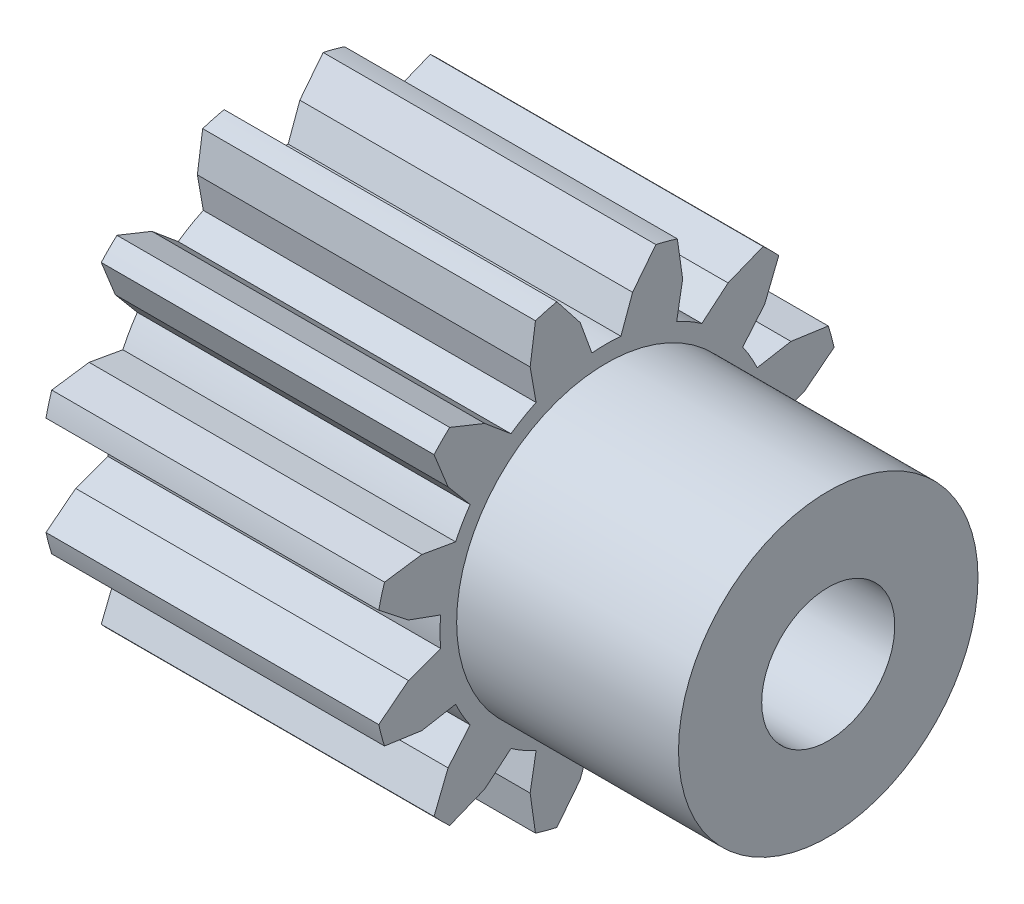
ISO-10303-21;
HEADER;
FILE_DESCRIPTION(('STEP AP214'),'2;1');
FILE_NAME('part.step','',(''),(''),'','','');
FILE_SCHEMA(('AUTOMOTIVE_DESIGN { 1 0 10303 214 1 1 1 1 }'));
ENDSEC;
DATA;
#1=APPLICATION_CONTEXT('core data for automotive mechanical design processes');
#2=APPLICATION_PROTOCOL_DEFINITION('international standard','automotive_design',2000,#1);
#3=PRODUCT_CONTEXT('',#1,'mechanical');
#4=PRODUCT('Part','Part','',(#3));
#5=PRODUCT_RELATED_PRODUCT_CATEGORY('part','',(#4));
#6=PRODUCT_DEFINITION_FORMATION('','',#4);
#7=PRODUCT_DEFINITION_CONTEXT('part definition',#1,'design');
#8=PRODUCT_DEFINITION('design','',#6,#7);
#9=PRODUCT_DEFINITION_SHAPE('','',#8);
#10=(LENGTH_UNIT() NAMED_UNIT(*) SI_UNIT(.MILLI.,.METRE.));
#11=(NAMED_UNIT(*) PLANE_ANGLE_UNIT() SI_UNIT($,.RADIAN.));
#12=(NAMED_UNIT(*) SI_UNIT($,.STERADIAN.) SOLID_ANGLE_UNIT());
#13=UNCERTAINTY_MEASURE_WITH_UNIT(LENGTH_MEASURE(1.E-05),#10,'distance_accuracy_value','');
#14=(GEOMETRIC_REPRESENTATION_CONTEXT(3) GLOBAL_UNCERTAINTY_ASSIGNED_CONTEXT((#13)) GLOBAL_UNIT_ASSIGNED_CONTEXT((#10,
#11,#12)) REPRESENTATION_CONTEXT('',''));
#15=CARTESIAN_POINT('',(0.,0.,0.));
#16=DIRECTION('',(0.,0.,1.));
#17=DIRECTION('',(1.,0.,0.));
#18=AXIS2_PLACEMENT_3D('',#15,#16,#17);
#19=CARTESIAN_POINT('',(-15.,-20.7664931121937,-20.5202501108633));
#20=DIRECTION('',(-1.,0.,0.));
#21=DIRECTION('',(0.,0.,1.));
#22=AXIS2_PLACEMENT_3D('',#19,#20,#21);
#23=PLANE('',#22);
#24=CARTESIAN_POINT('',(-15.,0.,0.));
#25=DIRECTION('',(-1.,0.,0.));
#26=DIRECTION('',(0.,0.,1.));
#27=AXIS2_PLACEMENT_3D('',#24,#25,#26);
#28=CIRCLE('',#27,6.);
#29=CARTESIAN_POINT('',(-15.,0.,6.));
#30=VERTEX_POINT('',#29);
#31=EDGE_CURVE('E18',#30,#30,#28,.T.);
#32=ORIENTED_EDGE('',*,*,#31,.F.);
#33=EDGE_LOOP('',(#32));
#34=FACE_BOUND('',#33,.T.);
#35=CARTESIAN_POINT('',(-15.,-2.29850860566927E-13,4.10262102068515E-13));
#36=DIRECTION('',(-1.,0.,0.));
#37=DIRECTION('',(0.,-1.,0.));
#38=AXIS2_PLACEMENT_3D('',#35,#36,#37);
#39=CIRCLE('',#38,14.9999999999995);
#40=CARTESIAN_POINT('',(-15.,-6.33927392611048,13.5946168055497));
#41=VERTEX_POINT('',#40);
#42=CARTESIAN_POINT('',(-15.,-8.60364654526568,12.2872806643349));
#43=VERTEX_POINT('',#42);
#44=EDGE_CURVE('E982',#41,#43,#39,.F.);
#45=ORIENTED_EDGE('',*,*,#44,.F.);
#46=DIRECTION('',(0.,0.173648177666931,-0.984807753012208));
#47=VECTOR('',#46,1.);
#48=CARTESIAN_POINT('',(-15.,-6.60733950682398,15.1148922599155));
#49=LINE('',#48,#47);
#50=CARTESIAN_POINT('',(-15.,-6.87540508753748,16.6351677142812));
#51=VERTEX_POINT('',#50);
#52=EDGE_CURVE('E785',#51,#41,#49,.T.);
#53=ORIENTED_EDGE('',*,*,#52,.F.);
#54=DIRECTION('',(0.,-0.141243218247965,-0.989974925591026));
#55=VECTOR('',#54,1.);
#56=CARTESIAN_POINT('',(-15.,-6.63518250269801,18.3188898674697));
#57=LINE('',#56,#55);
#58=CARTESIAN_POINT('',(-15.,-6.39495991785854,20.0026120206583));
#59=VERTEX_POINT('',#58);
#60=EDGE_CURVE('E467',#59,#51,#57,.T.);
#61=ORIENTED_EDGE('',*,*,#60,.F.);
#62=CARTESIAN_POINT('',(-15.,-5.19983361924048E-13,7.99707522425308E-13));
#63=DIRECTION('',(-1.,0.,0.));
#64=DIRECTION('',(0.,-1.,0.));
#65=AXIS2_PLACEMENT_3D('',#62,#63,#64);
#66=CIRCLE('',#65,20.9999999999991);
#67=CARTESIAN_POINT('',(-15.,-4.46310826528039,20.5202501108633));
#68=VERTEX_POINT('',#67);
#69=EDGE_CURVE('E462',#68,#59,#66,.F.);
#70=ORIENTED_EDGE('',*,*,#69,.F.);
#71=DIRECTION('',(0.,-0.617307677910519,0.786721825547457));
#72=VECTOR('',#71,1.);
#73=CARTESIAN_POINT('',(-15.,-3.41320832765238,19.1822152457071));
#74=LINE('',#73,#72);
#75=CARTESIAN_POINT('',(-15.,-2.36330839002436,17.844180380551));
#76=VERTEX_POINT('',#75);
#77=EDGE_CURVE('E465',#76,#68,#74,.T.);
#78=ORIENTED_EDGE('',*,*,#77,.F.);
#79=DIRECTION('',(0.,-0.34202014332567,0.939692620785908));
#80=VECTOR('',#79,1.);
#81=CARTESIAN_POINT('',(-15.,-1.83532226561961,16.3935504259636));
#82=LINE('',#81,#80);
#83=CARTESIAN_POINT('',(-15.,-1.30733614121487,14.9429204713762));
#84=VERTEX_POINT('',#83);
#85=EDGE_CURVE('E482',#84,#76,#82,.T.);
#86=ORIENTED_EDGE('',*,*,#85,.F.);
#87=CARTESIAN_POINT('',(-15.,0.,-3.59955121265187E-13));
#88=DIRECTION('',(-1.,0.,0.));
#89=DIRECTION('',(0.,-1.,0.));
#90=AXIS2_PLACEMENT_3D('',#87,#88,#89);
#91=CIRCLE('',#90,15.0000000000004);
#92=CARTESIAN_POINT('',(-15.,1.30733614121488,14.9429204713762));
#93=VERTEX_POINT('',#92);
#94=EDGE_CURVE('E916',#93,#84,#91,.F.);
#95=ORIENTED_EDGE('',*,*,#94,.F.);
#96=DIRECTION('',(0.,-0.342020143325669,-0.939692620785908));
#97=VECTOR('',#96,1.);
#98=CARTESIAN_POINT('',(-15.,1.83532226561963,16.3935504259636));
#99=LINE('',#98,#97);
#100=CARTESIAN_POINT('',(-15.,2.36330839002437,17.844180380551));
#101=VERTEX_POINT('',#100);
#102=EDGE_CURVE('E499',#101,#93,#99,.T.);
#103=ORIENTED_EDGE('',*,*,#102,.F.);
#104=DIRECTION('',(0.,-0.617307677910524,-0.786721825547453));
#105=VECTOR('',#104,1.);
#106=CARTESIAN_POINT('',(-15.,3.41320832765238,19.1822152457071));
#107=LINE('',#106,#105);
#108=CARTESIAN_POINT('',(-15.,4.4631082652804,20.5202501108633));
#109=VERTEX_POINT('',#108);
#110=EDGE_CURVE('E506',#109,#101,#107,.T.);
#111=ORIENTED_EDGE('',*,*,#110,.F.);
#112=CARTESIAN_POINT('',(-15.,1.40078920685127E-13,-3.19189119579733E-13));
#113=DIRECTION('',(-1.,0.,0.));
#114=DIRECTION('',(0.,-1.,0.));
#115=AXIS2_PLACEMENT_3D('',#112,#113,#114);
#116=CIRCLE('',#115,21.0000000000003);
#117=CARTESIAN_POINT('',(-15.,6.39495991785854,20.0026120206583));
#118=VERTEX_POINT('',#117);
#119=EDGE_CURVE('E919',#118,#109,#116,.F.);
#120=ORIENTED_EDGE('',*,*,#119,.F.);
#121=DIRECTION('',(0.,-0.141243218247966,0.989974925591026));
#122=VECTOR('',#121,1.);
#123=CARTESIAN_POINT('',(-15.,6.63518250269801,18.3188898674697));
#124=LINE('',#123,#122);
#125=CARTESIAN_POINT('',(-15.,6.87540508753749,16.6351677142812));
#126=VERTEX_POINT('',#125);
#127=EDGE_CURVE('E512',#126,#118,#124,.T.);
#128=ORIENTED_EDGE('',*,*,#127,.F.);
#129=DIRECTION('',(0.,0.17364817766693,0.984807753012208));
#130=VECTOR('',#129,1.);
#131=CARTESIAN_POINT('',(-15.,6.60733950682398,15.1148922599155));
#132=LINE('',#131,#130);
#133=CARTESIAN_POINT('',(-15.,6.33927392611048,13.5946168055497));
#134=VERTEX_POINT('',#133);
#135=EDGE_CURVE('E519',#134,#126,#132,.T.);
#136=ORIENTED_EDGE('',*,*,#135,.F.);
#137=CARTESIAN_POINT('',(-15.,2.80157841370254E-13,2.69749500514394E-13));
#138=DIRECTION('',(-1.,0.,0.));
#139=DIRECTION('',(0.,-1.,0.));
#140=AXIS2_PLACEMENT_3D('',#137,#138,#139);
#141=CIRCLE('',#140,14.9999999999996);
#142=CARTESIAN_POINT('',(-15.,8.60364654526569,12.2872806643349));
#143=VERTEX_POINT('',#142);
#144=EDGE_CURVE('E922',#143,#134,#141,.F.);
#145=ORIENTED_EDGE('',*,*,#144,.F.);
#146=DIRECTION('',(0.,-0.766044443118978,-0.64278760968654));
#147=VECTOR('',#146,1.);
#148=CARTESIAN_POINT('',(-15.,9.78621091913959,13.2795699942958));
#149=LINE('',#148,#147);
#150=CARTESIAN_POINT('',(-15.,10.9687752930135,14.2718593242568));
#151=VERTEX_POINT('',#150);
#152=EDGE_CURVE('E525',#151,#143,#149,.T.);
#153=ORIENTED_EDGE('',*,*,#152,.F.);
#154=DIRECTION('',(0.,-0.927965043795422,-0.372667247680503));
#155=VECTOR('',#154,1.);
#156=CARTESIAN_POINT('',(-15.,12.5470327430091,14.9056815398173));
#157=LINE('',#156,#155);
#158=CARTESIAN_POINT('',(-15.,14.1252901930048,15.5395037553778));
#159=VERTEX_POINT('',#158);
#160=EDGE_CURVE('E532',#159,#151,#157,.T.);
#161=ORIENTED_EDGE('',*,*,#160,.F.);
#162=CARTESIAN_POINT('',(-15.,1.39645239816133E-13,-2.09901540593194E-13));
#163=DIRECTION('',(-1.,0.,0.));
#164=DIRECTION('',(0.,0.,1.));
#165=AXIS2_PLACEMENT_3D('',#162,#163,#164);
#166=CIRCLE('',#165,21.);
#167=CARTESIAN_POINT('',(-15.,15.5395037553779,14.1252901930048));
#168=VERTEX_POINT('',#167);
#169=EDGE_CURVE('E925',#168,#159,#166,.F.);
#170=ORIENTED_EDGE('',*,*,#169,.F.);
#171=DIRECTION('',(0.,0.372667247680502,0.927965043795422));
#172=VECTOR('',#171,1.);
#173=CARTESIAN_POINT('',(-15.,14.9056815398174,12.5470327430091));
#174=LINE('',#173,#172);
#175=CARTESIAN_POINT('',(-15.,14.2718593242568,10.9687752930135));
#176=VERTEX_POINT('',#175);
#177=EDGE_CURVE('E538',#176,#168,#174,.T.);
#178=ORIENTED_EDGE('',*,*,#177,.F.);
#179=DIRECTION('',(0.,0.642787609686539,0.766044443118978));
#180=VECTOR('',#179,1.);
#181=CARTESIAN_POINT('',(-15.,13.2795699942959,9.7862109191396));
#182=LINE('',#181,#180);
#183=CARTESIAN_POINT('',(-15.,12.2872806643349,8.6036465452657));
#184=VERTEX_POINT('',#183);
#185=EDGE_CURVE('E545',#184,#176,#182,.T.);
#186=ORIENTED_EDGE('',*,*,#185,.F.);
#187=CARTESIAN_POINT('',(-15.,-5.10008701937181E-13,-1.99926880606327E-13));
#188=DIRECTION('',(-1.,0.,0.));
#189=DIRECTION('',(0.,0.,1.));
#190=AXIS2_PLACEMENT_3D('',#187,#188,#189);
#191=CIRCLE('',#190,15.0000000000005);
#192=CARTESIAN_POINT('',(-15.,13.5946168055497,6.33927392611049));
#193=VERTEX_POINT('',#192);
#194=EDGE_CURVE('E928',#193,#184,#191,.F.);
#195=ORIENTED_EDGE('',*,*,#194,.F.);
#196=DIRECTION('',(0.,-0.984807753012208,-0.173648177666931));
#197=VECTOR('',#196,1.);
#198=CARTESIAN_POINT('',(-15.,15.1148922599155,6.60733950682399));
#199=LINE('',#198,#197);
#200=CARTESIAN_POINT('',(-15.,16.6351677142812,6.87540508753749));
#201=VERTEX_POINT('',#200);
#202=EDGE_CURVE('E551',#201,#193,#199,.T.);
#203=ORIENTED_EDGE('',*,*,#202,.F.);
#204=DIRECTION('',(0.,-0.989974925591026,0.141243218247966));
#205=VECTOR('',#204,1.);
#206=CARTESIAN_POINT('',(-15.,18.3188898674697,6.63518250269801));
#207=LINE('',#206,#205);
#208=CARTESIAN_POINT('',(-15.,20.0026120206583,6.39495991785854));
#209=VERTEX_POINT('',#208);
#210=EDGE_CURVE('E558',#209,#201,#207,.T.);
#211=ORIENTED_EDGE('',*,*,#210,.F.);
#212=CARTESIAN_POINT('',(-15.,2.69055611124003E-12,8.40039843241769E-13));
#213=DIRECTION('',(-1.,0.,0.));
#214=DIRECTION('',(0.,0.,1.));
#215=AXIS2_PLACEMENT_3D('',#212,#213,#214);
#216=CIRCLE('',#215,20.9999999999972);
#217=CARTESIAN_POINT('',(-15.,20.5202501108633,4.4631082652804));
#218=VERTEX_POINT('',#217);
#219=EDGE_CURVE('E931',#218,#209,#216,.F.);
#220=ORIENTED_EDGE('',*,*,#219,.F.);
#221=DIRECTION('',(0.,0.786721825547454,0.617307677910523));
#222=VECTOR('',#221,1.);
#223=CARTESIAN_POINT('',(-15.,19.1822152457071,3.41320832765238));
#224=LINE('',#223,#222);
#225=CARTESIAN_POINT('',(-15.,17.844180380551,2.36330839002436));
#226=VERTEX_POINT('',#225);
#227=EDGE_CURVE('E564',#226,#218,#224,.T.);
#228=ORIENTED_EDGE('',*,*,#227,.F.);
#229=DIRECTION('',(0.,0.939692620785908,0.34202014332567));
#230=VECTOR('',#229,1.);
#231=CARTESIAN_POINT('',(-15.,16.3935504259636,1.83532226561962));
#232=LINE('',#231,#230);
#233=CARTESIAN_POINT('',(-15.,14.9429204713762,1.30733614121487));
#234=VERTEX_POINT('',#233);
#235=EDGE_CURVE('E571',#234,#226,#232,.T.);
#236=ORIENTED_EDGE('',*,*,#235,.F.);
#237=CARTESIAN_POINT('',(-15.,-3.40005801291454E-13,-1.20021180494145E-13));
#238=DIRECTION('',(-1.,0.,0.));
#239=DIRECTION('',(0.,0.,1.));
#240=AXIS2_PLACEMENT_3D('',#237,#238,#239);
#241=CIRCLE('',#240,15.0000000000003);
#242=CARTESIAN_POINT('',(-15.,14.9429204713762,-1.30733614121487));
#243=VERTEX_POINT('',#242);
#244=EDGE_CURVE('E934',#243,#234,#241,.F.);
#245=ORIENTED_EDGE('',*,*,#244,.F.);
#246=DIRECTION('',(0.,-0.939692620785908,0.34202014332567));
#247=VECTOR('',#246,1.);
#248=CARTESIAN_POINT('',(-15.,16.3935504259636,-1.83532226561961));
#249=LINE('',#248,#247);
#250=CARTESIAN_POINT('',(-15.,17.844180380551,-2.36330839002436));
#251=VERTEX_POINT('',#250);
#252=EDGE_CURVE('E577',#251,#243,#249,.T.);
#253=ORIENTED_EDGE('',*,*,#252,.F.);
#254=DIRECTION('',(0.,-0.786721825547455,0.617307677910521));
#255=VECTOR('',#254,1.);
#256=CARTESIAN_POINT('',(-15.,19.1822152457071,-3.41320832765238));
#257=LINE('',#256,#255);
#258=CARTESIAN_POINT('',(-15.,20.5202501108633,-4.4631082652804));
#259=VERTEX_POINT('',#258);
#260=EDGE_CURVE('E584',#259,#251,#257,.T.);
#261=ORIENTED_EDGE('',*,*,#260,.F.);
#262=CARTESIAN_POINT('',(-15.,1.00613961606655E-13,0.));
#263=DIRECTION('',(-1.,0.,0.));
#264=DIRECTION('',(0.,0.,1.));
#265=AXIS2_PLACEMENT_3D('',#262,#263,#264);
#266=CIRCLE('',#265,20.9999999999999);
#267=CARTESIAN_POINT('',(-15.,20.0026120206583,-6.39495991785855));
#268=VERTEX_POINT('',#267);
#269=EDGE_CURVE('E937',#268,#259,#266,.F.);
#270=ORIENTED_EDGE('',*,*,#269,.F.);
#271=DIRECTION('',(0.,0.989974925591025,0.141243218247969));
#272=VECTOR('',#271,1.);
#273=CARTESIAN_POINT('',(-15.,18.3188898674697,-6.63518250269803));
#274=LINE('',#273,#272);
#275=CARTESIAN_POINT('',(-15.,16.6351677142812,-6.87540508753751));
#276=VERTEX_POINT('',#275);
#277=EDGE_CURVE('E590',#276,#268,#274,.T.);
#278=ORIENTED_EDGE('',*,*,#277,.F.);
#279=DIRECTION('',(0.,0.984807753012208,-0.173648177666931));
#280=VECTOR('',#279,1.);
#281=CARTESIAN_POINT('',(-15.,15.1148922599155,-6.60733950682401));
#282=LINE('',#281,#280);
#283=CARTESIAN_POINT('',(-15.,13.5946168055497,-6.33927392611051));
#284=VERTEX_POINT('',#283);
#285=EDGE_CURVE('E597',#284,#276,#282,.T.);
#286=ORIENTED_EDGE('',*,*,#285,.F.);
#287=CARTESIAN_POINT('',(-15.,9.00321484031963E-13,-4.90059381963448E-13));
#288=DIRECTION('',(-1.,0.,0.));
#289=DIRECTION('',(0.,0.,1.));
#290=AXIS2_PLACEMENT_3D('',#287,#288,#289);
#291=CIRCLE('',#290,14.999999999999);
#292=CARTESIAN_POINT('',(-15.,12.2872806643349,-8.6036465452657));
#293=VERTEX_POINT('',#292);
#294=EDGE_CURVE('E940',#293,#284,#291,.F.);
#295=ORIENTED_EDGE('',*,*,#294,.F.);
#296=DIRECTION('',(0.,-0.642787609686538,0.766044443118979));
#297=VECTOR('',#296,1.);
#298=CARTESIAN_POINT('',(-15.,13.2795699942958,-9.7862109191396));
#299=LINE('',#298,#297);
#300=CARTESIAN_POINT('',(-15.,14.2718593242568,-10.9687752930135));
#301=VERTEX_POINT('',#300);
#302=EDGE_CURVE('E603',#301,#293,#299,.T.);
#303=ORIENTED_EDGE('',*,*,#302,.F.);
#304=DIRECTION('',(0.,-0.372667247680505,0.927965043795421));
#305=VECTOR('',#304,1.);
#306=CARTESIAN_POINT('',(-15.,14.9056815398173,-12.5470327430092));
#307=LINE('',#306,#305);
#308=CARTESIAN_POINT('',(-15.,15.5395037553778,-14.1252901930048));
#309=VERTEX_POINT('',#308);
#310=EDGE_CURVE('E610',#309,#301,#307,.T.);
#311=ORIENTED_EDGE('',*,*,#310,.F.);
#312=CARTESIAN_POINT('',(-15.,-1.7798262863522E-12,1.41987116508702E-12));
#313=DIRECTION('',(-1.,0.,0.));
#314=DIRECTION('',(0.,-1.,0.));
#315=AXIS2_PLACEMENT_3D('',#312,#313,#314);
#316=CIRCLE('',#315,21.0000000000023);
#317=CARTESIAN_POINT('',(-15.,14.1252901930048,-15.5395037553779));
#318=VERTEX_POINT('',#317);
#319=EDGE_CURVE('E943',#318,#309,#316,.F.);
#320=ORIENTED_EDGE('',*,*,#319,.F.);
#321=DIRECTION('',(0.,0.927965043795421,-0.372667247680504));
#322=VECTOR('',#321,1.);
#323=CARTESIAN_POINT('',(-15.,12.5470327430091,-14.9056815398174));
#324=LINE('',#323,#322);
#325=CARTESIAN_POINT('',(-15.,10.9687752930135,-14.2718593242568));
#326=VERTEX_POINT('',#325);
#327=EDGE_CURVE('E616',#326,#318,#324,.T.);
#328=ORIENTED_EDGE('',*,*,#327,.F.);
#329=DIRECTION('',(0.,0.766044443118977,-0.64278760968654));
#330=VECTOR('',#329,1.);
#331=CARTESIAN_POINT('',(-15.,9.78621091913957,-13.2795699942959));
#332=LINE('',#331,#330);
#333=CARTESIAN_POINT('',(-15.,8.60364654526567,-12.2872806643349));
#334=VERTEX_POINT('',#333);
#335=EDGE_CURVE('E623',#334,#326,#332,.T.);
#336=ORIENTED_EDGE('',*,*,#335,.F.);
#337=CARTESIAN_POINT('',(-15.,-1.00180280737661E-13,0.));
#338=DIRECTION('',(-1.,0.,0.));
#339=DIRECTION('',(0.,-1.,0.));
#340=AXIS2_PLACEMENT_3D('',#337,#338,#339);
#341=CIRCLE('',#340,15.);
#342=CARTESIAN_POINT('',(-15.,6.33927392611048,-13.5946168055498));
#343=VERTEX_POINT('',#342);
#344=EDGE_CURVE('E946',#343,#334,#341,.F.);
#345=ORIENTED_EDGE('',*,*,#344,.F.);
#346=DIRECTION('',(0.,-0.173648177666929,0.984807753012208));
#347=VECTOR('',#346,1.);
#348=CARTESIAN_POINT('',(-15.,6.60733950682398,-15.1148922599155));
#349=LINE('',#348,#347);
#350=CARTESIAN_POINT('',(-15.,6.87540508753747,-16.6351677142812));
#351=VERTEX_POINT('',#350);
#352=EDGE_CURVE('E629',#351,#343,#349,.T.);
#353=ORIENTED_EDGE('',*,*,#352,.F.);
#354=DIRECTION('',(0.,0.141243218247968,0.989974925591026));
#355=VECTOR('',#354,1.);
#356=CARTESIAN_POINT('',(-15.,6.635182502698,-18.3188898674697));
#357=LINE('',#356,#355);
#358=CARTESIAN_POINT('',(-15.,6.39495991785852,-20.0026120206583));
#359=VERTEX_POINT('',#358);
#360=EDGE_CURVE('E636',#359,#351,#357,.T.);
#361=ORIENTED_EDGE('',*,*,#360,.F.);
#362=CARTESIAN_POINT('',(-15.,4.80084721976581E-13,-1.12063136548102E-12));
#363=DIRECTION('',(-1.,0.,0.));
#364=DIRECTION('',(0.,-1.,0.));
#365=AXIS2_PLACEMENT_3D('',#362,#363,#364);
#366=CIRCLE('',#365,20.9999999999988);
#367=CARTESIAN_POINT('',(-15.,4.46310826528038,-20.5202501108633));
#368=VERTEX_POINT('',#367);
#369=EDGE_CURVE('E949',#368,#359,#366,.F.);
#370=ORIENTED_EDGE('',*,*,#369,.F.);
#371=DIRECTION('',(0.,0.617307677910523,-0.786721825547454));
#372=VECTOR('',#371,1.);
#373=CARTESIAN_POINT('',(-15.,3.41320832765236,-19.1822152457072));
#374=LINE('',#373,#372);
#375=CARTESIAN_POINT('',(-15.,2.36330839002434,-17.844180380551));
#376=VERTEX_POINT('',#375);
#377=EDGE_CURVE('E642',#376,#368,#374,.T.);
#378=ORIENTED_EDGE('',*,*,#377,.F.);
#379=DIRECTION('',(0.,0.342020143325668,-0.939692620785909));
#380=VECTOR('',#379,1.);
#381=CARTESIAN_POINT('',(-15.,1.83532226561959,-16.3935504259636));
#382=LINE('',#381,#380);
#383=CARTESIAN_POINT('',(-15.,1.30733614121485,-14.9429204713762));
#384=VERTEX_POINT('',#383);
#385=EDGE_CURVE('E649',#384,#376,#382,.T.);
#386=ORIENTED_EDGE('',*,*,#385,.F.);
#387=CARTESIAN_POINT('',(-15.,0.,5.49907341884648E-13));
#388=DIRECTION('',(-1.,0.,0.));
#389=DIRECTION('',(0.,-1.,0.));
#390=AXIS2_PLACEMENT_3D('',#387,#388,#389);
#391=CIRCLE('',#390,15.0000000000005);
#392=CARTESIAN_POINT('',(-15.,-1.30733614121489,-14.9429204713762));
#393=VERTEX_POINT('',#392);
#394=EDGE_CURVE('E952',#393,#384,#391,.F.);
#395=ORIENTED_EDGE('',*,*,#394,.F.);
#396=DIRECTION('',(0.,0.34202014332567,0.939692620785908));
#397=VECTOR('',#396,1.);
#398=CARTESIAN_POINT('',(-15.,-1.83532226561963,-16.3935504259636));
#399=LINE('',#398,#397);
#400=CARTESIAN_POINT('',(-15.,-2.36330839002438,-17.844180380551));
#401=VERTEX_POINT('',#400);
#402=EDGE_CURVE('E655',#401,#393,#399,.T.);
#403=ORIENTED_EDGE('',*,*,#402,.F.);
#404=DIRECTION('',(0.,0.617307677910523,0.786721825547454));
#405=VECTOR('',#404,1.);
#406=CARTESIAN_POINT('',(-15.,-3.4132083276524,-19.1822152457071));
#407=LINE('',#406,#405);
#408=CARTESIAN_POINT('',(-15.,-4.46310826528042,-20.5202501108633));
#409=VERTEX_POINT('',#408);
#410=EDGE_CURVE('E662',#409,#401,#407,.T.);
#411=ORIENTED_EDGE('',*,*,#410,.F.);
#412=CARTESIAN_POINT('',(-15.,0.,2.20309881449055E-13));
#413=DIRECTION('',(-1.,0.,0.));
#414=DIRECTION('',(0.,-1.,0.));
#415=AXIS2_PLACEMENT_3D('',#412,#413,#414);
#416=CIRCLE('',#415,21.0000000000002);
#417=CARTESIAN_POINT('',(-15.,-6.39495991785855,-20.0026120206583));
#418=VERTEX_POINT('',#417);
#419=EDGE_CURVE('E955',#418,#409,#416,.F.);
#420=ORIENTED_EDGE('',*,*,#419,.F.);
#421=DIRECTION('',(0.,0.141243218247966,-0.989974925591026));
#422=VECTOR('',#421,1.);
#423=CARTESIAN_POINT('',(-15.,-6.63518250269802,-18.3188898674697));
#424=LINE('',#423,#422);
#425=CARTESIAN_POINT('',(-15.,-6.8754050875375,-16.6351677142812));
#426=VERTEX_POINT('',#425);
#427=EDGE_CURVE('E668',#426,#418,#424,.T.);
#428=ORIENTED_EDGE('',*,*,#427,.F.);
#429=DIRECTION('',(0.,-0.173648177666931,-0.984807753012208));
#430=VECTOR('',#429,1.);
#431=CARTESIAN_POINT('',(-15.,-6.60733950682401,-15.1148922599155));
#432=LINE('',#431,#430);
#433=CARTESIAN_POINT('',(-15.,-6.33927392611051,-13.5946168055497));
#434=VERTEX_POINT('',#433);
#435=EDGE_CURVE('E675',#434,#426,#432,.T.);
#436=ORIENTED_EDGE('',*,*,#435,.F.);
#437=CARTESIAN_POINT('',(-15.,-2.69749500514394E-13,-4.59701721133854E-13));
#438=DIRECTION('',(-1.,0.,0.));
#439=DIRECTION('',(0.,-1.,0.));
#440=AXIS2_PLACEMENT_3D('',#437,#438,#439);
#441=CIRCLE('',#440,14.9999999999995);
#442=CARTESIAN_POINT('',(-15.,-8.6036465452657,-12.2872806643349));
#443=VERTEX_POINT('',#442);
#444=EDGE_CURVE('E958',#443,#434,#441,.F.);
#445=ORIENTED_EDGE('',*,*,#444,.F.);
#446=DIRECTION('',(0.,0.766044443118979,0.642787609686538));
#447=VECTOR('',#446,1.);
#448=CARTESIAN_POINT('',(-15.,-9.7862109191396,-13.2795699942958));
#449=LINE('',#448,#447);
#450=CARTESIAN_POINT('',(-15.,-10.9687752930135,-14.2718593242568));
#451=VERTEX_POINT('',#450);
#452=EDGE_CURVE('E681',#451,#443,#449,.T.);
#453=ORIENTED_EDGE('',*,*,#452,.F.);
#454=DIRECTION('',(0.,0.927965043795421,0.372667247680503));
#455=VECTOR('',#454,1.);
#456=CARTESIAN_POINT('',(-15.,-12.5470327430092,-14.9056815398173));
#457=LINE('',#456,#455);
#458=CARTESIAN_POINT('',(-15.,-14.1252901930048,-15.5395037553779));
#459=VERTEX_POINT('',#458);
#460=EDGE_CURVE('E688',#459,#451,#457,.T.);
#461=ORIENTED_EDGE('',*,*,#460,.F.);
#462=CARTESIAN_POINT('',(-15.,3.02015357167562E-12,2.98025493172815E-12));
#463=DIRECTION('',(-1.,0.,0.));
#464=DIRECTION('',(0.,0.,1.));
#465=AXIS2_PLACEMENT_3D('',#462,#463,#464);
#466=CIRCLE('',#465,21.0000000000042);
#467=CARTESIAN_POINT('',(-15.,-15.5395037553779,-14.1252901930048));
#468=VERTEX_POINT('',#467);
#469=EDGE_CURVE('E961',#468,#459,#466,.F.);
#470=ORIENTED_EDGE('',*,*,#469,.F.);
#471=DIRECTION('',(0.,-0.372667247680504,-0.927965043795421));
#472=VECTOR('',#471,1.);
#473=CARTESIAN_POINT('',(-15.,-14.9056815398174,-12.5470327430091));
#474=LINE('',#473,#472);
#475=CARTESIAN_POINT('',(-15.,-14.2718593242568,-10.9687752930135));
#476=VERTEX_POINT('',#475);
#477=EDGE_CURVE('E694',#476,#468,#474,.T.);
#478=ORIENTED_EDGE('',*,*,#477,.F.);
#479=DIRECTION('',(0.,-0.642787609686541,-0.766044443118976));
#480=VECTOR('',#479,1.);
#481=CARTESIAN_POINT('',(-15.,-13.2795699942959,-9.78621091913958));
#482=LINE('',#481,#480);
#483=CARTESIAN_POINT('',(-15.,-12.2872806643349,-8.60364654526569));
#484=VERTEX_POINT('',#483);
#485=EDGE_CURVE('E701',#484,#476,#482,.T.);
#486=ORIENTED_EDGE('',*,*,#485,.F.);
#487=CARTESIAN_POINT('',(-15.,1.80411241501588E-13,0.));
#488=DIRECTION('',(-1.,0.,0.));
#489=DIRECTION('',(0.,0.,1.));
#490=AXIS2_PLACEMENT_3D('',#487,#488,#489);
#491=CIRCLE('',#490,15.0000000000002);
#492=CARTESIAN_POINT('',(-15.,-13.5946168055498,-6.33927392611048));
#493=VERTEX_POINT('',#492);
#494=EDGE_CURVE('E964',#493,#484,#491,.F.);
#495=ORIENTED_EDGE('',*,*,#494,.F.);
#496=DIRECTION('',(0.,0.984807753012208,0.173648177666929));
#497=VECTOR('',#496,1.);
#498=CARTESIAN_POINT('',(-15.,-15.1148922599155,-6.60733950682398));
#499=LINE('',#498,#497);
#500=CARTESIAN_POINT('',(-15.,-16.6351677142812,-6.87540508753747));
#501=VERTEX_POINT('',#500);
#502=EDGE_CURVE('E707',#501,#493,#499,.T.);
#503=ORIENTED_EDGE('',*,*,#502,.F.);
#504=DIRECTION('',(0.,0.989974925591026,-0.141243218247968));
#505=VECTOR('',#504,1.);
#506=CARTESIAN_POINT('',(-15.,-18.3188898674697,-6.635182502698));
#507=LINE('',#506,#505);
#508=CARTESIAN_POINT('',(-15.,-20.0026120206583,-6.39495991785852));
#509=VERTEX_POINT('',#508);
#510=EDGE_CURVE('E714',#509,#501,#507,.T.);
#511=ORIENTED_EDGE('',*,*,#510,.F.);
#512=CARTESIAN_POINT('',(-15.,2.99066327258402E-12,6.80011602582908E-13));
#513=DIRECTION('',(-1.,0.,0.));
#514=DIRECTION('',(0.,0.,1.));
#515=AXIS2_PLACEMENT_3D('',#512,#513,#514);
#516=CIRCLE('',#515,21.0000000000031);
#517=CARTESIAN_POINT('',(-15.,-20.5202501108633,-4.46310826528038));
#518=VERTEX_POINT('',#517);
#519=EDGE_CURVE('E967',#518,#509,#516,.F.);
#520=ORIENTED_EDGE('',*,*,#519,.F.);
#521=DIRECTION('',(0.,-0.786721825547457,-0.617307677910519));
#522=VECTOR('',#521,1.);
#523=CARTESIAN_POINT('',(-15.,-19.1822152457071,-3.41320832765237));
#524=LINE('',#523,#522);
#525=CARTESIAN_POINT('',(-15.,-17.844180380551,-2.36330839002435));
#526=VERTEX_POINT('',#525);
#527=EDGE_CURVE('E720',#526,#518,#524,.T.);
#528=ORIENTED_EDGE('',*,*,#527,.F.);
#529=DIRECTION('',(0.,-0.939692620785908,-0.342020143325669));
#530=VECTOR('',#529,1.);
#531=CARTESIAN_POINT('',(-15.,-16.3935504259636,-1.83532226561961));
#532=LINE('',#531,#530);
#533=CARTESIAN_POINT('',(-15.,-14.9429204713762,-1.30733614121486));
#534=VERTEX_POINT('',#533);
#535=EDGE_CURVE('E727',#534,#526,#532,.T.);
#536=ORIENTED_EDGE('',*,*,#535,.F.);
#537=CARTESIAN_POINT('',(-15.,-1.30104260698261E-13,0.));
#538=DIRECTION('',(-1.,0.,0.));
#539=DIRECTION('',(0.,0.,1.));
#540=AXIS2_PLACEMENT_3D('',#537,#538,#539);
#541=CIRCLE('',#540,14.9999999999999);
#542=CARTESIAN_POINT('',(-15.,-14.9429204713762,1.30733614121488));
#543=VERTEX_POINT('',#542);
#544=EDGE_CURVE('E970',#543,#534,#541,.F.);
#545=ORIENTED_EDGE('',*,*,#544,.F.);
#546=DIRECTION('',(0.,0.939692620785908,-0.342020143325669));
#547=VECTOR('',#546,1.);
#548=CARTESIAN_POINT('',(-15.,-16.3935504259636,1.83532226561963));
#549=LINE('',#548,#547);
#550=CARTESIAN_POINT('',(-15.,-17.844180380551,2.36330839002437));
#551=VERTEX_POINT('',#550);
#552=EDGE_CURVE('E733',#551,#543,#549,.T.);
#553=ORIENTED_EDGE('',*,*,#552,.F.);
#554=DIRECTION('',(0.,0.786721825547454,-0.617307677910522));
#555=VECTOR('',#554,1.);
#556=CARTESIAN_POINT('',(-15.,-19.1822152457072,3.41320832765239));
#557=LINE('',#556,#555);
#558=CARTESIAN_POINT('',(-15.,-20.5202501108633,4.46310826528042));
#559=VERTEX_POINT('',#558);
#560=EDGE_CURVE('E740',#559,#551,#557,.T.);
#561=ORIENTED_EDGE('',*,*,#560,.F.);
#562=CARTESIAN_POINT('',(-15.,-1.8995222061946E-12,0.));
#563=DIRECTION('',(-1.,0.,0.));
#564=DIRECTION('',(0.,0.,1.));
#565=AXIS2_PLACEMENT_3D('',#562,#563,#564);
#566=CIRCLE('',#565,20.9999999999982);
#567=CARTESIAN_POINT('',(-15.,-20.0026120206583,6.39495991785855));
#568=VERTEX_POINT('',#567);
#569=EDGE_CURVE('E973',#568,#559,#566,.F.);
#570=ORIENTED_EDGE('',*,*,#569,.F.);
#571=DIRECTION('',(0.,-0.989974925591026,-0.141243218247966));
#572=VECTOR('',#571,1.);
#573=CARTESIAN_POINT('',(-15.,-18.3188898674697,6.63518250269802));
#574=LINE('',#573,#572);
#575=CARTESIAN_POINT('',(-15.,-16.6351677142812,6.8754050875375));
#576=VERTEX_POINT('',#575);
#577=EDGE_CURVE('E746',#576,#568,#574,.T.);
#578=ORIENTED_EDGE('',*,*,#577,.F.);
#579=DIRECTION('',(0.,-0.984807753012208,0.173648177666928));
#580=VECTOR('',#579,1.);
#581=CARTESIAN_POINT('',(-15.,-15.1148922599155,6.60733950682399));
#582=LINE('',#581,#580);
#583=CARTESIAN_POINT('',(-15.,-13.5946168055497,6.3392739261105));
#584=VERTEX_POINT('',#583);
#585=EDGE_CURVE('E753',#584,#576,#582,.T.);
#586=ORIENTED_EDGE('',*,*,#585,.F.);
#587=CARTESIAN_POINT('',(-15.,1.39645239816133E-13,0.));
#588=DIRECTION('',(-1.,0.,0.));
#589=DIRECTION('',(0.,0.,1.));
#590=AXIS2_PLACEMENT_3D('',#587,#588,#589);
#591=CIRCLE('',#590,15.0000000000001);
#592=CARTESIAN_POINT('',(-15.,-12.2872806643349,8.6036465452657));
#593=VERTEX_POINT('',#592);
#594=EDGE_CURVE('E976',#593,#584,#591,.F.);
#595=ORIENTED_EDGE('',*,*,#594,.F.);
#596=DIRECTION('',(0.,0.642787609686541,-0.766044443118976));
#597=VECTOR('',#596,1.);
#598=CARTESIAN_POINT('',(-15.,-13.2795699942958,9.7862109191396));
#599=LINE('',#598,#597);
#600=CARTESIAN_POINT('',(-15.,-14.2718593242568,10.9687752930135));
#601=VERTEX_POINT('',#600);
#602=EDGE_CURVE('E759',#601,#593,#599,.T.);
#603=ORIENTED_EDGE('',*,*,#602,.F.);
#604=DIRECTION('',(0.,0.372667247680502,-0.927965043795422));
#605=VECTOR('',#604,1.);
#606=CARTESIAN_POINT('',(-15.,-14.9056815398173,12.5470327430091));
#607=LINE('',#606,#605);
#608=CARTESIAN_POINT('',(-15.,-15.5395037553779,14.1252901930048));
#609=VERTEX_POINT('',#608);
#610=EDGE_CURVE('E766',#609,#601,#607,.T.);
#611=ORIENTED_EDGE('',*,*,#610,.F.);
#612=CARTESIAN_POINT('',(-15.,-1.11022302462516E-12,1.11022302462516E-12));
#613=DIRECTION('',(-1.,0.,0.));
#614=DIRECTION('',(0.,-1.,0.));
#615=AXIS2_PLACEMENT_3D('',#612,#613,#614);
#616=CIRCLE('',#615,20.9999999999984);
#617=CARTESIAN_POINT('',(-15.,-14.1252901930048,15.5395037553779));
#618=VERTEX_POINT('',#617);
#619=EDGE_CURVE('E979',#618,#609,#616,.F.);
#620=ORIENTED_EDGE('',*,*,#619,.F.);
#621=DIRECTION('',(0.,-0.927965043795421,0.372667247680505));
#622=VECTOR('',#621,1.);
#623=CARTESIAN_POINT('',(-15.,-12.5470327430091,14.9056815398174));
#624=LINE('',#623,#622);
#625=CARTESIAN_POINT('',(-15.,-10.9687752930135,14.2718593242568));
#626=VERTEX_POINT('',#625);
#627=EDGE_CURVE('E772',#626,#618,#624,.T.);
#628=ORIENTED_EDGE('',*,*,#627,.F.);
#629=DIRECTION('',(0.,-0.766044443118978,0.64278760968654));
#630=VECTOR('',#629,1.);
#631=CARTESIAN_POINT('',(-15.,-9.78621091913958,13.2795699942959));
#632=LINE('',#631,#630);
#633=EDGE_CURVE('E779',#43,#626,#632,.T.);
#634=ORIENTED_EDGE('',*,*,#633,.F.);
#635=EDGE_LOOP('',(#45,#53,#61,#70,#78,#86,#95,#103,#111,#120,#128,#136,#145,#153,#161,#170,
#178,#186,#195,#203,#211,#220,#228,#236,#245,#253,#261,#270,#278,#286,#295,#303,#311,#320,#328,
#336,#345,#353,#361,#370,#378,#386,#395,#403,#411,#420,#428,#436,#445,#453,#461,#470,#478,#486,
#495,#503,#511,#520,#528,#536,#545,#553,#561,#570,#578,#586,#595,#603,#611,#620,#628,#634));
#636=FACE_BOUND('',#635,.T.);
#637=ADVANCED_FACE('F15',(#34,#636),#23,.T.);
#638=CARTESIAN_POINT('',(35.,0.,0.));
#639=DIRECTION('',(-1.,0.,0.));
#640=DIRECTION('',(0.,0.,1.));
#641=AXIS2_PLACEMENT_3D('',#638,#639,#640);
#642=CYLINDRICAL_SURFACE('',#641,6.);
#643=ORIENTED_EDGE('',*,*,#31,.T.);
#644=EDGE_LOOP('',(#643));
#645=FACE_BOUND('',#644,.T.);
#646=CARTESIAN_POINT('',(35.,0.,0.));
#647=DIRECTION('',(-1.,0.,0.));
#648=DIRECTION('',(0.,0.,1.));
#649=AXIS2_PLACEMENT_3D('',#646,#647,#648);
#650=CIRCLE('',#649,6.);
#651=CARTESIAN_POINT('',(35.,0.,6.));
#652=VERTEX_POINT('',#651);
#653=EDGE_CURVE('E496',#652,#652,#650,.T.);
#654=ORIENTED_EDGE('',*,*,#653,.F.);
#655=EDGE_LOOP('',(#654));
#656=FACE_BOUND('',#655,.T.);
#657=ADVANCED_FACE('F1878',(#645,#656),#642,.F.);
#658=CARTESIAN_POINT('',(-15.,-5.19983361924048E-13,7.99707522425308E-13));
#659=DIRECTION('',(-1.,0.,0.));
#660=DIRECTION('',(0.,-1.,0.));
#661=AXIS2_PLACEMENT_3D('',#658,#659,#660);
#662=CYLINDRICAL_SURFACE('',#661,20.9999999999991);
#663=CARTESIAN_POINT('',(15.,-5.21194142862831E-13,7.99444180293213E-13));
#664=DIRECTION('',(-1.,0.,0.));
#665=DIRECTION('',(0.,-1.,0.));
#666=AXIS2_PLACEMENT_3D('',#663,#664,#665);
#667=CIRCLE('',#666,20.9999999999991);
#668=CARTESIAN_POINT('',(15.,-4.46310826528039,20.5202501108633));
#669=VERTEX_POINT('',#668);
#670=CARTESIAN_POINT('',(15.,-6.39495991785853,20.0026120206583));
#671=VERTEX_POINT('',#670);
#672=EDGE_CURVE('E474',#669,#671,#667,.F.);
#673=ORIENTED_EDGE('',*,*,#672,.F.);
#674=DIRECTION('',(-1.,0.,0.));
#675=VECTOR('',#674,1.);
#676=CARTESIAN_POINT('',(15.,-4.46310826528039,20.5202501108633));
#677=LINE('',#676,#675);
#678=EDGE_CURVE('E471',#68,#669,#677,.F.);
#679=ORIENTED_EDGE('',*,*,#678,.F.);
#680=ORIENTED_EDGE('',*,*,#69,.T.);
#681=DIRECTION('',(-1.,0.,0.));
#682=VECTOR('',#681,1.);
#683=CARTESIAN_POINT('',(15.,-6.39495991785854,20.0026120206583));
#684=LINE('',#683,#682);
#685=EDGE_CURVE('E789',#671,#59,#684,.T.);
#686=ORIENTED_EDGE('',*,*,#685,.F.);
#687=EDGE_LOOP('',(#673,#679,#680,#686));
#688=FACE_BOUND('',#687,.T.);
#689=ADVANCED_FACE('F472',(#688),#662,.T.);
#690=CARTESIAN_POINT('',(15.,-6.87540508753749,16.6351677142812));
#691=DIRECTION('',(0.,-0.989974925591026,0.141243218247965));
#692=DIRECTION('',(0.,0.141243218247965,0.989974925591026));
#693=AXIS2_PLACEMENT_3D('',#690,#691,#692);
#694=PLANE('',#693);
#695=CARTESIAN_POINT('',(15.,-6.39495991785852,20.0026120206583));
#696=CARTESIAN_POINT('',(15.,-6.41497846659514,19.8623018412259));
#697=CARTESIAN_POINT('',(15.,-6.43499701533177,19.7219916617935));
#698=CARTESIAN_POINT('',(15.,-6.47503411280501,19.4413713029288));
#699=CARTESIAN_POINT('',(15.,-6.49505266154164,19.3010611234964));
#700=CARTESIAN_POINT('',(15.,-6.53508975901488,19.0204407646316));
#701=CARTESIAN_POINT('',(15.,-6.55510830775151,18.8801305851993));
#702=CARTESIAN_POINT('',(15.,-6.59514540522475,18.5995102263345));
#703=CARTESIAN_POINT('',(15.,-6.61516395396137,18.4592000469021));
#704=CARTESIAN_POINT('',(15.,-6.65520105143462,18.1785796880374));
#705=CARTESIAN_POINT('',(15.,-6.67521960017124,18.038269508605));
#706=CARTESIAN_POINT('',(15.,-6.71525669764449,17.7576491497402));
#707=CARTESIAN_POINT('',(15.,-6.73527524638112,17.6173389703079));
#708=CARTESIAN_POINT('',(15.,-6.77531234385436,17.3367186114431));
#709=CARTESIAN_POINT('',(15.,-6.79533089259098,17.1964084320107));
#710=CARTESIAN_POINT('',(15.,-6.83536799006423,16.915788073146));
#711=CARTESIAN_POINT('',(15.,-6.85538653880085,16.7754778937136));
#712=CARTESIAN_POINT('',(15.,-6.87540508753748,16.6351677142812));
#713=B_SPLINE_CURVE_WITH_KNOTS('',3,(#695,#696,#697,#698,#699,#700,#701,#702,#703,#704,#705,
#706,#707,#708,#709,#710,#711,#712),.UNSPECIFIED.,.F.,.F.,(4,2,2,2,2,2,2,2,4),(0.,
0.425193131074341,0.850386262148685,1.27557939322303,1.70077252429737,2.12596565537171,
2.55115878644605,2.9763519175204,3.40154504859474),.UNSPECIFIED.);
#714=CARTESIAN_POINT('',(15.,-6.87540508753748,16.6351677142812));
#715=VERTEX_POINT('',#714);
#716=EDGE_CURVE('E913',#671,#715,#713,.T.);
#717=ORIENTED_EDGE('',*,*,#716,.F.);
#718=ORIENTED_EDGE('',*,*,#685,.T.);
#719=ORIENTED_EDGE('',*,*,#60,.T.);
#720=DIRECTION('',(-1.,0.,0.));
#721=VECTOR('',#720,1.);
#722=CARTESIAN_POINT('',(15.,-6.87540508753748,16.6351677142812));
#723=LINE('',#722,#721);
#724=EDGE_CURVE('E788',#715,#51,#723,.T.);
#725=ORIENTED_EDGE('',*,*,#724,.F.);
#726=EDGE_LOOP('',(#717,#718,#719,#725));
#727=FACE_BOUND('',#726,.T.);
#728=ADVANCED_FACE('F1885',(#727),#694,.T.);
#729=CARTESIAN_POINT('',(15.,-6.33927392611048,13.5946168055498));
#730=DIRECTION('',(0.,-0.984807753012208,-0.173648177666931));
#731=DIRECTION('',(0.,-0.173648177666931,0.984807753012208));
#732=AXIS2_PLACEMENT_3D('',#729,#730,#731);
#733=PLANE('',#732);
#734=CARTESIAN_POINT('',(15.,-6.87540508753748,16.6351677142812));
#735=CARTESIAN_POINT('',(15.,-6.85306628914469,16.5084780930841));
#736=CARTESIAN_POINT('',(15.,-6.83072749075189,16.3817884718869));
#737=CARTESIAN_POINT('',(15.,-6.78604989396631,16.1284092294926));
#738=CARTESIAN_POINT('',(15.,-6.76371109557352,16.0017196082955));
#739=CARTESIAN_POINT('',(15.,-6.71903349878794,15.7483403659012));
#740=CARTESIAN_POINT('',(15.,-6.69669470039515,15.621650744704));
#741=CARTESIAN_POINT('',(15.,-6.65201710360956,15.3682715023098));
#742=CARTESIAN_POINT('',(15.,-6.62967830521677,15.2415818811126));
#743=CARTESIAN_POINT('',(15.,-6.58500070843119,14.9882026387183));
#744=CARTESIAN_POINT('',(15.,-6.56266191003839,14.8615130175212));
#745=CARTESIAN_POINT('',(15.,-6.51798431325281,14.6081337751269));
#746=CARTESIAN_POINT('',(15.,-6.49564551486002,14.4814441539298));
#747=CARTESIAN_POINT('',(15.,-6.45096791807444,14.2280649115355));
#748=CARTESIAN_POINT('',(15.,-6.42862911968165,14.1013752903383));
#749=CARTESIAN_POINT('',(15.,-6.38395152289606,13.847996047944));
#750=CARTESIAN_POINT('',(15.,-6.36161272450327,13.7213064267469));
#751=CARTESIAN_POINT('',(15.,-6.33927392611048,13.5946168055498));
#752=B_SPLINE_CURVE_WITH_KNOTS('',3,(#734,#735,#736,#737,#738,#739,#740,#741,#742,#743,#744,
#745,#746,#747,#748,#749,#750,#751),.UNSPECIFIED.,.F.,.F.,(4,2,2,2,2,2,2,2,4),(0.,
0.38593203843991,0.771864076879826,1.15779611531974,1.54372815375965,1.92966019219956,
2.31559223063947,2.70152426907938,3.0874563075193),.UNSPECIFIED.);
#753=CARTESIAN_POINT('',(15.,-6.33927392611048,13.5946168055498));
#754=VERTEX_POINT('',#753);
#755=EDGE_CURVE('E911',#715,#754,#752,.T.);
#756=ORIENTED_EDGE('',*,*,#755,.F.);
#757=ORIENTED_EDGE('',*,*,#724,.T.);
#758=ORIENTED_EDGE('',*,*,#52,.T.);
#759=DIRECTION('',(-1.,0.,0.));
#760=VECTOR('',#759,1.);
#761=CARTESIAN_POINT('',(0.,-6.33927392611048,13.5946168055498));
#762=LINE('',#761,#760);
#763=EDGE_CURVE('E782',#754,#41,#762,.T.);
#764=ORIENTED_EDGE('',*,*,#763,.F.);
#765=EDGE_LOOP('',(#756,#757,#758,#764));
#766=FACE_BOUND('',#765,.T.);
#767=ADVANCED_FACE('F1651',(#766),#733,.T.);
#768=CARTESIAN_POINT('',(-15.,-2.29850860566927E-13,4.10262102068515E-13));
#769=DIRECTION('',(-1.,0.,0.));
#770=DIRECTION('',(0.,-1.,0.));
#771=AXIS2_PLACEMENT_3D('',#768,#769,#770);
#772=CYLINDRICAL_SURFACE('',#771,14.9999999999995);
#773=CARTESIAN_POINT('',(15.,-2.3142305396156E-13,4.09528976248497E-13));
#774=DIRECTION('',(-1.,0.,0.));
#775=DIRECTION('',(0.,-1.,0.));
#776=AXIS2_PLACEMENT_3D('',#773,#774,#775);
#777=CIRCLE('',#776,14.9999999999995);
#778=CARTESIAN_POINT('',(15.,-8.60364654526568,12.2872806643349));
#779=VERTEX_POINT('',#778);
#780=EDGE_CURVE('E907',#754,#779,#777,.F.);
#781=ORIENTED_EDGE('',*,*,#780,.F.);
#782=ORIENTED_EDGE('',*,*,#763,.T.);
#783=ORIENTED_EDGE('',*,*,#44,.T.);
#784=DIRECTION('',(-1.,0.,0.));
#785=VECTOR('',#784,1.);
#786=CARTESIAN_POINT('',(15.,-8.60364654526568,12.2872806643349));
#787=LINE('',#786,#785);
#788=EDGE_CURVE('E776',#779,#43,#787,.T.);
#789=ORIENTED_EDGE('',*,*,#788,.F.);
#790=EDGE_LOOP('',(#781,#782,#783,#789));
#791=FACE_BOUND('',#790,.T.);
#792=ADVANCED_FACE('F1652',(#791),#772,.T.);
#793=CARTESIAN_POINT('',(15.,-10.9687752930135,14.2718593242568));
#794=DIRECTION('',(0.,0.64278760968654,0.766044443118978));
#795=DIRECTION('',(0.,0.766044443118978,-0.64278760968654));
#796=AXIS2_PLACEMENT_3D('',#793,#794,#795);
#797=PLANE('',#796);
#798=CARTESIAN_POINT('',(15.,-8.60364654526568,12.2872806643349));
#799=CARTESIAN_POINT('',(15.,-8.70219357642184,12.3699714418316));
#800=CARTESIAN_POINT('',(15.,-8.800740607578,12.4526622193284));
#801=CARTESIAN_POINT('',(15.,-8.99783466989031,12.6180437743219));
#802=CARTESIAN_POINT('',(15.,-9.09638170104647,12.7007345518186));
#803=CARTESIAN_POINT('',(15.,-9.29347576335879,12.8661161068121));
#804=CARTESIAN_POINT('',(15.,-9.39202279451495,12.9488068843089));
#805=CARTESIAN_POINT('',(15.,-9.58911685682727,13.1141884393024));
#806=CARTESIAN_POINT('',(15.,-9.68766388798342,13.1968792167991));
#807=CARTESIAN_POINT('',(15.,-9.88475795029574,13.3622607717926));
#808=CARTESIAN_POINT('',(15.,-9.9833049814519,13.4449515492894));
#809=CARTESIAN_POINT('',(15.,-10.1803990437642,13.6103331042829));
#810=CARTESIAN_POINT('',(15.,-10.2789460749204,13.6930238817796));
#811=CARTESIAN_POINT('',(15.,-10.4760401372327,13.8584054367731));
#812=CARTESIAN_POINT('',(15.,-10.5745871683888,13.9410962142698));
#813=CARTESIAN_POINT('',(15.,-10.7716812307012,14.1064777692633));
#814=CARTESIAN_POINT('',(15.,-10.8702282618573,14.1891685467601));
#815=CARTESIAN_POINT('',(15.,-10.9687752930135,14.2718593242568));
#816=B_SPLINE_CURVE_WITH_KNOTS('',3,(#798,#799,#800,#801,#802,#803,#804,#805,#806,#807,#808,
#809,#810,#811,#812,#813,#814,#815),.UNSPECIFIED.,.F.,.F.,(4,2,2,2,2,2,2,2,4),(0.,
0.385932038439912,0.771864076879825,1.15779611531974,1.54372815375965,1.92966019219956,
2.31559223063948,2.70152426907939,3.0874563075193),.UNSPECIFIED.);
#817=CARTESIAN_POINT('',(15.,-10.9687752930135,14.2718593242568));
#818=VERTEX_POINT('',#817);
#819=EDGE_CURVE('E910',#779,#818,#816,.T.);
#820=ORIENTED_EDGE('',*,*,#819,.F.);
#821=ORIENTED_EDGE('',*,*,#788,.T.);
#822=ORIENTED_EDGE('',*,*,#633,.T.);
#823=DIRECTION('',(-1.,0.,0.));
#824=VECTOR('',#823,1.);
#825=CARTESIAN_POINT('',(15.,-10.9687752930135,14.2718593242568));
#826=LINE('',#825,#824);
#827=EDGE_CURVE('E775',#818,#626,#826,.T.);
#828=ORIENTED_EDGE('',*,*,#827,.F.);
#829=EDGE_LOOP('',(#820,#821,#822,#828));
#830=FACE_BOUND('',#829,.T.);
#831=ADVANCED_FACE('F1655',(#830),#797,.T.);
#832=CARTESIAN_POINT('',(15.,-14.1252901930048,15.5395037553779));
#833=DIRECTION('',(0.,0.372667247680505,0.927965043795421));
#834=DIRECTION('',(0.,0.927965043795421,-0.372667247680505));
#835=AXIS2_PLACEMENT_3D('',#832,#833,#834);
#836=PLANE('',#835);
#837=CARTESIAN_POINT('',(15.,-10.9687752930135,14.2718593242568));
#838=CARTESIAN_POINT('',(15.,-11.1002967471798,14.3246778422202));
#839=CARTESIAN_POINT('',(15.,-11.2318182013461,14.3774963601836));
#840=CARTESIAN_POINT('',(15.,-11.4948611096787,14.4831333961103));
#841=CARTESIAN_POINT('',(15.,-11.626382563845,14.5359519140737));
#842=CARTESIAN_POINT('',(15.,-11.8894254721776,14.6415889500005));
#843=CARTESIAN_POINT('',(15.,-12.0209469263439,14.6944074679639));
#844=CARTESIAN_POINT('',(15.,-12.2839898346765,14.8000445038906));
#845=CARTESIAN_POINT('',(15.,-12.4155112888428,14.852863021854));
#846=CARTESIAN_POINT('',(15.,-12.6785541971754,14.9585000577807));
#847=CARTESIAN_POINT('',(15.,-12.8100756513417,15.0113185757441));
#848=CARTESIAN_POINT('',(15.,-13.0731185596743,15.1169556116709));
#849=CARTESIAN_POINT('',(15.,-13.2046400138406,15.1697741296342));
#850=CARTESIAN_POINT('',(15.,-13.4676829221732,15.275411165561));
#851=CARTESIAN_POINT('',(15.,-13.5992043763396,15.3282296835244));
#852=CARTESIAN_POINT('',(15.,-13.8622472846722,15.4338667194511));
#853=CARTESIAN_POINT('',(15.,-13.9937687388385,15.4866852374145));
#854=CARTESIAN_POINT('',(15.,-14.1252901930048,15.5395037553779));
#855=B_SPLINE_CURVE_WITH_KNOTS('',3,(#837,#838,#839,#840,#841,#842,#843,#844,#845,#846,#847,
#848,#849,#850,#851,#852,#853,#854),.UNSPECIFIED.,.F.,.F.,(4,2,2,2,2,2,2,2,4),(0.,
0.425193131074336,0.850386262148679,1.27557939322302,1.70077252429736,2.1259656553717,
2.55115878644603,2.97635191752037,3.40154504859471),.UNSPECIFIED.);
#856=CARTESIAN_POINT('',(15.,-14.1252901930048,15.5395037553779));
#857=VERTEX_POINT('',#856);
#858=EDGE_CURVE('E906',#818,#857,#855,.T.);
#859=ORIENTED_EDGE('',*,*,#858,.F.);
#860=ORIENTED_EDGE('',*,*,#827,.T.);
#861=ORIENTED_EDGE('',*,*,#627,.T.);
#862=DIRECTION('',(-1.,0.,0.));
#863=VECTOR('',#862,1.);
#864=CARTESIAN_POINT('',(0.,-14.1252901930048,15.5395037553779));
#865=LINE('',#864,#863);
#866=EDGE_CURVE('E769',#857,#618,#865,.T.);
#867=ORIENTED_EDGE('',*,*,#866,.F.);
#868=EDGE_LOOP('',(#859,#860,#861,#867));
#869=FACE_BOUND('',#868,.T.);
#870=ADVANCED_FACE('F1659',(#869),#836,.T.);
#871=CARTESIAN_POINT('',(-15.,-1.11022302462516E-12,1.11022302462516E-12));
#872=DIRECTION('',(-1.,0.,0.));
#873=DIRECTION('',(0.,-1.,0.));
#874=AXIS2_PLACEMENT_3D('',#871,#872,#873);
#875=CYLINDRICAL_SURFACE('',#874,20.9999999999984);
#876=CARTESIAN_POINT('',(15.,-1.11113992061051E-12,1.10938957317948E-12));
#877=DIRECTION('',(-1.,0.,0.));
#878=DIRECTION('',(0.,-1.,0.));
#879=AXIS2_PLACEMENT_3D('',#876,#877,#878);
#880=CIRCLE('',#879,20.9999999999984);
#881=CARTESIAN_POINT('',(15.,-15.5395037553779,14.1252901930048));
#882=VERTEX_POINT('',#881);
#883=EDGE_CURVE('E902',#857,#882,#880,.F.);
#884=ORIENTED_EDGE('',*,*,#883,.F.);
#885=ORIENTED_EDGE('',*,*,#866,.T.);
#886=ORIENTED_EDGE('',*,*,#619,.T.);
#887=DIRECTION('',(-1.,0.,0.));
#888=VECTOR('',#887,1.);
#889=CARTESIAN_POINT('',(15.,-15.5395037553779,14.1252901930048));
#890=LINE('',#889,#888);
#891=EDGE_CURVE('E763',#882,#609,#890,.T.);
#892=ORIENTED_EDGE('',*,*,#891,.F.);
#893=EDGE_LOOP('',(#884,#885,#886,#892));
#894=FACE_BOUND('',#893,.T.);
#895=ADVANCED_FACE('F1661',(#894),#875,.T.);
#896=CARTESIAN_POINT('',(15.,-14.2718593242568,10.9687752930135));
#897=DIRECTION('',(0.,-0.927965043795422,-0.372667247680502));
#898=DIRECTION('',(0.,-0.372667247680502,0.927965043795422));
#899=AXIS2_PLACEMENT_3D('',#896,#897,#898);
#900=PLANE('',#899);
#901=CARTESIAN_POINT('',(15.,-15.5395037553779,14.1252901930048));
#902=CARTESIAN_POINT('',(15.,-15.4866852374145,13.9937687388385));
#903=CARTESIAN_POINT('',(15.,-15.4338667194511,13.8622472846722));
#904=CARTESIAN_POINT('',(15.,-15.3282296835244,13.5992043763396));
#905=CARTESIAN_POINT('',(15.,-15.275411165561,13.4676829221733));
#906=CARTESIAN_POINT('',(15.,-15.1697741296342,13.2046400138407));
#907=CARTESIAN_POINT('',(15.,-15.1169556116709,13.0731185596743));
#908=CARTESIAN_POINT('',(15.,-15.0113185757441,12.8100756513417));
#909=CARTESIAN_POINT('',(15.,-14.9585000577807,12.6785541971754));
#910=CARTESIAN_POINT('',(15.,-14.852863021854,12.4155112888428));
#911=CARTESIAN_POINT('',(15.,-14.8000445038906,12.2839898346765));
#912=CARTESIAN_POINT('',(15.,-14.6944074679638,12.0209469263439));
#913=CARTESIAN_POINT('',(15.,-14.6415889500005,11.8894254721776));
#914=CARTESIAN_POINT('',(15.,-14.5359519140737,11.626382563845));
#915=CARTESIAN_POINT('',(15.,-14.4831333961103,11.4948611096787));
#916=CARTESIAN_POINT('',(15.,-14.3774963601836,11.2318182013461));
#917=CARTESIAN_POINT('',(15.,-14.3246778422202,11.1002967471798));
#918=CARTESIAN_POINT('',(15.,-14.2718593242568,10.9687752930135));
#919=B_SPLINE_CURVE_WITH_KNOTS('',3,(#901,#902,#903,#904,#905,#906,#907,#908,#909,#910,#911,
#912,#913,#914,#915,#916,#917,#918),.UNSPECIFIED.,.F.,.F.,(4,2,2,2,2,2,2,2,4),(0.,
0.425193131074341,0.85038626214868,1.27557939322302,1.70077252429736,2.1259656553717,
2.55115878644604,2.97635191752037,3.40154504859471),.UNSPECIFIED.);
#920=CARTESIAN_POINT('',(15.,-14.2718593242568,10.9687752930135));
#921=VERTEX_POINT('',#920);
#922=EDGE_CURVE('E905',#882,#921,#919,.T.);
#923=ORIENTED_EDGE('',*,*,#922,.F.);
#924=ORIENTED_EDGE('',*,*,#891,.T.);
#925=ORIENTED_EDGE('',*,*,#610,.T.);
#926=DIRECTION('',(-1.,0.,0.));
#927=VECTOR('',#926,1.);
#928=CARTESIAN_POINT('',(15.,-14.2718593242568,10.9687752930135));
#929=LINE('',#928,#927);
#930=EDGE_CURVE('E762',#921,#601,#929,.T.);
#931=ORIENTED_EDGE('',*,*,#930,.F.);
#932=EDGE_LOOP('',(#923,#924,#925,#931));
#933=FACE_BOUND('',#932,.T.);
#934=ADVANCED_FACE('F1664',(#933),#900,.T.);
#935=CARTESIAN_POINT('',(15.,-12.2872806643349,8.6036465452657));
#936=DIRECTION('',(0.,-0.766044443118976,-0.642787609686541));
#937=DIRECTION('',(0.,-0.642787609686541,0.766044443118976));
#938=AXIS2_PLACEMENT_3D('',#935,#936,#937);
#939=PLANE('',#938);
#940=CARTESIAN_POINT('',(15.,-14.2718593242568,10.9687752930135));
#941=CARTESIAN_POINT('',(15.,-14.1891685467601,10.8702282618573));
#942=CARTESIAN_POINT('',(15.,-14.1064777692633,10.7716812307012));
#943=CARTESIAN_POINT('',(15.,-13.9410962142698,10.5745871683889));
#944=CARTESIAN_POINT('',(15.,-13.8584054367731,10.4760401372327));
#945=CARTESIAN_POINT('',(15.,-13.6930238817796,10.2789460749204));
#946=CARTESIAN_POINT('',(15.,-13.6103331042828,10.1803990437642));
#947=CARTESIAN_POINT('',(15.,-13.4449515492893,9.98330498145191));
#948=CARTESIAN_POINT('',(15.,-13.3622607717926,9.88475795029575));
#949=CARTESIAN_POINT('',(15.,-13.1968792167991,9.68766388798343));
#950=CARTESIAN_POINT('',(15.,-13.1141884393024,9.58911685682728));
#951=CARTESIAN_POINT('',(15.,-12.9488068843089,9.39202279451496));
#952=CARTESIAN_POINT('',(15.,-12.8661161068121,9.2934757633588));
#953=CARTESIAN_POINT('',(15.,-12.7007345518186,9.09638170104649));
#954=CARTESIAN_POINT('',(15.,-12.6180437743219,8.99783466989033));
#955=CARTESIAN_POINT('',(15.,-12.4526622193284,8.80074060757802));
#956=CARTESIAN_POINT('',(15.,-12.3699714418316,8.70219357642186));
#957=CARTESIAN_POINT('',(15.,-12.2872806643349,8.6036465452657));
#958=B_SPLINE_CURVE_WITH_KNOTS('',3,(#940,#941,#942,#943,#944,#945,#946,#947,#948,#949,#950,
#951,#952,#953,#954,#955,#956,#957),.UNSPECIFIED.,.F.,.F.,(4,2,2,2,2,2,2,2,4),(0.,
0.385932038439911,0.771864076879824,1.15779611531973,1.54372815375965,1.92966019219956,
2.31559223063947,2.70152426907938,3.08745630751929),.UNSPECIFIED.);
#959=CARTESIAN_POINT('',(15.,-12.2872806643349,8.6036465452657));
#960=VERTEX_POINT('',#959);
#961=EDGE_CURVE('E901',#921,#960,#958,.T.);
#962=ORIENTED_EDGE('',*,*,#961,.F.);
#963=ORIENTED_EDGE('',*,*,#930,.T.);
#964=ORIENTED_EDGE('',*,*,#602,.T.);
#965=DIRECTION('',(-1.,0.,0.));
#966=VECTOR('',#965,1.);
#967=CARTESIAN_POINT('',(0.,-12.2872806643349,8.6036465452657));
#968=LINE('',#967,#966);
#969=EDGE_CURVE('E756',#960,#593,#968,.T.);
#970=ORIENTED_EDGE('',*,*,#969,.F.);
#971=EDGE_LOOP('',(#962,#963,#964,#970));
#972=FACE_BOUND('',#971,.T.);
#973=ADVANCED_FACE('F1668',(#972),#939,.T.);
#974=CARTESIAN_POINT('',(-15.,1.39645239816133E-13,0.));
#975=DIRECTION('',(-1.,0.,0.));
#976=DIRECTION('',(0.,0.,1.));
#977=AXIS2_PLACEMENT_3D('',#974,#975,#976);
#978=CYLINDRICAL_SURFACE('',#977,15.0000000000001);
#979=CARTESIAN_POINT('',(15.,1.38650243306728E-13,0.));
#980=DIRECTION('',(-1.,0.,0.));
#981=DIRECTION('',(0.,0.,1.));
#982=AXIS2_PLACEMENT_3D('',#979,#980,#981);
#983=CIRCLE('',#982,15.0000000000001);
#984=CARTESIAN_POINT('',(15.,-13.5946168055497,6.3392739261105));
#985=VERTEX_POINT('',#984);
#986=EDGE_CURVE('E897',#960,#985,#983,.F.);
#987=ORIENTED_EDGE('',*,*,#986,.F.);
#988=ORIENTED_EDGE('',*,*,#969,.T.);
#989=ORIENTED_EDGE('',*,*,#594,.T.);
#990=DIRECTION('',(-1.,0.,0.));
#991=VECTOR('',#990,1.);
#992=CARTESIAN_POINT('',(15.,-13.5946168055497,6.3392739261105));
#993=LINE('',#992,#991);
#994=EDGE_CURVE('E750',#985,#584,#993,.T.);
#995=ORIENTED_EDGE('',*,*,#994,.F.);
#996=EDGE_LOOP('',(#987,#988,#989,#995));
#997=FACE_BOUND('',#996,.T.);
#998=ADVANCED_FACE('F1670',(#997),#978,.T.);
#999=CARTESIAN_POINT('',(15.,-16.6351677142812,6.87540508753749));
#1000=DIRECTION('',(0.,0.173648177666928,0.984807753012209));
#1001=DIRECTION('',(0.,0.984807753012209,-0.173648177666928));
#1002=AXIS2_PLACEMENT_3D('',#999,#1000,#1001);
#1003=PLANE('',#1002);
#1004=CARTESIAN_POINT('',(15.,-13.5946168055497,6.3392739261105));
#1005=CARTESIAN_POINT('',(15.,-13.7213064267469,6.36161272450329));
#1006=CARTESIAN_POINT('',(15.,-13.847996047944,6.38395152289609));
#1007=CARTESIAN_POINT('',(15.,-14.1013752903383,6.42862911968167));
#1008=CARTESIAN_POINT('',(15.,-14.2280649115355,6.45096791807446));
#1009=CARTESIAN_POINT('',(15.,-14.4814441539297,6.49564551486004));
#1010=CARTESIAN_POINT('',(15.,-14.6081337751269,6.51798431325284));
#1011=CARTESIAN_POINT('',(15.,-14.8615130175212,6.56266191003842));
#1012=CARTESIAN_POINT('',(15.,-14.9882026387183,6.58500070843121));
#1013=CARTESIAN_POINT('',(15.,-15.2415818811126,6.62967830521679));
#1014=CARTESIAN_POINT('',(15.,-15.3682715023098,6.65201710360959));
#1015=CARTESIAN_POINT('',(15.,-15.621650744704,6.69669470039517));
#1016=CARTESIAN_POINT('',(15.,-15.7483403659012,6.71903349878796));
#1017=CARTESIAN_POINT('',(15.,-16.0017196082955,6.76371109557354));
#1018=CARTESIAN_POINT('',(15.,-16.1284092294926,6.78604989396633));
#1019=CARTESIAN_POINT('',(15.,-16.3817884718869,6.83072749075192));
#1020=CARTESIAN_POINT('',(15.,-16.508478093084,6.85306628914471));
#1021=CARTESIAN_POINT('',(15.,-16.6351677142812,6.8754050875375));
#1022=B_SPLINE_CURVE_WITH_KNOTS('',3,(#1004,#1005,#1006,#1007,#1008,#1009,#1010,#1011,#1012,
#1013,#1014,#1015,#1016,#1017,#1018,#1019,#1020,#1021),.UNSPECIFIED.,.F.,.F.,(4,2,2,2,2,2,2,2,
4),(0.,0.385932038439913,0.771864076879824,1.15779611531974,1.54372815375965,1.92966019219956,
2.31559223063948,2.70152426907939,3.0874563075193),.UNSPECIFIED.);
#1023=CARTESIAN_POINT('',(15.,-16.6351677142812,6.8754050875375));
#1024=VERTEX_POINT('',#1023);
#1025=EDGE_CURVE('E900',#985,#1024,#1022,.T.);
#1026=ORIENTED_EDGE('',*,*,#1025,.F.);
#1027=ORIENTED_EDGE('',*,*,#994,.T.);
#1028=ORIENTED_EDGE('',*,*,#585,.T.);
#1029=DIRECTION('',(-1.,0.,0.));
#1030=VECTOR('',#1029,1.);
#1031=CARTESIAN_POINT('',(15.,-16.6351677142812,6.8754050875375));
#1032=LINE('',#1031,#1030);
#1033=EDGE_CURVE('E749',#1024,#576,#1032,.T.);
#1034=ORIENTED_EDGE('',*,*,#1033,.F.);
#1035=EDGE_LOOP('',(#1026,#1027,#1028,#1034));
#1036=FACE_BOUND('',#1035,.T.);
#1037=ADVANCED_FACE('F1673',(#1036),#1003,.T.);
#1038=CARTESIAN_POINT('',(15.,-20.0026120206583,6.39495991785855));
#1039=DIRECTION('',(0.,-0.141243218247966,0.989974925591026));
#1040=DIRECTION('',(0.,0.989974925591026,0.141243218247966));
#1041=AXIS2_PLACEMENT_3D('',#1038,#1039,#1040);
#1042=PLANE('',#1041);
#1043=CARTESIAN_POINT('',(15.,-16.6351677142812,6.8754050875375));
#1044=CARTESIAN_POINT('',(15.,-16.7754778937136,6.85538653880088));
#1045=CARTESIAN_POINT('',(15.,-16.9157880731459,6.83536799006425));
#1046=CARTESIAN_POINT('',(15.,-17.1964084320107,6.79533089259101));
#1047=CARTESIAN_POINT('',(15.,-17.3367186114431,6.77531234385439));
#1048=CARTESIAN_POINT('',(15.,-17.6173389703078,6.73527524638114));
#1049=CARTESIAN_POINT('',(15.,-17.7576491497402,6.71525669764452));
#1050=CARTESIAN_POINT('',(15.,-18.038269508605,6.67521960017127));
#1051=CARTESIAN_POINT('',(15.,-18.1785796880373,6.65520105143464));
#1052=CARTESIAN_POINT('',(15.,-18.4592000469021,6.6151639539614));
#1053=CARTESIAN_POINT('',(15.,-18.5995102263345,6.59514540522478));
#1054=CARTESIAN_POINT('',(15.,-18.8801305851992,6.55510830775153));
#1055=CARTESIAN_POINT('',(15.,-19.0204407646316,6.53508975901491));
#1056=CARTESIAN_POINT('',(15.,-19.3010611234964,6.49505266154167));
#1057=CARTESIAN_POINT('',(15.,-19.4413713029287,6.47503411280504));
#1058=CARTESIAN_POINT('',(15.,-19.7219916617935,6.4349970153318));
#1059=CARTESIAN_POINT('',(15.,-19.8623018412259,6.41497846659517));
#1060=CARTESIAN_POINT('',(15.,-20.0026120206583,6.39495991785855));
#1061=B_SPLINE_CURVE_WITH_KNOTS('',3,(#1043,#1044,#1045,#1046,#1047,#1048,#1049,#1050,#1051,
#1052,#1053,#1054,#1055,#1056,#1057,#1058,#1059,#1060),.UNSPECIFIED.,.F.,.F.,(4,2,2,2,2,2,2,2,
4),(0.,0.425193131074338,0.850386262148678,1.27557939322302,1.70077252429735,2.12596565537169,
2.55115878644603,2.97635191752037,3.40154504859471),.UNSPECIFIED.);
#1062=CARTESIAN_POINT('',(15.,-20.0026120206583,6.39495991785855));
#1063=VERTEX_POINT('',#1062);
#1064=EDGE_CURVE('E896',#1024,#1063,#1061,.T.);
#1065=ORIENTED_EDGE('',*,*,#1064,.F.);
#1066=ORIENTED_EDGE('',*,*,#1033,.T.);
#1067=ORIENTED_EDGE('',*,*,#577,.T.);
#1068=DIRECTION('',(-1.,0.,0.));
#1069=VECTOR('',#1068,1.);
#1070=CARTESIAN_POINT('',(0.,-20.0026120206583,6.39495991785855));
#1071=LINE('',#1070,#1069);
#1072=EDGE_CURVE('E743',#1063,#568,#1071,.T.);
#1073=ORIENTED_EDGE('',*,*,#1072,.F.);
#1074=EDGE_LOOP('',(#1065,#1066,#1067,#1073));
#1075=FACE_BOUND('',#1074,.T.);
#1076=ADVANCED_FACE('F1677',(#1075),#1042,.T.);
#1077=CARTESIAN_POINT('',(-15.,-1.8995222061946E-12,0.));
#1078=DIRECTION('',(-1.,0.,0.));
#1079=DIRECTION('',(0.,0.,1.));
#1080=AXIS2_PLACEMENT_3D('',#1077,#1078,#1079);
#1081=CYLINDRICAL_SURFACE('',#1080,20.9999999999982);
#1082=CARTESIAN_POINT('',(15.,-1.89989953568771E-12,0.));
#1083=DIRECTION('',(-1.,0.,0.));
#1084=DIRECTION('',(0.,0.,1.));
#1085=AXIS2_PLACEMENT_3D('',#1082,#1083,#1084);
#1086=CIRCLE('',#1085,20.9999999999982);
#1087=CARTESIAN_POINT('',(15.,-20.5202501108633,4.46310826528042));
#1088=VERTEX_POINT('',#1087);
#1089=EDGE_CURVE('E892',#1063,#1088,#1086,.F.);
#1090=ORIENTED_EDGE('',*,*,#1089,.F.);
#1091=ORIENTED_EDGE('',*,*,#1072,.T.);
#1092=ORIENTED_EDGE('',*,*,#569,.T.);
#1093=DIRECTION('',(-1.,0.,0.));
#1094=VECTOR('',#1093,1.);
#1095=CARTESIAN_POINT('',(15.,-20.5202501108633,4.46310826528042));
#1096=LINE('',#1095,#1094);
#1097=EDGE_CURVE('E737',#1088,#559,#1096,.T.);
#1098=ORIENTED_EDGE('',*,*,#1097,.F.);
#1099=EDGE_LOOP('',(#1090,#1091,#1092,#1098));
#1100=FACE_BOUND('',#1099,.T.);
#1101=ADVANCED_FACE('F1679',(#1100),#1081,.T.);
#1102=CARTESIAN_POINT('',(15.,-17.844180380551,2.36330839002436));
#1103=DIRECTION('',(0.,-0.617307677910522,-0.786721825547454));
#1104=DIRECTION('',(0.,-0.786721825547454,0.617307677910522));
#1105=AXIS2_PLACEMENT_3D('',#1102,#1103,#1104);
#1106=PLANE('',#1105);
#1107=CARTESIAN_POINT('',(15.,-20.5202501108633,4.46310826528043));
#1108=CARTESIAN_POINT('',(15.,-20.4087472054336,4.37561660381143));
#1109=CARTESIAN_POINT('',(15.,-20.297244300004,4.28812494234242));
#1110=CARTESIAN_POINT('',(15.,-20.0742384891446,4.11314161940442));
#1111=CARTESIAN_POINT('',(15.,-19.9627355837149,4.02564995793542));
#1112=CARTESIAN_POINT('',(15.,-19.7397297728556,3.85066663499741));
#1113=CARTESIAN_POINT('',(15.,-19.6282268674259,3.76317497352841));
#1114=CARTESIAN_POINT('',(15.,-19.4052210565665,3.58819165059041));
#1115=CARTESIAN_POINT('',(15.,-19.2937181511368,3.5006999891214));
#1116=CARTESIAN_POINT('',(15.,-19.0707123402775,3.3257166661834));
#1117=CARTESIAN_POINT('',(15.,-18.9592094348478,3.2382250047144));
#1118=CARTESIAN_POINT('',(15.,-18.7362036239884,3.06324168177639));
#1119=CARTESIAN_POINT('',(15.,-18.6247007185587,2.97575002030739));
#1120=CARTESIAN_POINT('',(15.,-18.4016949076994,2.80076669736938));
#1121=CARTESIAN_POINT('',(15.,-18.2901920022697,2.71327503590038));
#1122=CARTESIAN_POINT('',(15.,-18.0671861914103,2.53829171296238));
#1123=CARTESIAN_POINT('',(15.,-17.9556832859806,2.45080005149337));
#1124=CARTESIAN_POINT('',(15.,-17.844180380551,2.36330839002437));
#1125=B_SPLINE_CURVE_WITH_KNOTS('',3,(#1107,#1108,#1109,#1110,#1111,#1112,#1113,#1114,#1115,
#1116,#1117,#1118,#1119,#1120,#1121,#1122,#1123,#1124),.UNSPECIFIED.,.F.,.F.,(4,2,2,2,2,2,2,2,
4),(0.,0.425193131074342,0.850386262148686,1.27557939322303,1.70077252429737,2.12596565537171,
2.55115878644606,2.9763519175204,3.40154504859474),.UNSPECIFIED.);
#1126=CARTESIAN_POINT('',(15.,-17.844180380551,2.36330839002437));
#1127=VERTEX_POINT('',#1126);
#1128=EDGE_CURVE('E895',#1088,#1127,#1125,.T.);
#1129=ORIENTED_EDGE('',*,*,#1128,.F.);
#1130=ORIENTED_EDGE('',*,*,#1097,.T.);
#1131=ORIENTED_EDGE('',*,*,#560,.T.);
#1132=DIRECTION('',(-1.,0.,0.));
#1133=VECTOR('',#1132,1.);
#1134=CARTESIAN_POINT('',(15.,-17.844180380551,2.36330839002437));
#1135=LINE('',#1134,#1133);
#1136=EDGE_CURVE('E736',#1127,#551,#1135,.T.);
#1137=ORIENTED_EDGE('',*,*,#1136,.F.);
#1138=EDGE_LOOP('',(#1129,#1130,#1131,#1137));
#1139=FACE_BOUND('',#1138,.T.);
#1140=ADVANCED_FACE('F1682',(#1139),#1106,.T.);
#1141=CARTESIAN_POINT('',(15.,-14.9429204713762,1.30733614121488));
#1142=DIRECTION('',(0.,-0.342020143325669,-0.939692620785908));
#1143=DIRECTION('',(0.,-0.939692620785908,0.342020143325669));
#1144=AXIS2_PLACEMENT_3D('',#1141,#1142,#1143);
#1145=PLANE('',#1144);
#1146=CARTESIAN_POINT('',(15.,-17.844180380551,2.36330839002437));
#1147=CARTESIAN_POINT('',(15.,-17.723294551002,2.31930954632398));
#1148=CARTESIAN_POINT('',(15.,-17.6024087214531,2.27531070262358));
#1149=CARTESIAN_POINT('',(15.,-17.3606370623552,2.18731301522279));
#1150=CARTESIAN_POINT('',(15.,-17.2397512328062,2.1433141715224));
#1151=CARTESIAN_POINT('',(15.,-16.9979795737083,2.0553164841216));
#1152=CARTESIAN_POINT('',(15.,-16.8770937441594,2.01131764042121));
#1153=CARTESIAN_POINT('',(15.,-16.6353220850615,1.92331995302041));
#1154=CARTESIAN_POINT('',(15.,-16.5144362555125,1.87932110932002));
#1155=CARTESIAN_POINT('',(15.,-16.2726645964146,1.79132342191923));
#1156=CARTESIAN_POINT('',(15.,-16.1517787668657,1.74732457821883));
#1157=CARTESIAN_POINT('',(15.,-15.9100071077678,1.65932689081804));
#1158=CARTESIAN_POINT('',(15.,-15.7891212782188,1.61532804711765));
#1159=CARTESIAN_POINT('',(15.,-15.5473496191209,1.52733035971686));
#1160=CARTESIAN_POINT('',(15.,-15.426463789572,1.48333151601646));
#1161=CARTESIAN_POINT('',(15.,-15.1846921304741,1.39533382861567));
#1162=CARTESIAN_POINT('',(15.,-15.0638063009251,1.35133498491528));
#1163=CARTESIAN_POINT('',(15.,-14.9429204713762,1.30733614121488));
#1164=B_SPLINE_CURVE_WITH_KNOTS('',3,(#1146,#1147,#1148,#1149,#1150,#1151,#1152,#1153,#1154,
#1155,#1156,#1157,#1158,#1159,#1160,#1161,#1162,#1163),.UNSPECIFIED.,.F.,.F.,(4,2,2,2,2,2,2,2,
4),(0.,0.385932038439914,0.771864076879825,1.15779611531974,1.54372815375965,1.92966019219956,
2.31559223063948,2.70152426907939,3.0874563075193),.UNSPECIFIED.);
#1165=CARTESIAN_POINT('',(15.,-14.9429204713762,1.30733614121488));
#1166=VERTEX_POINT('',#1165);
#1167=EDGE_CURVE('E891',#1127,#1166,#1164,.T.);
#1168=ORIENTED_EDGE('',*,*,#1167,.F.);
#1169=ORIENTED_EDGE('',*,*,#1136,.T.);
#1170=ORIENTED_EDGE('',*,*,#552,.T.);
#1171=DIRECTION('',(-1.,0.,0.));
#1172=VECTOR('',#1171,1.);
#1173=CARTESIAN_POINT('',(0.,-14.9429204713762,1.30733614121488));
#1174=LINE('',#1173,#1172);
#1175=EDGE_CURVE('E730',#1166,#543,#1174,.T.);
#1176=ORIENTED_EDGE('',*,*,#1175,.F.);
#1177=EDGE_LOOP('',(#1168,#1169,#1170,#1176));
#1178=FACE_BOUND('',#1177,.T.);
#1179=ADVANCED_FACE('F1686',(#1178),#1145,.T.);
#1180=CARTESIAN_POINT('',(-15.,-1.30104260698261E-13,0.));
#1181=DIRECTION('',(-1.,0.,0.));
#1182=DIRECTION('',(0.,0.,1.));
#1183=AXIS2_PLACEMENT_3D('',#1180,#1181,#1182);
#1184=CYLINDRICAL_SURFACE('',#1183,14.9999999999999);
#1185=CARTESIAN_POINT('',(15.,-1.30255451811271E-13,0.));
#1186=DIRECTION('',(-1.,0.,0.));
#1187=DIRECTION('',(0.,0.,1.));
#1188=AXIS2_PLACEMENT_3D('',#1185,#1186,#1187);
#1189=CIRCLE('',#1188,14.9999999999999);
#1190=CARTESIAN_POINT('',(15.,-14.9429204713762,-1.30733614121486));
#1191=VERTEX_POINT('',#1190);
#1192=EDGE_CURVE('E887',#1166,#1191,#1189,.F.);
#1193=ORIENTED_EDGE('',*,*,#1192,.F.);
#1194=ORIENTED_EDGE('',*,*,#1175,.T.);
#1195=ORIENTED_EDGE('',*,*,#544,.T.);
#1196=DIRECTION('',(-1.,0.,0.));
#1197=VECTOR('',#1196,1.);
#1198=CARTESIAN_POINT('',(15.,-14.9429204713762,-1.30733614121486));
#1199=LINE('',#1198,#1197);
#1200=EDGE_CURVE('E724',#1191,#534,#1199,.T.);
#1201=ORIENTED_EDGE('',*,*,#1200,.F.);
#1202=EDGE_LOOP('',(#1193,#1194,#1195,#1201));
#1203=FACE_BOUND('',#1202,.T.);
#1204=ADVANCED_FACE('F1688',(#1203),#1184,.T.);
#1205=CARTESIAN_POINT('',(15.,-17.844180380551,-2.36330839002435));
#1206=DIRECTION('',(0.,-0.342020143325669,0.939692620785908));
#1207=DIRECTION('',(0.,0.939692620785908,0.342020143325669));
#1208=AXIS2_PLACEMENT_3D('',#1205,#1206,#1207);
#1209=PLANE('',#1208);
#1210=CARTESIAN_POINT('',(15.,-14.9429204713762,-1.30733614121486));
#1211=CARTESIAN_POINT('',(15.,-15.0638063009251,-1.35133498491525));
#1212=CARTESIAN_POINT('',(15.,-15.1846921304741,-1.39533382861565));
#1213=CARTESIAN_POINT('',(15.,-15.426463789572,-1.48333151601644));
#1214=CARTESIAN_POINT('',(15.,-15.5473496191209,-1.52733035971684));
#1215=CARTESIAN_POINT('',(15.,-15.7891212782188,-1.61532804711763));
#1216=CARTESIAN_POINT('',(15.,-15.9100071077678,-1.65932689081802));
#1217=CARTESIAN_POINT('',(15.,-16.1517787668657,-1.74732457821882));
#1218=CARTESIAN_POINT('',(15.,-16.2726645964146,-1.79132342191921));
#1219=CARTESIAN_POINT('',(15.,-16.5144362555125,-1.87932110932));
#1220=CARTESIAN_POINT('',(15.,-16.6353220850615,-1.9233199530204));
#1221=CARTESIAN_POINT('',(15.,-16.8770937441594,-2.01131764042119));
#1222=CARTESIAN_POINT('',(15.,-16.9979795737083,-2.05531648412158));
#1223=CARTESIAN_POINT('',(15.,-17.2397512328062,-2.14331417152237));
#1224=CARTESIAN_POINT('',(15.,-17.3606370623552,-2.18731301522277));
#1225=CARTESIAN_POINT('',(15.,-17.6024087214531,-2.27531070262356));
#1226=CARTESIAN_POINT('',(15.,-17.723294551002,-2.31930954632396));
#1227=CARTESIAN_POINT('',(15.,-17.844180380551,-2.36330839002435));
#1228=B_SPLINE_CURVE_WITH_KNOTS('',3,(#1210,#1211,#1212,#1213,#1214,#1215,#1216,#1217,#1218,
#1219,#1220,#1221,#1222,#1223,#1224,#1225,#1226,#1227),.UNSPECIFIED.,.F.,.F.,(4,2,2,2,2,2,2,2,
4),(0.,0.385932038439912,0.771864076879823,1.15779611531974,1.54372815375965,1.92966019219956,
2.31559223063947,2.70152426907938,3.0874563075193),.UNSPECIFIED.);
#1229=CARTESIAN_POINT('',(15.,-17.844180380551,-2.36330839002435));
#1230=VERTEX_POINT('',#1229);
#1231=EDGE_CURVE('E890',#1191,#1230,#1228,.T.);
#1232=ORIENTED_EDGE('',*,*,#1231,.F.);
#1233=ORIENTED_EDGE('',*,*,#1200,.T.);
#1234=ORIENTED_EDGE('',*,*,#535,.T.);
#1235=DIRECTION('',(-1.,0.,0.));
#1236=VECTOR('',#1235,1.);
#1237=CARTESIAN_POINT('',(15.,-17.844180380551,-2.36330839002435));
#1238=LINE('',#1237,#1236);
#1239=EDGE_CURVE('E723',#1230,#526,#1238,.T.);
#1240=ORIENTED_EDGE('',*,*,#1239,.F.);
#1241=EDGE_LOOP('',(#1232,#1233,#1234,#1240));
#1242=FACE_BOUND('',#1241,.T.);
#1243=ADVANCED_FACE('F1691',(#1242),#1209,.T.);
#1244=CARTESIAN_POINT('',(15.,-20.5202501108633,-4.46310826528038));
#1245=DIRECTION('',(0.,-0.617307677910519,0.786721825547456));
#1246=DIRECTION('',(0.,0.786721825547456,0.617307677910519));
#1247=AXIS2_PLACEMENT_3D('',#1244,#1245,#1246);
#1248=PLANE('',#1247);
#1249=CARTESIAN_POINT('',(15.,-17.844180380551,-2.36330839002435));
#1250=CARTESIAN_POINT('',(15.,-17.9556832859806,-2.45080005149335));
#1251=CARTESIAN_POINT('',(15.,-18.0671861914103,-2.53829171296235));
#1252=CARTESIAN_POINT('',(15.,-18.2901920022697,-2.71327503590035));
#1253=CARTESIAN_POINT('',(15.,-18.4016949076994,-2.80076669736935));
#1254=CARTESIAN_POINT('',(15.,-18.6247007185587,-2.97575002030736));
#1255=CARTESIAN_POINT('',(15.,-18.7362036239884,-3.06324168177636));
#1256=CARTESIAN_POINT('',(15.,-18.9592094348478,-3.23822500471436));
#1257=CARTESIAN_POINT('',(15.,-19.0707123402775,-3.32571666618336));
#1258=CARTESIAN_POINT('',(15.,-19.2937181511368,-3.50069998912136));
#1259=CARTESIAN_POINT('',(15.,-19.4052210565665,-3.58819165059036));
#1260=CARTESIAN_POINT('',(15.,-19.6282268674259,-3.76317497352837));
#1261=CARTESIAN_POINT('',(15.,-19.7397297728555,-3.85066663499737));
#1262=CARTESIAN_POINT('',(15.,-19.9627355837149,-4.02564995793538));
#1263=CARTESIAN_POINT('',(15.,-20.0742384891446,-4.11314161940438));
#1264=CARTESIAN_POINT('',(15.,-20.297244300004,-4.28812494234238));
#1265=CARTESIAN_POINT('',(15.,-20.4087472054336,-4.37561660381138));
#1266=CARTESIAN_POINT('',(15.,-20.5202501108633,-4.46310826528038));
#1267=B_SPLINE_CURVE_WITH_KNOTS('',3,(#1249,#1250,#1251,#1252,#1253,#1254,#1255,#1256,#1257,
#1258,#1259,#1260,#1261,#1262,#1263,#1264,#1265,#1266),.UNSPECIFIED.,.F.,.F.,(4,2,2,2,2,2,2,2,
4),(0.,0.425193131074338,0.850386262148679,1.27557939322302,1.70077252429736,2.1259656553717,
2.55115878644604,2.97635191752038,3.40154504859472),.UNSPECIFIED.);
#1268=CARTESIAN_POINT('',(15.,-20.5202501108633,-4.46310826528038));
#1269=VERTEX_POINT('',#1268);
#1270=EDGE_CURVE('E886',#1230,#1269,#1267,.T.);
#1271=ORIENTED_EDGE('',*,*,#1270,.F.);
#1272=ORIENTED_EDGE('',*,*,#1239,.T.);
#1273=ORIENTED_EDGE('',*,*,#527,.T.);
#1274=DIRECTION('',(-1.,0.,0.));
#1275=VECTOR('',#1274,1.);
#1276=CARTESIAN_POINT('',(0.,-20.5202501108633,-4.46310826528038));
#1277=LINE('',#1276,#1275);
#1278=EDGE_CURVE('E717',#1269,#518,#1277,.T.);
#1279=ORIENTED_EDGE('',*,*,#1278,.F.);
#1280=EDGE_LOOP('',(#1271,#1272,#1273,#1279));
#1281=FACE_BOUND('',#1280,.T.);
#1282=ADVANCED_FACE('F1695',(#1281),#1248,.T.);
#1283=CARTESIAN_POINT('',(-15.,2.99066327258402E-12,6.80011602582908E-13));
#1284=DIRECTION('',(-1.,0.,0.));
#1285=DIRECTION('',(0.,0.,1.));
#1286=AXIS2_PLACEMENT_3D('',#1283,#1284,#1285);
#1287=CYLINDRICAL_SURFACE('',#1286,21.0000000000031);
#1288=CARTESIAN_POINT('',(15.,2.99092661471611E-12,6.78800821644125E-13));
#1289=DIRECTION('',(-1.,0.,0.));
#1290=DIRECTION('',(0.,0.,1.));
#1291=AXIS2_PLACEMENT_3D('',#1288,#1289,#1290);
#1292=CIRCLE('',#1291,21.0000000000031);
#1293=CARTESIAN_POINT('',(15.,-20.0026120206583,-6.39495991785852));
#1294=VERTEX_POINT('',#1293);
#1295=EDGE_CURVE('E882',#1269,#1294,#1292,.F.);
#1296=ORIENTED_EDGE('',*,*,#1295,.F.);
#1297=ORIENTED_EDGE('',*,*,#1278,.T.);
#1298=ORIENTED_EDGE('',*,*,#519,.T.);
#1299=DIRECTION('',(-1.,0.,0.));
#1300=VECTOR('',#1299,1.);
#1301=CARTESIAN_POINT('',(15.,-20.0026120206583,-6.39495991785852));
#1302=LINE('',#1301,#1300);
#1303=EDGE_CURVE('E711',#1294,#509,#1302,.T.);
#1304=ORIENTED_EDGE('',*,*,#1303,.F.);
#1305=EDGE_LOOP('',(#1296,#1297,#1298,#1304));
#1306=FACE_BOUND('',#1305,.T.);
#1307=ADVANCED_FACE('F1697',(#1306),#1287,.T.);
#1308=CARTESIAN_POINT('',(15.,-16.6351677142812,-6.87540508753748));
#1309=DIRECTION('',(0.,-0.141243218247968,-0.989974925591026));
#1310=DIRECTION('',(0.,-0.989974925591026,0.141243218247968));
#1311=AXIS2_PLACEMENT_3D('',#1308,#1309,#1310);
#1312=PLANE('',#1311);
#1313=CARTESIAN_POINT('',(15.,-20.0026120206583,-6.39495991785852));
#1314=CARTESIAN_POINT('',(15.,-19.8623018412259,-6.41497846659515));
#1315=CARTESIAN_POINT('',(15.,-19.7219916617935,-6.43499701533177));
#1316=CARTESIAN_POINT('',(15.,-19.4413713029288,-6.47503411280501));
#1317=CARTESIAN_POINT('',(15.,-19.3010611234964,-6.49505266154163));
#1318=CARTESIAN_POINT('',(15.,-19.0204407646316,-6.53508975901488));
#1319=CARTESIAN_POINT('',(15.,-18.8801305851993,-6.5551083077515));
#1320=CARTESIAN_POINT('',(15.,-18.5995102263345,-6.59514540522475));
#1321=CARTESIAN_POINT('',(15.,-18.4592000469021,-6.61516395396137));
#1322=CARTESIAN_POINT('',(15.,-18.1785796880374,-6.65520105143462));
#1323=CARTESIAN_POINT('',(15.,-18.038269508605,-6.67521960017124));
#1324=CARTESIAN_POINT('',(15.,-17.7576491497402,-6.71525669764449));
#1325=CARTESIAN_POINT('',(15.,-17.6173389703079,-6.73527524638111));
#1326=CARTESIAN_POINT('',(15.,-17.3367186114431,-6.77531234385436));
#1327=CARTESIAN_POINT('',(15.,-17.1964084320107,-6.79533089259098));
#1328=CARTESIAN_POINT('',(15.,-16.915788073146,-6.83536799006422));
#1329=CARTESIAN_POINT('',(15.,-16.7754778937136,-6.85538653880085));
#1330=CARTESIAN_POINT('',(15.,-16.6351677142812,-6.87540508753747));
#1331=B_SPLINE_CURVE_WITH_KNOTS('',3,(#1313,#1314,#1315,#1316,#1317,#1318,#1319,#1320,#1321,
#1322,#1323,#1324,#1325,#1326,#1327,#1328,#1329,#1330),.UNSPECIFIED.,.F.,.F.,(4,2,2,2,2,2,2,2,
4),(0.,0.425193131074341,0.850386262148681,1.27557939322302,1.70077252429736,2.1259656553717,
2.55115878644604,2.97635191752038,3.40154504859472),.UNSPECIFIED.);
#1332=CARTESIAN_POINT('',(15.,-16.6351677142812,-6.87540508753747));
#1333=VERTEX_POINT('',#1332);
#1334=EDGE_CURVE('E885',#1294,#1333,#1331,.T.);
#1335=ORIENTED_EDGE('',*,*,#1334,.F.);
#1336=ORIENTED_EDGE('',*,*,#1303,.T.);
#1337=ORIENTED_EDGE('',*,*,#510,.T.);
#1338=DIRECTION('',(-1.,0.,0.));
#1339=VECTOR('',#1338,1.);
#1340=CARTESIAN_POINT('',(15.,-16.6351677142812,-6.87540508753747));
#1341=LINE('',#1340,#1339);
#1342=EDGE_CURVE('E710',#1333,#501,#1341,.T.);
#1343=ORIENTED_EDGE('',*,*,#1342,.F.);
#1344=EDGE_LOOP('',(#1335,#1336,#1337,#1343));
#1345=FACE_BOUND('',#1344,.T.);
#1346=ADVANCED_FACE('F1700',(#1345),#1312,.T.);
#1347=CARTESIAN_POINT('',(15.,-13.5946168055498,-6.33927392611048));
#1348=DIRECTION('',(0.,0.173648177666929,-0.984807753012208));
#1349=DIRECTION('',(0.,-0.984807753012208,-0.173648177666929));
#1350=AXIS2_PLACEMENT_3D('',#1347,#1348,#1349);
#1351=PLANE('',#1350);
#1352=CARTESIAN_POINT('',(15.,-16.6351677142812,-6.87540508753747));
#1353=CARTESIAN_POINT('',(15.,-16.5084780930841,-6.85306628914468));
#1354=CARTESIAN_POINT('',(15.,-16.3817884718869,-6.83072749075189));
#1355=CARTESIAN_POINT('',(15.,-16.1284092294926,-6.78604989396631));
#1356=CARTESIAN_POINT('',(15.,-16.0017196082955,-6.76371109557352));
#1357=CARTESIAN_POINT('',(15.,-15.7483403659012,-6.71903349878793));
#1358=CARTESIAN_POINT('',(15.,-15.6216507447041,-6.69669470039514));
#1359=CARTESIAN_POINT('',(15.,-15.3682715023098,-6.65201710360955));
#1360=CARTESIAN_POINT('',(15.,-15.2415818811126,-6.62967830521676));
#1361=CARTESIAN_POINT('',(15.,-14.9882026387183,-6.58500070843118));
#1362=CARTESIAN_POINT('',(15.,-14.8615130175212,-6.56266191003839));
#1363=CARTESIAN_POINT('',(15.,-14.6081337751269,-6.51798431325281));
#1364=CARTESIAN_POINT('',(15.,-14.4814441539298,-6.49564551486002));
#1365=CARTESIAN_POINT('',(15.,-14.2280649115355,-6.45096791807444));
#1366=CARTESIAN_POINT('',(15.,-14.1013752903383,-6.42862911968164));
#1367=CARTESIAN_POINT('',(15.,-13.847996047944,-6.38395152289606));
#1368=CARTESIAN_POINT('',(15.,-13.7213064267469,-6.36161272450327));
#1369=CARTESIAN_POINT('',(15.,-13.5946168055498,-6.33927392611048));
#1370=B_SPLINE_CURVE_WITH_KNOTS('',3,(#1352,#1353,#1354,#1355,#1356,#1357,#1358,#1359,#1360,
#1361,#1362,#1363,#1364,#1365,#1366,#1367,#1368,#1369),.UNSPECIFIED.,.F.,.F.,(4,2,2,2,2,2,2,2,
4),(0.,0.385932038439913,0.771864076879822,1.15779611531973,1.54372815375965,1.92966019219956,
2.31559223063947,2.70152426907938,3.08745630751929),.UNSPECIFIED.);
#1371=CARTESIAN_POINT('',(15.,-13.5946168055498,-6.33927392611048));
#1372=VERTEX_POINT('',#1371);
#1373=EDGE_CURVE('E881',#1333,#1372,#1370,.T.);
#1374=ORIENTED_EDGE('',*,*,#1373,.F.);
#1375=ORIENTED_EDGE('',*,*,#1342,.T.);
#1376=ORIENTED_EDGE('',*,*,#502,.T.);
#1377=DIRECTION('',(-1.,0.,0.));
#1378=VECTOR('',#1377,1.);
#1379=CARTESIAN_POINT('',(0.,-13.5946168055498,-6.33927392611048));
#1380=LINE('',#1379,#1378);
#1381=EDGE_CURVE('E704',#1372,#493,#1380,.T.);
#1382=ORIENTED_EDGE('',*,*,#1381,.F.);
#1383=EDGE_LOOP('',(#1374,#1375,#1376,#1382));
#1384=FACE_BOUND('',#1383,.T.);
#1385=ADVANCED_FACE('F1704',(#1384),#1351,.T.);
#1386=CARTESIAN_POINT('',(-15.,1.80411241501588E-13,0.));
#1387=DIRECTION('',(-1.,0.,0.));
#1388=DIRECTION('',(0.,0.,1.));
#1389=AXIS2_PLACEMENT_3D('',#1386,#1387,#1388);
#1390=CYLINDRICAL_SURFACE('',#1389,15.0000000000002);
#1391=CARTESIAN_POINT('',(15.,1.81144367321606E-13,0.));
#1392=DIRECTION('',(-1.,0.,0.));
#1393=DIRECTION('',(0.,0.,1.));
#1394=AXIS2_PLACEMENT_3D('',#1391,#1392,#1393);
#1395=CIRCLE('',#1394,15.0000000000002);
#1396=CARTESIAN_POINT('',(15.,-12.2872806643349,-8.60364654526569));
#1397=VERTEX_POINT('',#1396);
#1398=EDGE_CURVE('E877',#1372,#1397,#1395,.F.);
#1399=ORIENTED_EDGE('',*,*,#1398,.F.);
#1400=ORIENTED_EDGE('',*,*,#1381,.T.);
#1401=ORIENTED_EDGE('',*,*,#494,.T.);
#1402=DIRECTION('',(-1.,0.,0.));
#1403=VECTOR('',#1402,1.);
#1404=CARTESIAN_POINT('',(15.,-12.2872806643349,-8.60364654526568));
#1405=LINE('',#1404,#1403);
#1406=EDGE_CURVE('E698',#1397,#484,#1405,.T.);
#1407=ORIENTED_EDGE('',*,*,#1406,.F.);
#1408=EDGE_LOOP('',(#1399,#1400,#1401,#1407));
#1409=FACE_BOUND('',#1408,.T.);
#1410=ADVANCED_FACE('F1706',(#1409),#1390,.T.);
#1411=CARTESIAN_POINT('',(15.,-14.2718593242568,-10.9687752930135));
#1412=DIRECTION('',(0.,-0.766044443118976,0.642787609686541));
#1413=DIRECTION('',(0.,0.642787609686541,0.766044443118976));
#1414=AXIS2_PLACEMENT_3D('',#1411,#1412,#1413);
#1415=PLANE('',#1414);
#1416=CARTESIAN_POINT('',(15.,-12.2872806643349,-8.6036465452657));
#1417=CARTESIAN_POINT('',(15.,-12.3699714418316,-8.70219357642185));
#1418=CARTESIAN_POINT('',(15.,-12.4526622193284,-8.80074060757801));
#1419=CARTESIAN_POINT('',(15.,-12.6180437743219,-8.99783466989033));
#1420=CARTESIAN_POINT('',(15.,-12.7007345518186,-9.09638170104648));
#1421=CARTESIAN_POINT('',(15.,-12.8661161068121,-9.2934757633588));
#1422=CARTESIAN_POINT('',(15.,-12.9488068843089,-9.39202279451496));
#1423=CARTESIAN_POINT('',(15.,-13.1141884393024,-9.58911685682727));
#1424=CARTESIAN_POINT('',(15.,-13.1968792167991,-9.68766388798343));
#1425=CARTESIAN_POINT('',(15.,-13.3622607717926,-9.88475795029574));
#1426=CARTESIAN_POINT('',(15.,-13.4449515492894,-9.9833049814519));
#1427=CARTESIAN_POINT('',(15.,-13.6103331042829,-10.1803990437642));
#1428=CARTESIAN_POINT('',(15.,-13.6930238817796,-10.2789460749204));
#1429=CARTESIAN_POINT('',(15.,-13.8584054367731,-10.4760401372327));
#1430=CARTESIAN_POINT('',(15.,-13.9410962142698,-10.5745871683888));
#1431=CARTESIAN_POINT('',(15.,-14.1064777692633,-10.7716812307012));
#1432=CARTESIAN_POINT('',(15.,-14.1891685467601,-10.8702282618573));
#1433=CARTESIAN_POINT('',(15.,-14.2718593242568,-10.9687752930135));
#1434=B_SPLINE_CURVE_WITH_KNOTS('',3,(#1416,#1417,#1418,#1419,#1420,#1421,#1422,#1423,#1424,
#1425,#1426,#1427,#1428,#1429,#1430,#1431,#1432,#1433),.UNSPECIFIED.,.F.,.F.,(4,2,2,2,2,2,2,2,
4),(0.,0.38593203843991,0.771864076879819,1.15779611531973,1.54372815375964,1.92966019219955,
2.31559223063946,2.70152426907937,3.08745630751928),.UNSPECIFIED.);
#1435=CARTESIAN_POINT('',(15.,-14.2718593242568,-10.9687752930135));
#1436=VERTEX_POINT('',#1435);
#1437=EDGE_CURVE('E880',#1397,#1436,#1434,.T.);
#1438=ORIENTED_EDGE('',*,*,#1437,.F.);
#1439=ORIENTED_EDGE('',*,*,#1406,.T.);
#1440=ORIENTED_EDGE('',*,*,#485,.T.);
#1441=DIRECTION('',(-1.,0.,0.));
#1442=VECTOR('',#1441,1.);
#1443=CARTESIAN_POINT('',(15.,-14.2718593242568,-10.9687752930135));
#1444=LINE('',#1443,#1442);
#1445=EDGE_CURVE('E697',#1436,#476,#1444,.T.);
#1446=ORIENTED_EDGE('',*,*,#1445,.F.);
#1447=EDGE_LOOP('',(#1438,#1439,#1440,#1446));
#1448=FACE_BOUND('',#1447,.T.);
#1449=ADVANCED_FACE('F1709',(#1448),#1415,.T.);
#1450=CARTESIAN_POINT('',(15.,-15.5395037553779,-14.1252901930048));
#1451=DIRECTION('',(0.,-0.927965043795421,0.372667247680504));
#1452=DIRECTION('',(0.,0.372667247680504,0.927965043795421));
#1453=AXIS2_PLACEMENT_3D('',#1450,#1451,#1452);
#1454=PLANE('',#1453);
#1455=CARTESIAN_POINT('',(15.,-14.2718593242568,-10.9687752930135));
#1456=CARTESIAN_POINT('',(15.,-14.3246778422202,-11.1002967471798));
#1457=CARTESIAN_POINT('',(15.,-14.3774963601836,-11.2318182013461));
#1458=CARTESIAN_POINT('',(15.,-14.4831333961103,-11.4948611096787));
#1459=CARTESIAN_POINT('',(15.,-14.5359519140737,-11.626382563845));
#1460=CARTESIAN_POINT('',(15.,-14.6415889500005,-11.8894254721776));
#1461=CARTESIAN_POINT('',(15.,-14.6944074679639,-12.0209469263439));
#1462=CARTESIAN_POINT('',(15.,-14.8000445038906,-12.2839898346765));
#1463=CARTESIAN_POINT('',(15.,-14.852863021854,-12.4155112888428));
#1464=CARTESIAN_POINT('',(15.,-14.9585000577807,-12.6785541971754));
#1465=CARTESIAN_POINT('',(15.,-15.0113185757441,-12.8100756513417));
#1466=CARTESIAN_POINT('',(15.,-15.1169556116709,-13.0731185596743));
#1467=CARTESIAN_POINT('',(15.,-15.1697741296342,-13.2046400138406));
#1468=CARTESIAN_POINT('',(15.,-15.275411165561,-13.4676829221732));
#1469=CARTESIAN_POINT('',(15.,-15.3282296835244,-13.5992043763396));
#1470=CARTESIAN_POINT('',(15.,-15.4338667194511,-13.8622472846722));
#1471=CARTESIAN_POINT('',(15.,-15.4866852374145,-13.9937687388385));
#1472=CARTESIAN_POINT('',(15.,-15.5395037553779,-14.1252901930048));
#1473=B_SPLINE_CURVE_WITH_KNOTS('',3,(#1455,#1456,#1457,#1458,#1459,#1460,#1461,#1462,#1463,
#1464,#1465,#1466,#1467,#1468,#1469,#1470,#1471,#1472),.UNSPECIFIED.,.F.,.F.,(4,2,2,2,2,2,2,2,
4),(0.,0.425193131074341,0.850386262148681,1.27557939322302,1.70077252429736,2.1259656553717,
2.55115878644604,2.97635191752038,3.40154504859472),.UNSPECIFIED.);
#1474=CARTESIAN_POINT('',(15.,-15.5395037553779,-14.1252901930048));
#1475=VERTEX_POINT('',#1474);
#1476=EDGE_CURVE('E876',#1436,#1475,#1473,.T.);
#1477=ORIENTED_EDGE('',*,*,#1476,.F.);
#1478=ORIENTED_EDGE('',*,*,#1445,.T.);
#1479=ORIENTED_EDGE('',*,*,#477,.T.);
#1480=DIRECTION('',(-1.,0.,0.));
#1481=VECTOR('',#1480,1.);
#1482=CARTESIAN_POINT('',(0.,-15.5395037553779,-14.1252901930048));
#1483=LINE('',#1482,#1481);
#1484=EDGE_CURVE('E691',#1475,#468,#1483,.T.);
#1485=ORIENTED_EDGE('',*,*,#1484,.F.);
#1486=EDGE_LOOP('',(#1477,#1478,#1479,#1485));
#1487=FACE_BOUND('',#1486,.T.);
#1488=ADVANCED_FACE('F1713',(#1487),#1454,.T.);
#1489=CARTESIAN_POINT('',(-15.,3.02015357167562E-12,2.98025493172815E-12));
#1490=DIRECTION('',(-1.,0.,0.));
#1491=DIRECTION('',(0.,0.,1.));
#1492=AXIS2_PLACEMENT_3D('',#1489,#1490,#1491);
#1493=CYLINDRICAL_SURFACE('',#1492,21.0000000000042);
#1494=CARTESIAN_POINT('',(15.,3.02098702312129E-12,2.9793380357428E-12));
#1495=DIRECTION('',(-1.,0.,0.));
#1496=DIRECTION('',(0.,0.,1.));
#1497=AXIS2_PLACEMENT_3D('',#1494,#1495,#1496);
#1498=CIRCLE('',#1497,21.0000000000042);
#1499=CARTESIAN_POINT('',(15.,-14.1252901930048,-15.5395037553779));
#1500=VERTEX_POINT('',#1499);
#1501=EDGE_CURVE('E872',#1475,#1500,#1498,.F.);
#1502=ORIENTED_EDGE('',*,*,#1501,.F.);
#1503=ORIENTED_EDGE('',*,*,#1484,.T.);
#1504=ORIENTED_EDGE('',*,*,#469,.T.);
#1505=DIRECTION('',(-1.,0.,0.));
#1506=VECTOR('',#1505,1.);
#1507=CARTESIAN_POINT('',(15.,-14.1252901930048,-15.5395037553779));
#1508=LINE('',#1507,#1506);
#1509=EDGE_CURVE('E685',#1500,#459,#1508,.T.);
#1510=ORIENTED_EDGE('',*,*,#1509,.F.);
#1511=EDGE_LOOP('',(#1502,#1503,#1504,#1510));
#1512=FACE_BOUND('',#1511,.T.);
#1513=ADVANCED_FACE('F1715',(#1512),#1493,.T.);
#1514=CARTESIAN_POINT('',(15.,-10.9687752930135,-14.2718593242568));
#1515=DIRECTION('',(0.,0.372667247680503,-0.927965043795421));
#1516=DIRECTION('',(0.,-0.927965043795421,-0.372667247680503));
#1517=AXIS2_PLACEMENT_3D('',#1514,#1515,#1516);
#1518=PLANE('',#1517);
#1519=CARTESIAN_POINT('',(15.,-14.1252901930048,-15.5395037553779));
#1520=CARTESIAN_POINT('',(15.,-13.9937687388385,-15.4866852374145));
#1521=CARTESIAN_POINT('',(15.,-13.8622472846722,-15.4338667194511));
#1522=CARTESIAN_POINT('',(15.,-13.5992043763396,-15.3282296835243));
#1523=CARTESIAN_POINT('',(15.,-13.4676829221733,-15.275411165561));
#1524=CARTESIAN_POINT('',(15.,-13.2046400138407,-15.1697741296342));
#1525=CARTESIAN_POINT('',(15.,-13.0731185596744,-15.1169556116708));
#1526=CARTESIAN_POINT('',(15.,-12.8100756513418,-15.0113185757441));
#1527=CARTESIAN_POINT('',(15.,-12.6785541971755,-14.9585000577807));
#1528=CARTESIAN_POINT('',(15.,-12.4155112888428,-14.852863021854));
#1529=CARTESIAN_POINT('',(15.,-12.2839898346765,-14.8000445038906));
#1530=CARTESIAN_POINT('',(15.,-12.0209469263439,-14.6944074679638));
#1531=CARTESIAN_POINT('',(15.,-11.8894254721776,-14.6415889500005));
#1532=CARTESIAN_POINT('',(15.,-11.626382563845,-14.5359519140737));
#1533=CARTESIAN_POINT('',(15.,-11.4948611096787,-14.4831333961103));
#1534=CARTESIAN_POINT('',(15.,-11.2318182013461,-14.3774963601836));
#1535=CARTESIAN_POINT('',(15.,-11.1002967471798,-14.3246778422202));
#1536=CARTESIAN_POINT('',(15.,-10.9687752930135,-14.2718593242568));
#1537=B_SPLINE_CURVE_WITH_KNOTS('',3,(#1519,#1520,#1521,#1522,#1523,#1524,#1525,#1526,#1527,
#1528,#1529,#1530,#1531,#1532,#1533,#1534,#1535,#1536),.UNSPECIFIED.,.F.,.F.,(4,2,2,2,2,2,2,2,
4),(0.,0.425193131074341,0.85038626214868,1.27557939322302,1.70077252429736,2.1259656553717,
2.55115878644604,2.97635191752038,3.40154504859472),.UNSPECIFIED.);
#1538=CARTESIAN_POINT('',(15.,-10.9687752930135,-14.2718593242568));
#1539=VERTEX_POINT('',#1538);
#1540=EDGE_CURVE('E875',#1500,#1539,#1537,.T.);
#1541=ORIENTED_EDGE('',*,*,#1540,.F.);
#1542=ORIENTED_EDGE('',*,*,#1509,.T.);
#1543=ORIENTED_EDGE('',*,*,#460,.T.);
#1544=DIRECTION('',(-1.,0.,0.));
#1545=VECTOR('',#1544,1.);
#1546=CARTESIAN_POINT('',(15.,-10.9687752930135,-14.2718593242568));
#1547=LINE('',#1546,#1545);
#1548=EDGE_CURVE('E684',#1539,#451,#1547,.T.);
#1549=ORIENTED_EDGE('',*,*,#1548,.F.);
#1550=EDGE_LOOP('',(#1541,#1542,#1543,#1549));
#1551=FACE_BOUND('',#1550,.T.);
#1552=ADVANCED_FACE('F1718',(#1551),#1518,.T.);
#1553=CARTESIAN_POINT('',(15.,-8.6036465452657,-12.2872806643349));
#1554=DIRECTION('',(0.,0.642787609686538,-0.766044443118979));
#1555=DIRECTION('',(0.,-0.766044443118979,-0.642787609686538));
#1556=AXIS2_PLACEMENT_3D('',#1553,#1554,#1555);
#1557=PLANE('',#1556);
#1558=CARTESIAN_POINT('',(15.,-10.9687752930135,-14.2718593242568));
#1559=CARTESIAN_POINT('',(15.,-10.8702282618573,-14.1891685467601));
#1560=CARTESIAN_POINT('',(15.,-10.7716812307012,-14.1064777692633));
#1561=CARTESIAN_POINT('',(15.,-10.5745871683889,-13.9410962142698));
#1562=CARTESIAN_POINT('',(15.,-10.4760401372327,-13.8584054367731));
#1563=CARTESIAN_POINT('',(15.,-10.2789460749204,-13.6930238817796));
#1564=CARTESIAN_POINT('',(15.,-10.1803990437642,-13.6103331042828));
#1565=CARTESIAN_POINT('',(15.,-9.98330498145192,-13.4449515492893));
#1566=CARTESIAN_POINT('',(15.,-9.88475795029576,-13.3622607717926));
#1567=CARTESIAN_POINT('',(15.,-9.68766388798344,-13.1968792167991));
#1568=CARTESIAN_POINT('',(15.,-9.58911685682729,-13.1141884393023));
#1569=CARTESIAN_POINT('',(15.,-9.39202279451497,-12.9488068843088));
#1570=CARTESIAN_POINT('',(15.,-9.29347576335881,-12.8661161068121));
#1571=CARTESIAN_POINT('',(15.,-9.09638170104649,-12.7007345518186));
#1572=CARTESIAN_POINT('',(15.,-8.99783466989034,-12.6180437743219));
#1573=CARTESIAN_POINT('',(15.,-8.80074060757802,-12.4526622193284));
#1574=CARTESIAN_POINT('',(15.,-8.70219357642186,-12.3699714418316));
#1575=CARTESIAN_POINT('',(15.,-8.6036465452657,-12.2872806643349));
#1576=B_SPLINE_CURVE_WITH_KNOTS('',3,(#1558,#1559,#1560,#1561,#1562,#1563,#1564,#1565,#1566,
#1567,#1568,#1569,#1570,#1571,#1572,#1573,#1574,#1575),.UNSPECIFIED.,.F.,.F.,(4,2,2,2,2,2,2,2,
4),(0.,0.38593203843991,0.771864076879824,1.15779611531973,1.54372815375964,1.92966019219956,
2.31559223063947,2.70152426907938,3.08745630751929),.UNSPECIFIED.);
#1577=CARTESIAN_POINT('',(15.,-8.6036465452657,-12.2872806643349));
#1578=VERTEX_POINT('',#1577);
#1579=EDGE_CURVE('E871',#1539,#1578,#1576,.T.);
#1580=ORIENTED_EDGE('',*,*,#1579,.F.);
#1581=ORIENTED_EDGE('',*,*,#1548,.T.);
#1582=ORIENTED_EDGE('',*,*,#452,.T.);
#1583=DIRECTION('',(-1.,0.,0.));
#1584=VECTOR('',#1583,1.);
#1585=CARTESIAN_POINT('',(0.,-8.6036465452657,-12.2872806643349));
#1586=LINE('',#1585,#1584);
#1587=EDGE_CURVE('E678',#1578,#443,#1586,.T.);
#1588=ORIENTED_EDGE('',*,*,#1587,.F.);
#1589=EDGE_LOOP('',(#1580,#1581,#1582,#1588));
#1590=FACE_BOUND('',#1589,.T.);
#1591=ADVANCED_FACE('F1722',(#1590),#1557,.T.);
#1592=CARTESIAN_POINT('',(-15.,-2.69749500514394E-13,-4.59701721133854E-13));
#1593=DIRECTION('',(-1.,0.,0.));
#1594=DIRECTION('',(0.,-1.,0.));
#1595=AXIS2_PLACEMENT_3D('',#1592,#1593,#1594);
#1596=CYLINDRICAL_SURFACE('',#1595,14.9999999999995);
#1597=CARTESIAN_POINT('',(15.,-2.68328498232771E-13,-4.60696717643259E-13));
#1598=DIRECTION('',(-1.,0.,0.));
#1599=DIRECTION('',(0.,-1.,0.));
#1600=AXIS2_PLACEMENT_3D('',#1597,#1598,#1599);
#1601=CIRCLE('',#1600,14.9999999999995);
#1602=CARTESIAN_POINT('',(15.,-6.33927392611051,-13.5946168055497));
#1603=VERTEX_POINT('',#1602);
#1604=EDGE_CURVE('E867',#1578,#1603,#1601,.F.);
#1605=ORIENTED_EDGE('',*,*,#1604,.F.);
#1606=ORIENTED_EDGE('',*,*,#1587,.T.);
#1607=ORIENTED_EDGE('',*,*,#444,.T.);
#1608=DIRECTION('',(-1.,0.,0.));
#1609=VECTOR('',#1608,1.);
#1610=CARTESIAN_POINT('',(15.,-6.33927392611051,-13.5946168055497));
#1611=LINE('',#1610,#1609);
#1612=EDGE_CURVE('E672',#1603,#434,#1611,.T.);
#1613=ORIENTED_EDGE('',*,*,#1612,.F.);
#1614=EDGE_LOOP('',(#1605,#1606,#1607,#1613));
#1615=FACE_BOUND('',#1614,.T.);
#1616=ADVANCED_FACE('F1724',(#1615),#1596,.T.);
#1617=CARTESIAN_POINT('',(15.,-6.87540508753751,-16.6351677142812));
#1618=DIRECTION('',(0.,-0.984807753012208,0.173648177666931));
#1619=DIRECTION('',(0.,0.173648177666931,0.984807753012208));
#1620=AXIS2_PLACEMENT_3D('',#1617,#1618,#1619);
#1621=PLANE('',#1620);
#1622=CARTESIAN_POINT('',(15.,-6.33927392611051,-13.5946168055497));
#1623=CARTESIAN_POINT('',(15.,-6.3616127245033,-13.7213064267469));
#1624=CARTESIAN_POINT('',(15.,-6.38395152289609,-13.847996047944));
#1625=CARTESIAN_POINT('',(15.,-6.42862911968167,-14.1013752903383));
#1626=CARTESIAN_POINT('',(15.,-6.45096791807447,-14.2280649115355));
#1627=CARTESIAN_POINT('',(15.,-6.49564551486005,-14.4814441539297));
#1628=CARTESIAN_POINT('',(15.,-6.51798431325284,-14.6081337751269));
#1629=CARTESIAN_POINT('',(15.,-6.56266191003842,-14.8615130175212));
#1630=CARTESIAN_POINT('',(15.,-6.58500070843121,-14.9882026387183));
#1631=CARTESIAN_POINT('',(15.,-6.6296783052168,-15.2415818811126));
#1632=CARTESIAN_POINT('',(15.,-6.65201710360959,-15.3682715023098));
#1633=CARTESIAN_POINT('',(15.,-6.69669470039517,-15.621650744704));
#1634=CARTESIAN_POINT('',(15.,-6.71903349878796,-15.7483403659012));
#1635=CARTESIAN_POINT('',(15.,-6.76371109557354,-16.0017196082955));
#1636=CARTESIAN_POINT('',(15.,-6.78604989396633,-16.1284092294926));
#1637=CARTESIAN_POINT('',(15.,-6.83072749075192,-16.3817884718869));
#1638=CARTESIAN_POINT('',(15.,-6.85306628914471,-16.508478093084));
#1639=CARTESIAN_POINT('',(15.,-6.8754050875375,-16.6351677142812));
#1640=B_SPLINE_CURVE_WITH_KNOTS('',3,(#1622,#1623,#1624,#1625,#1626,#1627,#1628,#1629,#1630,
#1631,#1632,#1633,#1634,#1635,#1636,#1637,#1638,#1639),.UNSPECIFIED.,.F.,.F.,(4,2,2,2,2,2,2,2,
4),(0.,0.385932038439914,0.77186407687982,1.15779611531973,1.54372815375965,1.92966019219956,
2.31559223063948,2.70152426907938,3.0874563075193),.UNSPECIFIED.);
#1641=CARTESIAN_POINT('',(15.,-6.8754050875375,-16.6351677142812));
#1642=VERTEX_POINT('',#1641);
#1643=EDGE_CURVE('E870',#1603,#1642,#1640,.T.);
#1644=ORIENTED_EDGE('',*,*,#1643,.F.);
#1645=ORIENTED_EDGE('',*,*,#1612,.T.);
#1646=ORIENTED_EDGE('',*,*,#435,.T.);
#1647=DIRECTION('',(-1.,0.,0.));
#1648=VECTOR('',#1647,1.);
#1649=CARTESIAN_POINT('',(15.,-6.8754050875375,-16.6351677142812));
#1650=LINE('',#1649,#1648);
#1651=EDGE_CURVE('E671',#1642,#426,#1650,.T.);
#1652=ORIENTED_EDGE('',*,*,#1651,.F.);
#1653=EDGE_LOOP('',(#1644,#1645,#1646,#1652));
#1654=FACE_BOUND('',#1653,.T.);
#1655=ADVANCED_FACE('F1727',(#1654),#1621,.T.);
#1656=CARTESIAN_POINT('',(15.,-6.39495991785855,-20.0026120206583));
#1657=DIRECTION('',(0.,-0.989974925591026,-0.141243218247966));
#1658=DIRECTION('',(0.,-0.141243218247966,0.989974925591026));
#1659=AXIS2_PLACEMENT_3D('',#1656,#1657,#1658);
#1660=PLANE('',#1659);
#1661=CARTESIAN_POINT('',(15.,-6.8754050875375,-16.6351677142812));
#1662=CARTESIAN_POINT('',(15.,-6.85538653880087,-16.7754778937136));
#1663=CARTESIAN_POINT('',(15.,-6.83536799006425,-16.9157880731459));
#1664=CARTESIAN_POINT('',(15.,-6.79533089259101,-17.1964084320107));
#1665=CARTESIAN_POINT('',(15.,-6.77531234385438,-17.3367186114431));
#1666=CARTESIAN_POINT('',(15.,-6.73527524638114,-17.6173389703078));
#1667=CARTESIAN_POINT('',(15.,-6.71525669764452,-17.7576491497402));
#1668=CARTESIAN_POINT('',(15.,-6.67521960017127,-18.038269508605));
#1669=CARTESIAN_POINT('',(15.,-6.65520105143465,-18.1785796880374));
#1670=CARTESIAN_POINT('',(15.,-6.6151639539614,-18.4592000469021));
#1671=CARTESIAN_POINT('',(15.,-6.59514540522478,-18.5995102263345));
#1672=CARTESIAN_POINT('',(15.,-6.55510830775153,-18.8801305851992));
#1673=CARTESIAN_POINT('',(15.,-6.53508975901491,-19.0204407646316));
#1674=CARTESIAN_POINT('',(15.,-6.49505266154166,-19.3010611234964));
#1675=CARTESIAN_POINT('',(15.,-6.47503411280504,-19.4413713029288));
#1676=CARTESIAN_POINT('',(15.,-6.4349970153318,-19.7219916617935));
#1677=CARTESIAN_POINT('',(15.,-6.41497846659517,-19.8623018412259));
#1678=CARTESIAN_POINT('',(15.,-6.39495991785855,-20.0026120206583));
#1679=B_SPLINE_CURVE_WITH_KNOTS('',3,(#1661,#1662,#1663,#1664,#1665,#1666,#1667,#1668,#1669,
#1670,#1671,#1672,#1673,#1674,#1675,#1676,#1677,#1678),.UNSPECIFIED.,.F.,.F.,(4,2,2,2,2,2,2,2,
4),(0.,0.425193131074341,0.850386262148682,1.27557939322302,1.70077252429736,2.1259656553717,
2.55115878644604,2.97635191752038,3.40154504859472),.UNSPECIFIED.);
#1680=CARTESIAN_POINT('',(15.,-6.39495991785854,-20.0026120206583));
#1681=VERTEX_POINT('',#1680);
#1682=EDGE_CURVE('E866',#1642,#1681,#1679,.T.);
#1683=ORIENTED_EDGE('',*,*,#1682,.F.);
#1684=ORIENTED_EDGE('',*,*,#1651,.T.);
#1685=ORIENTED_EDGE('',*,*,#427,.T.);
#1686=DIRECTION('',(-1.,0.,0.));
#1687=VECTOR('',#1686,1.);
#1688=CARTESIAN_POINT('',(0.,-6.39495991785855,-20.0026120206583));
#1689=LINE('',#1688,#1687);
#1690=EDGE_CURVE('E665',#1681,#418,#1689,.T.);
#1691=ORIENTED_EDGE('',*,*,#1690,.F.);
#1692=EDGE_LOOP('',(#1683,#1684,#1685,#1691));
#1693=FACE_BOUND('',#1692,.T.);
#1694=ADVANCED_FACE('F1731',(#1693),#1660,.T.);
#1695=CARTESIAN_POINT('',(-15.,0.,2.20309881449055E-13));
#1696=DIRECTION('',(-1.,0.,0.));
#1697=DIRECTION('',(0.,-1.,0.));
#1698=AXIS2_PLACEMENT_3D('',#1695,#1696,#1697);
#1699=CYLINDRICAL_SURFACE('',#1698,21.0000000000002);
#1700=CARTESIAN_POINT('',(15.,0.,2.19932551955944E-13));
#1701=DIRECTION('',(-1.,0.,0.));
#1702=DIRECTION('',(0.,-1.,0.));
#1703=AXIS2_PLACEMENT_3D('',#1700,#1701,#1702);
#1704=CIRCLE('',#1703,21.0000000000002);
#1705=CARTESIAN_POINT('',(15.,-4.46310826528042,-20.5202501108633));
#1706=VERTEX_POINT('',#1705);
#1707=EDGE_CURVE('E862',#1681,#1706,#1704,.F.);
#1708=ORIENTED_EDGE('',*,*,#1707,.F.);
#1709=ORIENTED_EDGE('',*,*,#1690,.T.);
#1710=ORIENTED_EDGE('',*,*,#419,.T.);
#1711=DIRECTION('',(-1.,0.,0.));
#1712=VECTOR('',#1711,1.);
#1713=CARTESIAN_POINT('',(15.,-4.46310826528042,-20.5202501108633));
#1714=LINE('',#1713,#1712);
#1715=EDGE_CURVE('E659',#1706,#409,#1714,.T.);
#1716=ORIENTED_EDGE('',*,*,#1715,.F.);
#1717=EDGE_LOOP('',(#1708,#1709,#1710,#1716));
#1718=FACE_BOUND('',#1717,.T.);
#1719=ADVANCED_FACE('F1733',(#1718),#1699,.T.);
#1720=CARTESIAN_POINT('',(15.,-2.36330839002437,-17.844180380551));
#1721=DIRECTION('',(0.,0.786721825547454,-0.617307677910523));
#1722=DIRECTION('',(0.,-0.617307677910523,-0.786721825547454));
#1723=AXIS2_PLACEMENT_3D('',#1720,#1721,#1722);
#1724=PLANE('',#1723);
#1725=CARTESIAN_POINT('',(15.,-4.46310826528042,-20.5202501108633));
#1726=CARTESIAN_POINT('',(15.,-4.37561660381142,-20.4087472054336));
#1727=CARTESIAN_POINT('',(15.,-4.28812494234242,-20.297244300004));
#1728=CARTESIAN_POINT('',(15.,-4.11314161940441,-20.0742384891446));
#1729=CARTESIAN_POINT('',(15.,-4.02564995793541,-19.9627355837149));
#1730=CARTESIAN_POINT('',(15.,-3.85066663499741,-19.7397297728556));
#1731=CARTESIAN_POINT('',(15.,-3.76317497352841,-19.6282268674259));
#1732=CARTESIAN_POINT('',(15.,-3.5881916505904,-19.4052210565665));
#1733=CARTESIAN_POINT('',(15.,-3.5006999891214,-19.2937181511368));
#1734=CARTESIAN_POINT('',(15.,-3.3257166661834,-19.0707123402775));
#1735=CARTESIAN_POINT('',(15.,-3.2382250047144,-18.9592094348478));
#1736=CARTESIAN_POINT('',(15.,-3.06324168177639,-18.7362036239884));
#1737=CARTESIAN_POINT('',(15.,-2.97575002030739,-18.6247007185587));
#1738=CARTESIAN_POINT('',(15.,-2.80076669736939,-18.4016949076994));
#1739=CARTESIAN_POINT('',(15.,-2.71327503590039,-18.2901920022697));
#1740=CARTESIAN_POINT('',(15.,-2.53829171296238,-18.0671861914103));
#1741=CARTESIAN_POINT('',(15.,-2.45080005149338,-17.9556832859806));
#1742=CARTESIAN_POINT('',(15.,-2.36330839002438,-17.844180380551));
#1743=B_SPLINE_CURVE_WITH_KNOTS('',3,(#1725,#1726,#1727,#1728,#1729,#1730,#1731,#1732,#1733,
#1734,#1735,#1736,#1737,#1738,#1739,#1740,#1741,#1742),.UNSPECIFIED.,.F.,.F.,(4,2,2,2,2,2,2,2,
4),(0.,0.425193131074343,0.850386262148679,1.27557939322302,1.70077252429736,2.12596565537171,
2.55115878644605,2.97635191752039,3.40154504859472),.UNSPECIFIED.);
#1744=CARTESIAN_POINT('',(15.,-2.36330839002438,-17.844180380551));
#1745=VERTEX_POINT('',#1744);
#1746=EDGE_CURVE('E865',#1706,#1745,#1743,.T.);
#1747=ORIENTED_EDGE('',*,*,#1746,.F.);
#1748=ORIENTED_EDGE('',*,*,#1715,.T.);
#1749=ORIENTED_EDGE('',*,*,#410,.T.);
#1750=DIRECTION('',(-1.,0.,0.));
#1751=VECTOR('',#1750,1.);
#1752=CARTESIAN_POINT('',(15.,-2.36330839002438,-17.844180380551));
#1753=LINE('',#1752,#1751);
#1754=EDGE_CURVE('E658',#1745,#401,#1753,.T.);
#1755=ORIENTED_EDGE('',*,*,#1754,.F.);
#1756=EDGE_LOOP('',(#1747,#1748,#1749,#1755));
#1757=FACE_BOUND('',#1756,.T.);
#1758=ADVANCED_FACE('F1736',(#1757),#1724,.T.);
#1759=CARTESIAN_POINT('',(15.,-1.30733614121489,-14.9429204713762));
#1760=DIRECTION('',(0.,0.939692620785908,-0.34202014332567));
#1761=DIRECTION('',(0.,-0.34202014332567,-0.939692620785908));
#1762=AXIS2_PLACEMENT_3D('',#1759,#1760,#1761);
#1763=PLANE('',#1762);
#1764=CARTESIAN_POINT('',(15.,-2.36330839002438,-17.844180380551));
#1765=CARTESIAN_POINT('',(15.,-2.31930954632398,-17.723294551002));
#1766=CARTESIAN_POINT('',(15.,-2.27531070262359,-17.6024087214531));
#1767=CARTESIAN_POINT('',(15.,-2.1873130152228,-17.3606370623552));
#1768=CARTESIAN_POINT('',(15.,-2.1433141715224,-17.2397512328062));
#1769=CARTESIAN_POINT('',(15.,-2.05531648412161,-16.9979795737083));
#1770=CARTESIAN_POINT('',(15.,-2.01131764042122,-16.8770937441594));
#1771=CARTESIAN_POINT('',(15.,-1.92331995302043,-16.6353220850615));
#1772=CARTESIAN_POINT('',(15.,-1.87932110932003,-16.5144362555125));
#1773=CARTESIAN_POINT('',(15.,-1.79132342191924,-16.2726645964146));
#1774=CARTESIAN_POINT('',(15.,-1.74732457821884,-16.1517787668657));
#1775=CARTESIAN_POINT('',(15.,-1.65932689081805,-15.9100071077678));
#1776=CARTESIAN_POINT('',(15.,-1.61532804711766,-15.7891212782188));
#1777=CARTESIAN_POINT('',(15.,-1.52733035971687,-15.5473496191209));
#1778=CARTESIAN_POINT('',(15.,-1.48333151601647,-15.426463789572));
#1779=CARTESIAN_POINT('',(15.,-1.39533382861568,-15.1846921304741));
#1780=CARTESIAN_POINT('',(15.,-1.35133498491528,-15.0638063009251));
#1781=CARTESIAN_POINT('',(15.,-1.30733614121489,-14.9429204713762));
#1782=B_SPLINE_CURVE_WITH_KNOTS('',3,(#1764,#1765,#1766,#1767,#1768,#1769,#1770,#1771,#1772,
#1773,#1774,#1775,#1776,#1777,#1778,#1779,#1780,#1781),.UNSPECIFIED.,.F.,.F.,(4,2,2,2,2,2,2,2,
4),(0.,0.385932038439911,0.771864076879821,1.15779611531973,1.54372815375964,1.92966019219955,
2.31559223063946,2.70152426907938,3.08745630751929),.UNSPECIFIED.);
#1783=CARTESIAN_POINT('',(15.,-1.30733614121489,-14.9429204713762));
#1784=VERTEX_POINT('',#1783);
#1785=EDGE_CURVE('E861',#1745,#1784,#1782,.T.);
#1786=ORIENTED_EDGE('',*,*,#1785,.F.);
#1787=ORIENTED_EDGE('',*,*,#1754,.T.);
#1788=ORIENTED_EDGE('',*,*,#402,.T.);
#1789=DIRECTION('',(-1.,0.,0.));
#1790=VECTOR('',#1789,1.);
#1791=CARTESIAN_POINT('',(0.,-1.30733614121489,-14.9429204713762));
#1792=LINE('',#1791,#1790);
#1793=EDGE_CURVE('E652',#1784,#393,#1792,.T.);
#1794=ORIENTED_EDGE('',*,*,#1793,.F.);
#1795=EDGE_LOOP('',(#1786,#1787,#1788,#1794));
#1796=FACE_BOUND('',#1795,.T.);
#1797=ADVANCED_FACE('F1740',(#1796),#1763,.T.);
#1798=CARTESIAN_POINT('',(-15.,0.,5.49907341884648E-13));
#1799=DIRECTION('',(-1.,0.,0.));
#1800=DIRECTION('',(0.,-1.,0.));
#1801=AXIS2_PLACEMENT_3D('',#1798,#1799,#1800);
#1802=CYLINDRICAL_SURFACE('',#1801,15.0000000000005);
#1803=CARTESIAN_POINT('',(15.,0.,5.49756150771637E-13));
#1804=DIRECTION('',(-1.,0.,0.));
#1805=DIRECTION('',(0.,-1.,0.));
#1806=AXIS2_PLACEMENT_3D('',#1803,#1804,#1805);
#1807=CIRCLE('',#1806,15.0000000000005);
#1808=CARTESIAN_POINT('',(15.,1.30733614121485,-14.9429204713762));
#1809=VERTEX_POINT('',#1808);
#1810=EDGE_CURVE('E857',#1784,#1809,#1807,.F.);
#1811=ORIENTED_EDGE('',*,*,#1810,.F.);
#1812=ORIENTED_EDGE('',*,*,#1793,.T.);
#1813=ORIENTED_EDGE('',*,*,#394,.T.);
#1814=DIRECTION('',(-1.,0.,0.));
#1815=VECTOR('',#1814,1.);
#1816=CARTESIAN_POINT('',(15.,1.30733614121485,-14.9429204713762));
#1817=LINE('',#1816,#1815);
#1818=EDGE_CURVE('E646',#1809,#384,#1817,.T.);
#1819=ORIENTED_EDGE('',*,*,#1818,.F.);
#1820=EDGE_LOOP('',(#1811,#1812,#1813,#1819));
#1821=FACE_BOUND('',#1820,.T.);
#1822=ADVANCED_FACE('F1742',(#1821),#1802,.T.);
#1823=CARTESIAN_POINT('',(15.,2.36330839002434,-17.844180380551));
#1824=DIRECTION('',(0.,-0.939692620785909,-0.342020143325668));
#1825=DIRECTION('',(0.,-0.342020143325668,0.939692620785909));
#1826=AXIS2_PLACEMENT_3D('',#1823,#1824,#1825);
#1827=PLANE('',#1826);
#1828=CARTESIAN_POINT('',(15.,1.30733614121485,-14.9429204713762));
#1829=CARTESIAN_POINT('',(15.,1.35133498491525,-15.0638063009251));
#1830=CARTESIAN_POINT('',(15.,1.39533382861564,-15.1846921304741));
#1831=CARTESIAN_POINT('',(15.,1.48333151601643,-15.426463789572));
#1832=CARTESIAN_POINT('',(15.,1.52733035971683,-15.5473496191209));
#1833=CARTESIAN_POINT('',(15.,1.61532804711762,-15.7891212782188));
#1834=CARTESIAN_POINT('',(15.,1.65932689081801,-15.9100071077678));
#1835=CARTESIAN_POINT('',(15.,1.74732457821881,-16.1517787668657));
#1836=CARTESIAN_POINT('',(15.,1.7913234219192,-16.2726645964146));
#1837=CARTESIAN_POINT('',(15.,1.87932110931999,-16.5144362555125));
#1838=CARTESIAN_POINT('',(15.,1.92331995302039,-16.6353220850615));
#1839=CARTESIAN_POINT('',(15.,2.01131764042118,-16.8770937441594));
#1840=CARTESIAN_POINT('',(15.,2.05531648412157,-16.9979795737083));
#1841=CARTESIAN_POINT('',(15.,2.14331417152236,-17.2397512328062));
#1842=CARTESIAN_POINT('',(15.,2.18731301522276,-17.3606370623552));
#1843=CARTESIAN_POINT('',(15.,2.27531070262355,-17.6024087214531));
#1844=CARTESIAN_POINT('',(15.,2.31930954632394,-17.723294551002));
#1845=CARTESIAN_POINT('',(15.,2.36330839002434,-17.844180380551));
#1846=B_SPLINE_CURVE_WITH_KNOTS('',3,(#1828,#1829,#1830,#1831,#1832,#1833,#1834,#1835,#1836,
#1837,#1838,#1839,#1840,#1841,#1842,#1843,#1844,#1845),.UNSPECIFIED.,.F.,.F.,(4,2,2,2,2,2,2,2,
4),(0.,0.385932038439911,0.771864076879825,1.15779611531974,1.54372815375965,1.92966019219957,
2.31559223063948,2.70152426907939,3.08745630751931),.UNSPECIFIED.);
#1847=CARTESIAN_POINT('',(15.,2.36330839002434,-17.844180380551));
#1848=VERTEX_POINT('',#1847);
#1849=EDGE_CURVE('E860',#1809,#1848,#1846,.T.);
#1850=ORIENTED_EDGE('',*,*,#1849,.F.);
#1851=ORIENTED_EDGE('',*,*,#1818,.T.);
#1852=ORIENTED_EDGE('',*,*,#385,.T.);
#1853=DIRECTION('',(-1.,0.,0.));
#1854=VECTOR('',#1853,1.);
#1855=CARTESIAN_POINT('',(15.,2.36330839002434,-17.844180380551));
#1856=LINE('',#1855,#1854);
#1857=EDGE_CURVE('E645',#1848,#376,#1856,.T.);
#1858=ORIENTED_EDGE('',*,*,#1857,.F.);
#1859=EDGE_LOOP('',(#1850,#1851,#1852,#1858));
#1860=FACE_BOUND('',#1859,.T.);
#1861=ADVANCED_FACE('F1745',(#1860),#1827,.T.);
#1862=CARTESIAN_POINT('',(15.,4.46310826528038,-20.5202501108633));
#1863=DIRECTION('',(0.,-0.786721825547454,-0.617307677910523));
#1864=DIRECTION('',(0.,-0.617307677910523,0.786721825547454));
#1865=AXIS2_PLACEMENT_3D('',#1862,#1863,#1864);
#1866=PLANE('',#1865);
#1867=CARTESIAN_POINT('',(15.,2.36330839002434,-17.844180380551));
#1868=CARTESIAN_POINT('',(15.,2.45080005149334,-17.9556832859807));
#1869=CARTESIAN_POINT('',(15.,2.53829171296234,-18.0671861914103));
#1870=CARTESIAN_POINT('',(15.,2.71327503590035,-18.2901920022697));
#1871=CARTESIAN_POINT('',(15.,2.80076669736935,-18.4016949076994));
#1872=CARTESIAN_POINT('',(15.,2.97575002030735,-18.6247007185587));
#1873=CARTESIAN_POINT('',(15.,3.06324168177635,-18.7362036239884));
#1874=CARTESIAN_POINT('',(15.,3.23822500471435,-18.9592094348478));
#1875=CARTESIAN_POINT('',(15.,3.32571666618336,-19.0707123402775));
#1876=CARTESIAN_POINT('',(15.,3.50069998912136,-19.2937181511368));
#1877=CARTESIAN_POINT('',(15.,3.58819165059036,-19.4052210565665));
#1878=CARTESIAN_POINT('',(15.,3.76317497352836,-19.6282268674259));
#1879=CARTESIAN_POINT('',(15.,3.85066663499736,-19.7397297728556));
#1880=CARTESIAN_POINT('',(15.,4.02564995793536,-19.9627355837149));
#1881=CARTESIAN_POINT('',(15.,4.11314161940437,-20.0742384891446));
#1882=CARTESIAN_POINT('',(15.,4.28812494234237,-20.297244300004));
#1883=CARTESIAN_POINT('',(15.,4.37561660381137,-20.4087472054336));
#1884=CARTESIAN_POINT('',(15.,4.46310826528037,-20.5202501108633));
#1885=B_SPLINE_CURVE_WITH_KNOTS('',3,(#1867,#1868,#1869,#1870,#1871,#1872,#1873,#1874,#1875,
#1876,#1877,#1878,#1879,#1880,#1881,#1882,#1883,#1884),.UNSPECIFIED.,.F.,.F.,(4,2,2,2,2,2,2,2,
4),(0.,0.425193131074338,0.850386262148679,1.27557939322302,1.70077252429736,2.1259656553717,
2.55115878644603,2.97635191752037,3.40154504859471),.UNSPECIFIED.);
#1886=CARTESIAN_POINT('',(15.,4.46310826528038,-20.5202501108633));
#1887=VERTEX_POINT('',#1886);
#1888=EDGE_CURVE('E856',#1848,#1887,#1885,.T.);
#1889=ORIENTED_EDGE('',*,*,#1888,.F.);
#1890=ORIENTED_EDGE('',*,*,#1857,.T.);
#1891=ORIENTED_EDGE('',*,*,#377,.T.);
#1892=DIRECTION('',(-1.,0.,0.));
#1893=VECTOR('',#1892,1.);
#1894=CARTESIAN_POINT('',(0.,4.46310826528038,-20.5202501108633));
#1895=LINE('',#1894,#1893);
#1896=EDGE_CURVE('E639',#1887,#368,#1895,.T.);
#1897=ORIENTED_EDGE('',*,*,#1896,.F.);
#1898=EDGE_LOOP('',(#1889,#1890,#1891,#1897));
#1899=FACE_BOUND('',#1898,.T.);
#1900=ADVANCED_FACE('F1749',(#1899),#1866,.T.);
#1901=CARTESIAN_POINT('',(-15.,4.80084721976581E-13,-1.12063136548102E-12));
#1902=DIRECTION('',(-1.,0.,0.));
#1903=DIRECTION('',(0.,-1.,0.));
#1904=AXIS2_PLACEMENT_3D('',#1901,#1902,#1903);
#1905=CYLINDRICAL_SURFACE('',#1904,20.9999999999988);
#1906=CARTESIAN_POINT('',(15.,4.81295502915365E-13,-1.12036802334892E-12));
#1907=DIRECTION('',(-1.,0.,0.));
#1908=DIRECTION('',(0.,-1.,0.));
#1909=AXIS2_PLACEMENT_3D('',#1906,#1907,#1908);
#1910=CIRCLE('',#1909,20.9999999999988);
#1911=CARTESIAN_POINT('',(15.,6.39495991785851,-20.0026120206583));
#1912=VERTEX_POINT('',#1911);
#1913=EDGE_CURVE('E852',#1887,#1912,#1910,.F.);
#1914=ORIENTED_EDGE('',*,*,#1913,.F.);
#1915=ORIENTED_EDGE('',*,*,#1896,.T.);
#1916=ORIENTED_EDGE('',*,*,#369,.T.);
#1917=DIRECTION('',(-1.,0.,0.));
#1918=VECTOR('',#1917,1.);
#1919=CARTESIAN_POINT('',(15.,6.39495991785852,-20.0026120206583));
#1920=LINE('',#1919,#1918);
#1921=EDGE_CURVE('E633',#1912,#359,#1920,.T.);
#1922=ORIENTED_EDGE('',*,*,#1921,.F.);
#1923=EDGE_LOOP('',(#1914,#1915,#1916,#1922));
#1924=FACE_BOUND('',#1923,.T.);
#1925=ADVANCED_FACE('F1751',(#1924),#1905,.T.);
#1926=CARTESIAN_POINT('',(15.,6.87540508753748,-16.6351677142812));
#1927=DIRECTION('',(0.,0.989974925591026,-0.141243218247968));
#1928=DIRECTION('',(0.,-0.141243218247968,-0.989974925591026));
#1929=AXIS2_PLACEMENT_3D('',#1926,#1927,#1928);
#1930=PLANE('',#1929);
#1931=CARTESIAN_POINT('',(15.,6.39495991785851,-20.0026120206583));
#1932=CARTESIAN_POINT('',(15.,6.41497846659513,-19.8623018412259));
#1933=CARTESIAN_POINT('',(15.,6.43499701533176,-19.7219916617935));
#1934=CARTESIAN_POINT('',(15.,6.475034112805,-19.4413713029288));
#1935=CARTESIAN_POINT('',(15.,6.49505266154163,-19.3010611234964));
#1936=CARTESIAN_POINT('',(15.,6.53508975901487,-19.0204407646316));
#1937=CARTESIAN_POINT('',(15.,6.5551083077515,-18.8801305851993));
#1938=CARTESIAN_POINT('',(15.,6.59514540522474,-18.5995102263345));
#1939=CARTESIAN_POINT('',(15.,6.61516395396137,-18.4592000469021));
#1940=CARTESIAN_POINT('',(15.,6.65520105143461,-18.1785796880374));
#1941=CARTESIAN_POINT('',(15.,6.67521960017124,-18.038269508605));
#1942=CARTESIAN_POINT('',(15.,6.71525669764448,-17.7576491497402));
#1943=CARTESIAN_POINT('',(15.,6.73527524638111,-17.6173389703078));
#1944=CARTESIAN_POINT('',(15.,6.77531234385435,-17.3367186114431));
#1945=CARTESIAN_POINT('',(15.,6.79533089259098,-17.1964084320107));
#1946=CARTESIAN_POINT('',(15.,6.83536799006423,-16.915788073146));
#1947=CARTESIAN_POINT('',(15.,6.85538653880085,-16.7754778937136));
#1948=CARTESIAN_POINT('',(15.,6.87540508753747,-16.6351677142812));
#1949=B_SPLINE_CURVE_WITH_KNOTS('',3,(#1931,#1932,#1933,#1934,#1935,#1936,#1937,#1938,#1939,
#1940,#1941,#1942,#1943,#1944,#1945,#1946,#1947,#1948),.UNSPECIFIED.,.F.,.F.,(4,2,2,2,2,2,2,2,
4),(0.,0.425193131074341,0.850386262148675,1.27557939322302,1.70077252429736,2.1259656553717,
2.55115878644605,2.97635191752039,3.40154504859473),.UNSPECIFIED.);
#1950=CARTESIAN_POINT('',(15.,6.87540508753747,-16.6351677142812));
#1951=VERTEX_POINT('',#1950);
#1952=EDGE_CURVE('E855',#1912,#1951,#1949,.T.);
#1953=ORIENTED_EDGE('',*,*,#1952,.F.);
#1954=ORIENTED_EDGE('',*,*,#1921,.T.);
#1955=ORIENTED_EDGE('',*,*,#360,.T.);
#1956=DIRECTION('',(-1.,0.,0.));
#1957=VECTOR('',#1956,1.);
#1958=CARTESIAN_POINT('',(15.,6.87540508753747,-16.6351677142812));
#1959=LINE('',#1958,#1957);
#1960=EDGE_CURVE('E632',#1951,#351,#1959,.T.);
#1961=ORIENTED_EDGE('',*,*,#1960,.F.);
#1962=EDGE_LOOP('',(#1953,#1954,#1955,#1961));
#1963=FACE_BOUND('',#1962,.T.);
#1964=ADVANCED_FACE('F1754',(#1963),#1930,.T.);
#1965=CARTESIAN_POINT('',(15.,6.33927392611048,-13.5946168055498));
#1966=DIRECTION('',(0.,0.984807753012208,0.173648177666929));
#1967=DIRECTION('',(0.,0.173648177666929,-0.984807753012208));
#1968=AXIS2_PLACEMENT_3D('',#1965,#1966,#1967);
#1969=PLANE('',#1968);
#1970=CARTESIAN_POINT('',(15.,6.87540508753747,-16.6351677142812));
#1971=CARTESIAN_POINT('',(15.,6.85306628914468,-16.5084780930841));
#1972=CARTESIAN_POINT('',(15.,6.83072749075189,-16.3817884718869));
#1973=CARTESIAN_POINT('',(15.,6.7860498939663,-16.1284092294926));
#1974=CARTESIAN_POINT('',(15.,6.76371109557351,-16.0017196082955));
#1975=CARTESIAN_POINT('',(15.,6.71903349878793,-15.7483403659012));
#1976=CARTESIAN_POINT('',(15.,6.69669470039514,-15.6216507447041));
#1977=CARTESIAN_POINT('',(15.,6.65201710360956,-15.3682715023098));
#1978=CARTESIAN_POINT('',(15.,6.62967830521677,-15.2415818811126));
#1979=CARTESIAN_POINT('',(15.,6.58500070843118,-14.9882026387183));
#1980=CARTESIAN_POINT('',(15.,6.56266191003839,-14.8615130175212));
#1981=CARTESIAN_POINT('',(15.,6.51798431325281,-14.6081337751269));
#1982=CARTESIAN_POINT('',(15.,6.49564551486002,-14.4814441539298));
#1983=CARTESIAN_POINT('',(15.,6.45096791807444,-14.2280649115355));
#1984=CARTESIAN_POINT('',(15.,6.42862911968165,-14.1013752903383));
#1985=CARTESIAN_POINT('',(15.,6.38395152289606,-13.8479960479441));
#1986=CARTESIAN_POINT('',(15.,6.36161272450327,-13.7213064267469));
#1987=CARTESIAN_POINT('',(15.,6.33927392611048,-13.5946168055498));
#1988=B_SPLINE_CURVE_WITH_KNOTS('',3,(#1970,#1971,#1972,#1973,#1974,#1975,#1976,#1977,#1978,
#1979,#1980,#1981,#1982,#1983,#1984,#1985,#1986,#1987),.UNSPECIFIED.,.F.,.F.,(4,2,2,2,2,2,2,2,
4),(0.,0.38593203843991,0.771864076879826,1.15779611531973,1.54372815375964,1.92966019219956,
2.31559223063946,2.70152426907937,3.08745630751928),.UNSPECIFIED.);
#1989=CARTESIAN_POINT('',(15.,6.33927392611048,-13.5946168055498));
#1990=VERTEX_POINT('',#1989);
#1991=EDGE_CURVE('E851',#1951,#1990,#1988,.T.);
#1992=ORIENTED_EDGE('',*,*,#1991,.F.);
#1993=ORIENTED_EDGE('',*,*,#1960,.T.);
#1994=ORIENTED_EDGE('',*,*,#352,.T.);
#1995=DIRECTION('',(-1.,0.,0.));
#1996=VECTOR('',#1995,1.);
#1997=CARTESIAN_POINT('',(0.,6.33927392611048,-13.5946168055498));
#1998=LINE('',#1997,#1996);
#1999=EDGE_CURVE('E626',#1990,#343,#1998,.T.);
#2000=ORIENTED_EDGE('',*,*,#1999,.F.);
#2001=EDGE_LOOP('',(#1992,#1993,#1994,#2000));
#2002=FACE_BOUND('',#2001,.T.);
#2003=ADVANCED_FACE('F1758',(#2002),#1969,.T.);
#2004=CARTESIAN_POINT('',(-15.,-1.00180280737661E-13,0.));
#2005=DIRECTION('',(-1.,0.,0.));
#2006=DIRECTION('',(0.,-1.,0.));
#2007=AXIS2_PLACEMENT_3D('',#2004,#2005,#2006);
#2008=CYLINDRICAL_SURFACE('',#2007,15.);
#2009=CARTESIAN_POINT('',(15.,0.,0.));
#2010=DIRECTION('',(-1.,0.,0.));
#2011=DIRECTION('',(0.,-1.,0.));
#2012=AXIS2_PLACEMENT_3D('',#2009,#2010,#2011);
#2013=CIRCLE('',#2012,15.);
#2014=CARTESIAN_POINT('',(15.,8.60364654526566,-12.2872806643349));
#2015=VERTEX_POINT('',#2014);
#2016=EDGE_CURVE('E847',#1990,#2015,#2013,.F.);
#2017=ORIENTED_EDGE('',*,*,#2016,.F.);
#2018=ORIENTED_EDGE('',*,*,#1999,.T.);
#2019=ORIENTED_EDGE('',*,*,#344,.T.);
#2020=DIRECTION('',(-1.,0.,0.));
#2021=VECTOR('',#2020,1.);
#2022=CARTESIAN_POINT('',(15.,8.60364654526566,-12.2872806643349));
#2023=LINE('',#2022,#2021);
#2024=EDGE_CURVE('E620',#2015,#334,#2023,.T.);
#2025=ORIENTED_EDGE('',*,*,#2024,.F.);
#2026=EDGE_LOOP('',(#2017,#2018,#2019,#2025));
#2027=FACE_BOUND('',#2026,.T.);
#2028=ADVANCED_FACE('F1760',(#2027),#2008,.T.);
#2029=CARTESIAN_POINT('',(15.,10.9687752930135,-14.2718593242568));
#2030=DIRECTION('',(0.,-0.64278760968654,-0.766044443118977));
#2031=DIRECTION('',(0.,-0.766044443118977,0.64278760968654));
#2032=AXIS2_PLACEMENT_3D('',#2029,#2030,#2031);
#2033=PLANE('',#2032);
#2034=CARTESIAN_POINT('',(15.,8.60364654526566,-12.2872806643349));
#2035=CARTESIAN_POINT('',(15.,8.70219357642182,-12.3699714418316));
#2036=CARTESIAN_POINT('',(15.,8.80074060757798,-12.4526622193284));
#2037=CARTESIAN_POINT('',(15.,8.9978346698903,-12.6180437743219));
#2038=CARTESIAN_POINT('',(15.,9.09638170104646,-12.7007345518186));
#2039=CARTESIAN_POINT('',(15.,9.29347576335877,-12.8661161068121));
#2040=CARTESIAN_POINT('',(15.,9.39202279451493,-12.9488068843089));
#2041=CARTESIAN_POINT('',(15.,9.58911685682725,-13.1141884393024));
#2042=CARTESIAN_POINT('',(15.,9.68766388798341,-13.1968792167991));
#2043=CARTESIAN_POINT('',(15.,9.88475795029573,-13.3622607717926));
#2044=CARTESIAN_POINT('',(15.,9.98330498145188,-13.4449515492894));
#2045=CARTESIAN_POINT('',(15.,10.1803990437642,-13.6103331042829));
#2046=CARTESIAN_POINT('',(15.,10.2789460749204,-13.6930238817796));
#2047=CARTESIAN_POINT('',(15.,10.4760401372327,-13.8584054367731));
#2048=CARTESIAN_POINT('',(15.,10.5745871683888,-13.9410962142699));
#2049=CARTESIAN_POINT('',(15.,10.7716812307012,-14.1064777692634));
#2050=CARTESIAN_POINT('',(15.,10.8702282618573,-14.1891685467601));
#2051=CARTESIAN_POINT('',(15.,10.9687752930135,-14.2718593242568));
#2052=B_SPLINE_CURVE_WITH_KNOTS('',3,(#2034,#2035,#2036,#2037,#2038,#2039,#2040,#2041,#2042,
#2043,#2044,#2045,#2046,#2047,#2048,#2049,#2050,#2051),.UNSPECIFIED.,.F.,.F.,(4,2,2,2,2,2,2,2,
4),(0.,0.385932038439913,0.771864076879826,1.15779611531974,1.54372815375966,1.92966019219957,
2.31559223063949,2.70152426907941,3.08745630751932),.UNSPECIFIED.);
#2053=CARTESIAN_POINT('',(15.,10.9687752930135,-14.2718593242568));
#2054=VERTEX_POINT('',#2053);
#2055=EDGE_CURVE('E850',#2015,#2054,#2052,.T.);
#2056=ORIENTED_EDGE('',*,*,#2055,.F.);
#2057=ORIENTED_EDGE('',*,*,#2024,.T.);
#2058=ORIENTED_EDGE('',*,*,#335,.T.);
#2059=DIRECTION('',(-1.,0.,0.));
#2060=VECTOR('',#2059,1.);
#2061=CARTESIAN_POINT('',(15.,10.9687752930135,-14.2718593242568));
#2062=LINE('',#2061,#2060);
#2063=EDGE_CURVE('E619',#2054,#326,#2062,.T.);
#2064=ORIENTED_EDGE('',*,*,#2063,.F.);
#2065=EDGE_LOOP('',(#2056,#2057,#2058,#2064));
#2066=FACE_BOUND('',#2065,.T.);
#2067=ADVANCED_FACE('F1763',(#2066),#2033,.T.);
#2068=CARTESIAN_POINT('',(15.,14.1252901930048,-15.5395037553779));
#2069=DIRECTION('',(0.,-0.372667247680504,-0.927965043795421));
#2070=DIRECTION('',(0.,-0.927965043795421,0.372667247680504));
#2071=AXIS2_PLACEMENT_3D('',#2068,#2069,#2070);
#2072=PLANE('',#2071);
#2073=CARTESIAN_POINT('',(15.,10.9687752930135,-14.2718593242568));
#2074=CARTESIAN_POINT('',(15.,11.1002967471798,-14.3246778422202));
#2075=CARTESIAN_POINT('',(15.,11.2318182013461,-14.3774963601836));
#2076=CARTESIAN_POINT('',(15.,11.4948611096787,-14.4831333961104));
#2077=CARTESIAN_POINT('',(15.,11.626382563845,-14.5359519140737));
#2078=CARTESIAN_POINT('',(15.,11.8894254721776,-14.6415889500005));
#2079=CARTESIAN_POINT('',(15.,12.0209469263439,-14.6944074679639));
#2080=CARTESIAN_POINT('',(15.,12.2839898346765,-14.8000445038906));
#2081=CARTESIAN_POINT('',(15.,12.4155112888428,-14.852863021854));
#2082=CARTESIAN_POINT('',(15.,12.6785541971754,-14.9585000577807));
#2083=CARTESIAN_POINT('',(15.,12.8100756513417,-15.0113185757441));
#2084=CARTESIAN_POINT('',(15.,13.0731185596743,-15.1169556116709));
#2085=CARTESIAN_POINT('',(15.,13.2046400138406,-15.1697741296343));
#2086=CARTESIAN_POINT('',(15.,13.4676829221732,-15.275411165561));
#2087=CARTESIAN_POINT('',(15.,13.5992043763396,-15.3282296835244));
#2088=CARTESIAN_POINT('',(15.,13.8622472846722,-15.4338667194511));
#2089=CARTESIAN_POINT('',(15.,13.9937687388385,-15.4866852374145));
#2090=CARTESIAN_POINT('',(15.,14.1252901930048,-15.5395037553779));
#2091=B_SPLINE_CURVE_WITH_KNOTS('',3,(#2073,#2074,#2075,#2076,#2077,#2078,#2079,#2080,#2081,
#2082,#2083,#2084,#2085,#2086,#2087,#2088,#2089,#2090),.UNSPECIFIED.,.F.,.F.,(4,2,2,2,2,2,2,2,
4),(0.,0.425193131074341,0.850386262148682,1.27557939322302,1.70077252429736,2.1259656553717,
2.55115878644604,2.97635191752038,3.40154504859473),.UNSPECIFIED.);
#2092=CARTESIAN_POINT('',(15.,14.1252901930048,-15.5395037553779));
#2093=VERTEX_POINT('',#2092);
#2094=EDGE_CURVE('E846',#2054,#2093,#2091,.T.);
#2095=ORIENTED_EDGE('',*,*,#2094,.F.);
#2096=ORIENTED_EDGE('',*,*,#2063,.T.);
#2097=ORIENTED_EDGE('',*,*,#327,.T.);
#2098=DIRECTION('',(-1.,0.,0.));
#2099=VECTOR('',#2098,1.);
#2100=CARTESIAN_POINT('',(0.,14.1252901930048,-15.5395037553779));
#2101=LINE('',#2100,#2099);
#2102=EDGE_CURVE('E613',#2093,#318,#2101,.T.);
#2103=ORIENTED_EDGE('',*,*,#2102,.F.);
#2104=EDGE_LOOP('',(#2095,#2096,#2097,#2103));
#2105=FACE_BOUND('',#2104,.T.);
#2106=ADVANCED_FACE('F1767',(#2105),#2072,.T.);
#2107=CARTESIAN_POINT('',(-15.,-1.7798262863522E-12,1.41987116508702E-12));
#2108=DIRECTION('',(-1.,0.,0.));
#2109=DIRECTION('',(0.,-1.,0.));
#2110=AXIS2_PLACEMENT_3D('',#2107,#2108,#2109);
#2111=CYLINDRICAL_SURFACE('',#2110,21.0000000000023);
#2112=CARTESIAN_POINT('',(15.,-1.77890939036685E-12,1.42070461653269E-12));
#2113=DIRECTION('',(-1.,0.,0.));
#2114=DIRECTION('',(0.,-1.,0.));
#2115=AXIS2_PLACEMENT_3D('',#2112,#2113,#2114);
#2116=CIRCLE('',#2115,21.0000000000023);
#2117=CARTESIAN_POINT('',(15.,15.5395037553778,-14.1252901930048));
#2118=VERTEX_POINT('',#2117);
#2119=EDGE_CURVE('E842',#2093,#2118,#2116,.F.);
#2120=ORIENTED_EDGE('',*,*,#2119,.F.);
#2121=ORIENTED_EDGE('',*,*,#2102,.T.);
#2122=ORIENTED_EDGE('',*,*,#319,.T.);
#2123=DIRECTION('',(-1.,0.,0.));
#2124=VECTOR('',#2123,1.);
#2125=CARTESIAN_POINT('',(15.,15.5395037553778,-14.1252901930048));
#2126=LINE('',#2125,#2124);
#2127=EDGE_CURVE('E607',#2118,#309,#2126,.T.);
#2128=ORIENTED_EDGE('',*,*,#2127,.F.);
#2129=EDGE_LOOP('',(#2120,#2121,#2122,#2128));
#2130=FACE_BOUND('',#2129,.T.);
#2131=ADVANCED_FACE('F1769',(#2130),#2111,.T.);
#2132=CARTESIAN_POINT('',(15.,14.2718593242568,-10.9687752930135));
#2133=DIRECTION('',(0.,0.927965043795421,0.372667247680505));
#2134=DIRECTION('',(0.,0.372667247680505,-0.927965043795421));
#2135=AXIS2_PLACEMENT_3D('',#2132,#2133,#2134);
#2136=PLANE('',#2135);
#2137=CARTESIAN_POINT('',(15.,15.5395037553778,-14.1252901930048));
#2138=CARTESIAN_POINT('',(15.,15.4866852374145,-13.9937687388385));
#2139=CARTESIAN_POINT('',(15.,15.4338667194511,-13.8622472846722));
#2140=CARTESIAN_POINT('',(15.,15.3282296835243,-13.5992043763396));
#2141=CARTESIAN_POINT('',(15.,15.275411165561,-13.4676829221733));
#2142=CARTESIAN_POINT('',(15.,15.1697741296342,-13.2046400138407));
#2143=CARTESIAN_POINT('',(15.,15.1169556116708,-13.0731185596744));
#2144=CARTESIAN_POINT('',(15.,15.0113185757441,-12.8100756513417));
#2145=CARTESIAN_POINT('',(15.,14.9585000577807,-12.6785541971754));
#2146=CARTESIAN_POINT('',(15.,14.852863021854,-12.4155112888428));
#2147=CARTESIAN_POINT('',(15.,14.8000445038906,-12.2839898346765));
#2148=CARTESIAN_POINT('',(15.,14.6944074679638,-12.0209469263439));
#2149=CARTESIAN_POINT('',(15.,14.6415889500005,-11.8894254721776));
#2150=CARTESIAN_POINT('',(15.,14.5359519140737,-11.626382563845));
#2151=CARTESIAN_POINT('',(15.,14.4831333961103,-11.4948611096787));
#2152=CARTESIAN_POINT('',(15.,14.3774963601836,-11.2318182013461));
#2153=CARTESIAN_POINT('',(15.,14.3246778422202,-11.1002967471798));
#2154=CARTESIAN_POINT('',(15.,14.2718593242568,-10.9687752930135));
#2155=B_SPLINE_CURVE_WITH_KNOTS('',3,(#2137,#2138,#2139,#2140,#2141,#2142,#2143,#2144,#2145,
#2146,#2147,#2148,#2149,#2150,#2151,#2152,#2153,#2154),.UNSPECIFIED.,.F.,.F.,(4,2,2,2,2,2,2,2,
4),(0.,0.425193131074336,0.85038626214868,1.27557939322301,1.70077252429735,2.12596565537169,
2.55115878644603,2.97635191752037,3.4015450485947),.UNSPECIFIED.);
#2156=CARTESIAN_POINT('',(15.,14.2718593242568,-10.9687752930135));
#2157=VERTEX_POINT('',#2156);
#2158=EDGE_CURVE('E845',#2118,#2157,#2155,.T.);
#2159=ORIENTED_EDGE('',*,*,#2158,.F.);
#2160=ORIENTED_EDGE('',*,*,#2127,.T.);
#2161=ORIENTED_EDGE('',*,*,#310,.T.);
#2162=DIRECTION('',(-1.,0.,0.));
#2163=VECTOR('',#2162,1.);
#2164=CARTESIAN_POINT('',(15.,14.2718593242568,-10.9687752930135));
#2165=LINE('',#2164,#2163);
#2166=EDGE_CURVE('E606',#2157,#301,#2165,.T.);
#2167=ORIENTED_EDGE('',*,*,#2166,.F.);
#2168=EDGE_LOOP('',(#2159,#2160,#2161,#2167));
#2169=FACE_BOUND('',#2168,.T.);
#2170=ADVANCED_FACE('F1772',(#2169),#2136,.T.);
#2171=CARTESIAN_POINT('',(15.,12.2872806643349,-8.6036465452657));
#2172=DIRECTION('',(0.,0.766044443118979,0.642787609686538));
#2173=DIRECTION('',(0.,0.642787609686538,-0.766044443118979));
#2174=AXIS2_PLACEMENT_3D('',#2171,#2172,#2173);
#2175=PLANE('',#2174);
#2176=CARTESIAN_POINT('',(15.,14.2718593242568,-10.9687752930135));
#2177=CARTESIAN_POINT('',(15.,14.1891685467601,-10.8702282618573));
#2178=CARTESIAN_POINT('',(15.,14.1064777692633,-10.7716812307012));
#2179=CARTESIAN_POINT('',(15.,13.9410962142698,-10.5745871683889));
#2180=CARTESIAN_POINT('',(15.,13.8584054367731,-10.4760401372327));
#2181=CARTESIAN_POINT('',(15.,13.6930238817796,-10.2789460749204));
#2182=CARTESIAN_POINT('',(15.,13.6103331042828,-10.1803990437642));
#2183=CARTESIAN_POINT('',(15.,13.4449515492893,-9.98330498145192));
#2184=CARTESIAN_POINT('',(15.,13.3622607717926,-9.88475795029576));
#2185=CARTESIAN_POINT('',(15.,13.1968792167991,-9.68766388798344));
#2186=CARTESIAN_POINT('',(15.,13.1141884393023,-9.58911685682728));
#2187=CARTESIAN_POINT('',(15.,12.9488068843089,-9.39202279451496));
#2188=CARTESIAN_POINT('',(15.,12.8661161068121,-9.29347576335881));
#2189=CARTESIAN_POINT('',(15.,12.7007345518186,-9.09638170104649));
#2190=CARTESIAN_POINT('',(15.,12.6180437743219,-8.99783466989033));
#2191=CARTESIAN_POINT('',(15.,12.4526622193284,-8.80074060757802));
#2192=CARTESIAN_POINT('',(15.,12.3699714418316,-8.70219357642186));
#2193=CARTESIAN_POINT('',(15.,12.2872806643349,-8.6036465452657));
#2194=B_SPLINE_CURVE_WITH_KNOTS('',3,(#2176,#2177,#2178,#2179,#2180,#2181,#2182,#2183,#2184,
#2185,#2186,#2187,#2188,#2189,#2190,#2191,#2192,#2193),.UNSPECIFIED.,.F.,.F.,(4,2,2,2,2,2,2,2,
4),(0.,0.385932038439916,0.771864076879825,1.15779611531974,1.54372815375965,1.92966019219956,
2.31559223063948,2.70152426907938,3.08745630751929),.UNSPECIFIED.);
#2195=CARTESIAN_POINT('',(15.,12.2872806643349,-8.6036465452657));
#2196=VERTEX_POINT('',#2195);
#2197=EDGE_CURVE('E841',#2157,#2196,#2194,.T.);
#2198=ORIENTED_EDGE('',*,*,#2197,.F.);
#2199=ORIENTED_EDGE('',*,*,#2166,.T.);
#2200=ORIENTED_EDGE('',*,*,#302,.T.);
#2201=DIRECTION('',(-1.,0.,0.));
#2202=VECTOR('',#2201,1.);
#2203=CARTESIAN_POINT('',(0.,12.2872806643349,-8.6036465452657));
#2204=LINE('',#2203,#2202);
#2205=EDGE_CURVE('E600',#2196,#293,#2204,.T.);
#2206=ORIENTED_EDGE('',*,*,#2205,.F.);
#2207=EDGE_LOOP('',(#2198,#2199,#2200,#2206));
#2208=FACE_BOUND('',#2207,.T.);
#2209=ADVANCED_FACE('F1776',(#2208),#2175,.T.);
#2210=CARTESIAN_POINT('',(-15.,9.00321484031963E-13,-4.90059381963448E-13));
#2211=DIRECTION('',(-1.,0.,0.));
#2212=DIRECTION('',(0.,0.,1.));
#2213=AXIS2_PLACEMENT_3D('',#2210,#2211,#2212);
#2214=CYLINDRICAL_SURFACE('',#2213,14.999999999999);
#2215=CARTESIAN_POINT('',(15.,9.01316480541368E-13,-4.88638379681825E-13));
#2216=DIRECTION('',(-1.,0.,0.));
#2217=DIRECTION('',(0.,0.,1.));
#2218=AXIS2_PLACEMENT_3D('',#2215,#2216,#2217);
#2219=CIRCLE('',#2218,14.999999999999);
#2220=CARTESIAN_POINT('',(15.,13.5946168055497,-6.33927392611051));
#2221=VERTEX_POINT('',#2220);
#2222=EDGE_CURVE('E837',#2196,#2221,#2219,.F.);
#2223=ORIENTED_EDGE('',*,*,#2222,.F.);
#2224=ORIENTED_EDGE('',*,*,#2205,.T.);
#2225=ORIENTED_EDGE('',*,*,#294,.T.);
#2226=DIRECTION('',(-1.,0.,0.));
#2227=VECTOR('',#2226,1.);
#2228=CARTESIAN_POINT('',(15.,13.5946168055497,-6.33927392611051));
#2229=LINE('',#2228,#2227);
#2230=EDGE_CURVE('E594',#2221,#284,#2229,.T.);
#2231=ORIENTED_EDGE('',*,*,#2230,.F.);
#2232=EDGE_LOOP('',(#2223,#2224,#2225,#2231));
#2233=FACE_BOUND('',#2232,.T.);
#2234=ADVANCED_FACE('F1778',(#2233),#2214,.T.);
#2235=CARTESIAN_POINT('',(15.,16.6351677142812,-6.87540508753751));
#2236=DIRECTION('',(0.,-0.173648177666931,-0.984807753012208));
#2237=DIRECTION('',(0.,-0.984807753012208,0.173648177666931));
#2238=AXIS2_PLACEMENT_3D('',#2235,#2236,#2237);
#2239=PLANE('',#2238);
#2240=CARTESIAN_POINT('',(15.,13.5946168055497,-6.33927392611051));
#2241=CARTESIAN_POINT('',(15.,13.7213064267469,-6.3616127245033));
#2242=CARTESIAN_POINT('',(15.,13.847996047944,-6.38395152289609));
#2243=CARTESIAN_POINT('',(15.,14.1013752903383,-6.42862911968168));
#2244=CARTESIAN_POINT('',(15.,14.2280649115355,-6.45096791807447));
#2245=CARTESIAN_POINT('',(15.,14.4814441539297,-6.49564551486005));
#2246=CARTESIAN_POINT('',(15.,14.6081337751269,-6.51798431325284));
#2247=CARTESIAN_POINT('',(15.,14.8615130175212,-6.56266191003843));
#2248=CARTESIAN_POINT('',(15.,14.9882026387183,-6.58500070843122));
#2249=CARTESIAN_POINT('',(15.,15.2415818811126,-6.6296783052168));
#2250=CARTESIAN_POINT('',(15.,15.3682715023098,-6.65201710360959));
#2251=CARTESIAN_POINT('',(15.,15.621650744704,-6.69669470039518));
#2252=CARTESIAN_POINT('',(15.,15.7483403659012,-6.71903349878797));
#2253=CARTESIAN_POINT('',(15.,16.0017196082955,-6.76371109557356));
#2254=CARTESIAN_POINT('',(15.,16.1284092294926,-6.78604989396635));
#2255=CARTESIAN_POINT('',(15.,16.3817884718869,-6.83072749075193));
#2256=CARTESIAN_POINT('',(15.,16.5084780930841,-6.85306628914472));
#2257=CARTESIAN_POINT('',(15.,16.6351677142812,-6.87540508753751));
#2258=B_SPLINE_CURVE_WITH_KNOTS('',3,(#2240,#2241,#2242,#2243,#2244,#2245,#2246,#2247,#2248,
#2249,#2250,#2251,#2252,#2253,#2254,#2255,#2256,#2257),.UNSPECIFIED.,.F.,.F.,(4,2,2,2,2,2,2,2,
4),(0.,0.385932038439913,0.771864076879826,1.15779611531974,1.54372815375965,1.92966019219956,
2.31559223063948,2.70152426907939,3.0874563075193),.UNSPECIFIED.);
#2259=CARTESIAN_POINT('',(15.,16.6351677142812,-6.87540508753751));
#2260=VERTEX_POINT('',#2259);
#2261=EDGE_CURVE('E840',#2221,#2260,#2258,.T.);
#2262=ORIENTED_EDGE('',*,*,#2261,.F.);
#2263=ORIENTED_EDGE('',*,*,#2230,.T.);
#2264=ORIENTED_EDGE('',*,*,#285,.T.);
#2265=DIRECTION('',(-1.,0.,0.));
#2266=VECTOR('',#2265,1.);
#2267=CARTESIAN_POINT('',(15.,16.6351677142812,-6.87540508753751));
#2268=LINE('',#2267,#2266);
#2269=EDGE_CURVE('E593',#2260,#276,#2268,.T.);
#2270=ORIENTED_EDGE('',*,*,#2269,.F.);
#2271=EDGE_LOOP('',(#2262,#2263,#2264,#2270));
#2272=FACE_BOUND('',#2271,.T.);
#2273=ADVANCED_FACE('F1781',(#2272),#2239,.T.);
#2274=CARTESIAN_POINT('',(15.,20.0026120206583,-6.39495991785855));
#2275=DIRECTION('',(0.,0.141243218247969,-0.989974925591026));
#2276=DIRECTION('',(0.,-0.989974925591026,-0.141243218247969));
#2277=AXIS2_PLACEMENT_3D('',#2274,#2275,#2276);
#2278=PLANE('',#2277);
#2279=CARTESIAN_POINT('',(15.,16.6351677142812,-6.87540508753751));
#2280=CARTESIAN_POINT('',(15.,16.7754778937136,-6.85538653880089));
#2281=CARTESIAN_POINT('',(15.,16.9157880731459,-6.83536799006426));
#2282=CARTESIAN_POINT('',(15.,17.1964084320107,-6.79533089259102));
#2283=CARTESIAN_POINT('',(15.,17.3367186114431,-6.7753123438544));
#2284=CARTESIAN_POINT('',(15.,17.6173389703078,-6.73527524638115));
#2285=CARTESIAN_POINT('',(15.,17.7576491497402,-6.71525669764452));
#2286=CARTESIAN_POINT('',(15.,18.038269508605,-6.67521960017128));
#2287=CARTESIAN_POINT('',(15.,18.1785796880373,-6.65520105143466));
#2288=CARTESIAN_POINT('',(15.,18.4592000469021,-6.61516395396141));
#2289=CARTESIAN_POINT('',(15.,18.5995102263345,-6.59514540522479));
#2290=CARTESIAN_POINT('',(15.,18.8801305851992,-6.55510830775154));
#2291=CARTESIAN_POINT('',(15.,19.0204407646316,-6.53508975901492));
#2292=CARTESIAN_POINT('',(15.,19.3010611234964,-6.49505266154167));
#2293=CARTESIAN_POINT('',(15.,19.4413713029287,-6.47503411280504));
#2294=CARTESIAN_POINT('',(15.,19.7219916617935,-6.43499701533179));
#2295=CARTESIAN_POINT('',(15.,19.8623018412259,-6.41497846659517));
#2296=CARTESIAN_POINT('',(15.,20.0026120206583,-6.39495991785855));
#2297=B_SPLINE_CURVE_WITH_KNOTS('',3,(#2279,#2280,#2281,#2282,#2283,#2284,#2285,#2286,#2287,
#2288,#2289,#2290,#2291,#2292,#2293,#2294,#2295,#2296),.UNSPECIFIED.,.F.,.F.,(4,2,2,2,2,2,2,2,
4),(0.,0.425193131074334,0.850386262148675,1.27557939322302,1.70077252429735,2.12596565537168,
2.55115878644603,2.97635191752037,3.4015450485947),.UNSPECIFIED.);
#2298=CARTESIAN_POINT('',(15.,20.0026120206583,-6.39495991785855));
#2299=VERTEX_POINT('',#2298);
#2300=EDGE_CURVE('E836',#2260,#2299,#2297,.T.);
#2301=ORIENTED_EDGE('',*,*,#2300,.F.);
#2302=ORIENTED_EDGE('',*,*,#2269,.T.);
#2303=ORIENTED_EDGE('',*,*,#277,.T.);
#2304=DIRECTION('',(-1.,0.,0.));
#2305=VECTOR('',#2304,1.);
#2306=CARTESIAN_POINT('',(0.,20.0026120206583,-6.39495991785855));
#2307=LINE('',#2306,#2305);
#2308=EDGE_CURVE('E587',#2299,#268,#2307,.T.);
#2309=ORIENTED_EDGE('',*,*,#2308,.F.);
#2310=EDGE_LOOP('',(#2301,#2302,#2303,#2309));
#2311=FACE_BOUND('',#2310,.T.);
#2312=ADVANCED_FACE('F1785',(#2311),#2278,.T.);
#2313=CARTESIAN_POINT('',(-15.,1.00613961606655E-13,0.));
#2314=DIRECTION('',(-1.,0.,0.));
#2315=DIRECTION('',(0.,0.,1.));
#2316=AXIS2_PLACEMENT_3D('',#2313,#2314,#2315);
#2317=CYLINDRICAL_SURFACE('',#2316,20.9999999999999);
#2318=CARTESIAN_POINT('',(15.,1.00991291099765E-13,0.));
#2319=DIRECTION('',(-1.,0.,0.));
#2320=DIRECTION('',(0.,0.,1.));
#2321=AXIS2_PLACEMENT_3D('',#2318,#2319,#2320);
#2322=CIRCLE('',#2321,20.9999999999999);
#2323=CARTESIAN_POINT('',(15.,20.5202501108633,-4.4631082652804));
#2324=VERTEX_POINT('',#2323);
#2325=EDGE_CURVE('E832',#2299,#2324,#2322,.F.);
#2326=ORIENTED_EDGE('',*,*,#2325,.F.);
#2327=ORIENTED_EDGE('',*,*,#2308,.T.);
#2328=ORIENTED_EDGE('',*,*,#269,.T.);
#2329=DIRECTION('',(-1.,0.,0.));
#2330=VECTOR('',#2329,1.);
#2331=CARTESIAN_POINT('',(15.,20.5202501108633,-4.4631082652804));
#2332=LINE('',#2331,#2330);
#2333=EDGE_CURVE('E581',#2324,#259,#2332,.T.);
#2334=ORIENTED_EDGE('',*,*,#2333,.F.);
#2335=EDGE_LOOP('',(#2326,#2327,#2328,#2334));
#2336=FACE_BOUND('',#2335,.T.);
#2337=ADVANCED_FACE('F1787',(#2336),#2317,.T.);
#2338=CARTESIAN_POINT('',(15.,17.844180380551,-2.36330839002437));
#2339=DIRECTION('',(0.,0.617307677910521,0.786721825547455));
#2340=DIRECTION('',(0.,0.786721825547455,-0.617307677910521));
#2341=AXIS2_PLACEMENT_3D('',#2338,#2339,#2340);
#2342=PLANE('',#2341);
#2343=CARTESIAN_POINT('',(15.,20.5202501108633,-4.46310826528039));
#2344=CARTESIAN_POINT('',(15.,20.4087472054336,-4.3756166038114));
#2345=CARTESIAN_POINT('',(15.,20.2972443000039,-4.2881249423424));
#2346=CARTESIAN_POINT('',(15.,20.0742384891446,-4.11314161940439));
#2347=CARTESIAN_POINT('',(15.,19.9627355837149,-4.02564995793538));
#2348=CARTESIAN_POINT('',(15.,19.7397297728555,-3.85066663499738));
#2349=CARTESIAN_POINT('',(15.,19.6282268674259,-3.76317497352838));
#2350=CARTESIAN_POINT('',(15.,19.4052210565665,-3.58819165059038));
#2351=CARTESIAN_POINT('',(15.,19.2937181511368,-3.50069998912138));
#2352=CARTESIAN_POINT('',(15.,19.0707123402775,-3.32571666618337));
#2353=CARTESIAN_POINT('',(15.,18.9592094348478,-3.23822500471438));
#2354=CARTESIAN_POINT('',(15.,18.7362036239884,-3.06324168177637));
#2355=CARTESIAN_POINT('',(15.,18.6247007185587,-2.97575002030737));
#2356=CARTESIAN_POINT('',(15.,18.4016949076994,-2.80076669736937));
#2357=CARTESIAN_POINT('',(15.,18.2901920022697,-2.71327503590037));
#2358=CARTESIAN_POINT('',(15.,18.0671861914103,-2.53829171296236));
#2359=CARTESIAN_POINT('',(15.,17.9556832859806,-2.45080005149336));
#2360=CARTESIAN_POINT('',(15.,17.844180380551,-2.36330839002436));
#2361=B_SPLINE_CURVE_WITH_KNOTS('',3,(#2343,#2344,#2345,#2346,#2347,#2348,#2349,#2350,#2351,
#2352,#2353,#2354,#2355,#2356,#2357,#2358,#2359,#2360),.UNSPECIFIED.,.F.,.F.,(4,2,2,2,2,2,2,2,
4),(0.,0.425193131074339,0.850386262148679,1.27557939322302,1.70077252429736,2.12596565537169,
2.55115878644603,2.97635191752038,3.40154504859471),.UNSPECIFIED.);
#2362=CARTESIAN_POINT('',(15.,17.844180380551,-2.36330839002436));
#2363=VERTEX_POINT('',#2362);
#2364=EDGE_CURVE('E835',#2324,#2363,#2361,.T.);
#2365=ORIENTED_EDGE('',*,*,#2364,.F.);
#2366=ORIENTED_EDGE('',*,*,#2333,.T.);
#2367=ORIENTED_EDGE('',*,*,#260,.T.);
#2368=DIRECTION('',(-1.,0.,0.));
#2369=VECTOR('',#2368,1.);
#2370=CARTESIAN_POINT('',(15.,17.844180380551,-2.36330839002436));
#2371=LINE('',#2370,#2369);
#2372=EDGE_CURVE('E580',#2363,#251,#2371,.T.);
#2373=ORIENTED_EDGE('',*,*,#2372,.F.);
#2374=EDGE_LOOP('',(#2365,#2366,#2367,#2373));
#2375=FACE_BOUND('',#2374,.T.);
#2376=ADVANCED_FACE('F1790',(#2375),#2342,.T.);
#2377=CARTESIAN_POINT('',(15.,14.9429204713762,-1.30733614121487));
#2378=DIRECTION('',(0.,0.34202014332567,0.939692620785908));
#2379=DIRECTION('',(0.,0.939692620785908,-0.34202014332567));
#2380=AXIS2_PLACEMENT_3D('',#2377,#2378,#2379);
#2381=PLANE('',#2380);
#2382=CARTESIAN_POINT('',(15.,17.844180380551,-2.36330839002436));
#2383=CARTESIAN_POINT('',(15.,17.723294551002,-2.31930954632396));
#2384=CARTESIAN_POINT('',(15.,17.6024087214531,-2.27531070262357));
#2385=CARTESIAN_POINT('',(15.,17.3606370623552,-2.18731301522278));
#2386=CARTESIAN_POINT('',(15.,17.2397512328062,-2.14331417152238));
#2387=CARTESIAN_POINT('',(15.,16.9979795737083,-2.05531648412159));
#2388=CARTESIAN_POINT('',(15.,16.8770937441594,-2.0113176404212));
#2389=CARTESIAN_POINT('',(15.,16.6353220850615,-1.92331995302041));
#2390=CARTESIAN_POINT('',(15.,16.5144362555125,-1.87932110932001));
#2391=CARTESIAN_POINT('',(15.,16.2726645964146,-1.79132342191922));
#2392=CARTESIAN_POINT('',(15.,16.1517787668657,-1.74732457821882));
#2393=CARTESIAN_POINT('',(15.,15.9100071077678,-1.65932689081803));
#2394=CARTESIAN_POINT('',(15.,15.7891212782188,-1.61532804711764));
#2395=CARTESIAN_POINT('',(15.,15.5473496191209,-1.52733035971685));
#2396=CARTESIAN_POINT('',(15.,15.426463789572,-1.48333151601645));
#2397=CARTESIAN_POINT('',(15.,15.1846921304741,-1.39533382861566));
#2398=CARTESIAN_POINT('',(15.,15.0638063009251,-1.35133498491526));
#2399=CARTESIAN_POINT('',(15.,14.9429204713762,-1.30733614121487));
#2400=B_SPLINE_CURVE_WITH_KNOTS('',3,(#2382,#2383,#2384,#2385,#2386,#2387,#2388,#2389,#2390,
#2391,#2392,#2393,#2394,#2395,#2396,#2397,#2398,#2399),.UNSPECIFIED.,.F.,.F.,(4,2,2,2,2,2,2,2,
4),(0.,0.385932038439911,0.771864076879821,1.15779611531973,1.54372815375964,1.92966019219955,
2.31559223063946,2.70152426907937,3.08745630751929),.UNSPECIFIED.);
#2401=CARTESIAN_POINT('',(15.,14.9429204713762,-1.30733614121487));
#2402=VERTEX_POINT('',#2401);
#2403=EDGE_CURVE('E831',#2363,#2402,#2400,.T.);
#2404=ORIENTED_EDGE('',*,*,#2403,.F.);
#2405=ORIENTED_EDGE('',*,*,#2372,.T.);
#2406=ORIENTED_EDGE('',*,*,#252,.T.);
#2407=DIRECTION('',(-1.,0.,0.));
#2408=VECTOR('',#2407,1.);
#2409=CARTESIAN_POINT('',(0.,14.9429204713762,-1.30733614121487));
#2410=LINE('',#2409,#2408);
#2411=EDGE_CURVE('E574',#2402,#243,#2410,.T.);
#2412=ORIENTED_EDGE('',*,*,#2411,.F.);
#2413=EDGE_LOOP('',(#2404,#2405,#2406,#2412));
#2414=FACE_BOUND('',#2413,.T.);
#2415=ADVANCED_FACE('F1794',(#2414),#2381,.T.);
#2416=CARTESIAN_POINT('',(-15.,-3.40005801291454E-13,-1.20021180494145E-13));
#2417=DIRECTION('',(-1.,0.,0.));
#2418=DIRECTION('',(0.,0.,1.));
#2419=AXIS2_PLACEMENT_3D('',#2416,#2417,#2418);
#2420=CYLINDRICAL_SURFACE('',#2419,15.0000000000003);
#2421=CARTESIAN_POINT('',(15.,-3.39854610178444E-13,-1.18293058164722E-13));
#2422=DIRECTION('',(-1.,0.,0.));
#2423=DIRECTION('',(0.,0.,1.));
#2424=AXIS2_PLACEMENT_3D('',#2421,#2422,#2423);
#2425=CIRCLE('',#2424,15.0000000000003);
#2426=CARTESIAN_POINT('',(15.,14.9429204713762,1.30733614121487));
#2427=VERTEX_POINT('',#2426);
#2428=EDGE_CURVE('E827',#2402,#2427,#2425,.F.);
#2429=ORIENTED_EDGE('',*,*,#2428,.F.);
#2430=ORIENTED_EDGE('',*,*,#2411,.T.);
#2431=ORIENTED_EDGE('',*,*,#244,.T.);
#2432=DIRECTION('',(-1.,0.,0.));
#2433=VECTOR('',#2432,1.);
#2434=CARTESIAN_POINT('',(15.,14.9429204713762,1.30733614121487));
#2435=LINE('',#2434,#2433);
#2436=EDGE_CURVE('E568',#2427,#234,#2435,.T.);
#2437=ORIENTED_EDGE('',*,*,#2436,.F.);
#2438=EDGE_LOOP('',(#2429,#2430,#2431,#2437));
#2439=FACE_BOUND('',#2438,.T.);
#2440=ADVANCED_FACE('F1796',(#2439),#2420,.T.);
#2441=CARTESIAN_POINT('',(15.,17.844180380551,2.36330839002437));
#2442=DIRECTION('',(0.,0.34202014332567,-0.939692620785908));
#2443=DIRECTION('',(0.,-0.939692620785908,-0.34202014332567));
#2444=AXIS2_PLACEMENT_3D('',#2441,#2442,#2443);
#2445=PLANE('',#2444);
#2446=CARTESIAN_POINT('',(15.,14.9429204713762,1.30733614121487));
#2447=CARTESIAN_POINT('',(15.,15.0638063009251,1.35133498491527));
#2448=CARTESIAN_POINT('',(15.,15.1846921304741,1.39533382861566));
#2449=CARTESIAN_POINT('',(15.,15.426463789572,1.48333151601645));
#2450=CARTESIAN_POINT('',(15.,15.5473496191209,1.52733035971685));
#2451=CARTESIAN_POINT('',(15.,15.7891212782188,1.61532804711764));
#2452=CARTESIAN_POINT('',(15.,15.9100071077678,1.65932689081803));
#2453=CARTESIAN_POINT('',(15.,16.1517787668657,1.74732457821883));
#2454=CARTESIAN_POINT('',(15.,16.2726645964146,1.79132342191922));
#2455=CARTESIAN_POINT('',(15.,16.5144362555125,1.87932110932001));
#2456=CARTESIAN_POINT('',(15.,16.6353220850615,1.92331995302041));
#2457=CARTESIAN_POINT('',(15.,16.8770937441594,2.0113176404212));
#2458=CARTESIAN_POINT('',(15.,16.9979795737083,2.05531648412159));
#2459=CARTESIAN_POINT('',(15.,17.2397512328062,2.14331417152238));
#2460=CARTESIAN_POINT('',(15.,17.3606370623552,2.18731301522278));
#2461=CARTESIAN_POINT('',(15.,17.6024087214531,2.27531070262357));
#2462=CARTESIAN_POINT('',(15.,17.723294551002,2.31930954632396));
#2463=CARTESIAN_POINT('',(15.,17.844180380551,2.36330839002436));
#2464=B_SPLINE_CURVE_WITH_KNOTS('',3,(#2446,#2447,#2448,#2449,#2450,#2451,#2452,#2453,#2454,
#2455,#2456,#2457,#2458,#2459,#2460,#2461,#2462,#2463),.UNSPECIFIED.,.F.,.F.,(4,2,2,2,2,2,2,2,
4),(0.,0.385932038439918,0.771864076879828,1.15779611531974,1.54372815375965,1.92966019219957,
2.31559223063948,2.70152426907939,3.08745630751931),.UNSPECIFIED.);
#2465=CARTESIAN_POINT('',(15.,17.844180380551,2.36330839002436));
#2466=VERTEX_POINT('',#2465);
#2467=EDGE_CURVE('E830',#2427,#2466,#2464,.T.);
#2468=ORIENTED_EDGE('',*,*,#2467,.F.);
#2469=ORIENTED_EDGE('',*,*,#2436,.T.);
#2470=ORIENTED_EDGE('',*,*,#235,.T.);
#2471=DIRECTION('',(-1.,0.,0.));
#2472=VECTOR('',#2471,1.);
#2473=CARTESIAN_POINT('',(15.,17.844180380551,2.36330839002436));
#2474=LINE('',#2473,#2472);
#2475=EDGE_CURVE('E567',#2466,#226,#2474,.T.);
#2476=ORIENTED_EDGE('',*,*,#2475,.F.);
#2477=EDGE_LOOP('',(#2468,#2469,#2470,#2476));
#2478=FACE_BOUND('',#2477,.T.);
#2479=ADVANCED_FACE('F1799',(#2478),#2445,.T.);
#2480=CARTESIAN_POINT('',(15.,20.5202501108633,4.4631082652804));
#2481=DIRECTION('',(0.,0.617307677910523,-0.786721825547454));
#2482=DIRECTION('',(0.,-0.786721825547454,-0.617307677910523));
#2483=AXIS2_PLACEMENT_3D('',#2480,#2481,#2482);
#2484=PLANE('',#2483);
#2485=CARTESIAN_POINT('',(15.,17.844180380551,2.36330839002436));
#2486=CARTESIAN_POINT('',(15.,17.9556832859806,2.45080005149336));
#2487=CARTESIAN_POINT('',(15.,18.0671861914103,2.53829171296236));
#2488=CARTESIAN_POINT('',(15.,18.2901920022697,2.71327503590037));
#2489=CARTESIAN_POINT('',(15.,18.4016949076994,2.80076669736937));
#2490=CARTESIAN_POINT('',(15.,18.6247007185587,2.97575002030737));
#2491=CARTESIAN_POINT('',(15.,18.7362036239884,3.06324168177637));
#2492=CARTESIAN_POINT('',(15.,18.9592094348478,3.23822500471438));
#2493=CARTESIAN_POINT('',(15.,19.0707123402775,3.32571666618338));
#2494=CARTESIAN_POINT('',(15.,19.2937181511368,3.50069998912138));
#2495=CARTESIAN_POINT('',(15.,19.4052210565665,3.58819165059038));
#2496=CARTESIAN_POINT('',(15.,19.6282268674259,3.76317497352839));
#2497=CARTESIAN_POINT('',(15.,19.7397297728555,3.85066663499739));
#2498=CARTESIAN_POINT('',(15.,19.9627355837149,4.02564995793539));
#2499=CARTESIAN_POINT('',(15.,20.0742384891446,4.11314161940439));
#2500=CARTESIAN_POINT('',(15.,20.2972443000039,4.2881249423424));
#2501=CARTESIAN_POINT('',(15.,20.4087472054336,4.3756166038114));
#2502=CARTESIAN_POINT('',(15.,20.5202501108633,4.4631082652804));
#2503=B_SPLINE_CURVE_WITH_KNOTS('',3,(#2485,#2486,#2487,#2488,#2489,#2490,#2491,#2492,#2493,
#2494,#2495,#2496,#2497,#2498,#2499,#2500,#2501,#2502),.UNSPECIFIED.,.F.,.F.,(4,2,2,2,2,2,2,2,
4),(0.,0.425193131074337,0.850386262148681,1.27557939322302,1.70077252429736,2.1259656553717,
2.55115878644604,2.97635191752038,3.40154504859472),.UNSPECIFIED.);
#2504=CARTESIAN_POINT('',(15.,20.5202501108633,4.4631082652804));
#2505=VERTEX_POINT('',#2504);
#2506=EDGE_CURVE('E826',#2466,#2505,#2503,.T.);
#2507=ORIENTED_EDGE('',*,*,#2506,.F.);
#2508=ORIENTED_EDGE('',*,*,#2475,.T.);
#2509=ORIENTED_EDGE('',*,*,#227,.T.);
#2510=DIRECTION('',(-1.,0.,0.));
#2511=VECTOR('',#2510,1.);
#2512=CARTESIAN_POINT('',(0.,20.5202501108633,4.4631082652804));
#2513=LINE('',#2512,#2511);
#2514=EDGE_CURVE('E561',#2505,#218,#2513,.T.);
#2515=ORIENTED_EDGE('',*,*,#2514,.F.);
#2516=EDGE_LOOP('',(#2507,#2508,#2509,#2515));
#2517=FACE_BOUND('',#2516,.T.);
#2518=ADVANCED_FACE('F1803',(#2517),#2484,.T.);
#2519=CARTESIAN_POINT('',(-15.,2.69055611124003E-12,8.40039843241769E-13));
#2520=DIRECTION('',(-1.,0.,0.));
#2521=DIRECTION('',(0.,0.,1.));
#2522=AXIS2_PLACEMENT_3D('',#2519,#2520,#2521);
#2523=CYLINDRICAL_SURFACE('',#2522,20.9999999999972);
#2524=CARTESIAN_POINT('',(15.,2.69029276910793E-12,8.41250624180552E-13));
#2525=DIRECTION('',(-1.,0.,0.));
#2526=DIRECTION('',(0.,0.,1.));
#2527=AXIS2_PLACEMENT_3D('',#2524,#2525,#2526);
#2528=CIRCLE('',#2527,20.9999999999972);
#2529=CARTESIAN_POINT('',(15.,20.0026120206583,6.39495991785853));
#2530=VERTEX_POINT('',#2529);
#2531=EDGE_CURVE('E822',#2505,#2530,#2528,.F.);
#2532=ORIENTED_EDGE('',*,*,#2531,.F.);
#2533=ORIENTED_EDGE('',*,*,#2514,.T.);
#2534=ORIENTED_EDGE('',*,*,#219,.T.);
#2535=DIRECTION('',(-1.,0.,0.));
#2536=VECTOR('',#2535,1.);
#2537=CARTESIAN_POINT('',(15.,20.0026120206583,6.39495991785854));
#2538=LINE('',#2537,#2536);
#2539=EDGE_CURVE('E555',#2530,#209,#2538,.T.);
#2540=ORIENTED_EDGE('',*,*,#2539,.F.);
#2541=EDGE_LOOP('',(#2532,#2533,#2534,#2540));
#2542=FACE_BOUND('',#2541,.T.);
#2543=ADVANCED_FACE('F1805',(#2542),#2523,.T.);
#2544=CARTESIAN_POINT('',(15.,16.6351677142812,6.87540508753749));
#2545=DIRECTION('',(0.,0.141243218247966,0.989974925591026));
#2546=DIRECTION('',(0.,0.989974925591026,-0.141243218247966));
#2547=AXIS2_PLACEMENT_3D('',#2544,#2545,#2546);
#2548=PLANE('',#2547);
#2549=CARTESIAN_POINT('',(15.,20.0026120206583,6.39495991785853));
#2550=CARTESIAN_POINT('',(15.,19.8623018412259,6.41497846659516));
#2551=CARTESIAN_POINT('',(15.,19.7219916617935,6.43499701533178));
#2552=CARTESIAN_POINT('',(15.,19.4413713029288,6.47503411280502));
#2553=CARTESIAN_POINT('',(15.,19.3010611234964,6.49505266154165));
#2554=CARTESIAN_POINT('',(15.,19.0204407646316,6.53508975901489));
#2555=CARTESIAN_POINT('',(15.,18.8801305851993,6.55510830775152));
#2556=CARTESIAN_POINT('',(15.,18.5995102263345,6.59514540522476));
#2557=CARTESIAN_POINT('',(15.,18.4592000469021,6.61516395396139));
#2558=CARTESIAN_POINT('',(15.,18.1785796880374,6.65520105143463));
#2559=CARTESIAN_POINT('',(15.,18.038269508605,6.67521960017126));
#2560=CARTESIAN_POINT('',(15.,17.7576491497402,6.7152566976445));
#2561=CARTESIAN_POINT('',(15.,17.6173389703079,6.73527524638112));
#2562=CARTESIAN_POINT('',(15.,17.3367186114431,6.77531234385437));
#2563=CARTESIAN_POINT('',(15.,17.1964084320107,6.795330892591));
#2564=CARTESIAN_POINT('',(15.,16.915788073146,6.83536799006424));
#2565=CARTESIAN_POINT('',(15.,16.7754778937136,6.85538653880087));
#2566=CARTESIAN_POINT('',(15.,16.6351677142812,6.87540508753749));
#2567=B_SPLINE_CURVE_WITH_KNOTS('',3,(#2549,#2550,#2551,#2552,#2553,#2554,#2555,#2556,#2557,
#2558,#2559,#2560,#2561,#2562,#2563,#2564,#2565,#2566),.UNSPECIFIED.,.F.,.F.,(4,2,2,2,2,2,2,2,
4),(0.,0.425193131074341,0.850386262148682,1.27557939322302,1.70077252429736,2.1259656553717,
2.55115878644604,2.97635191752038,3.40154504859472),.UNSPECIFIED.);
#2568=CARTESIAN_POINT('',(15.,16.6351677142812,6.87540508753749));
#2569=VERTEX_POINT('',#2568);
#2570=EDGE_CURVE('E825',#2530,#2569,#2567,.T.);
#2571=ORIENTED_EDGE('',*,*,#2570,.F.);
#2572=ORIENTED_EDGE('',*,*,#2539,.T.);
#2573=ORIENTED_EDGE('',*,*,#210,.T.);
#2574=DIRECTION('',(-1.,0.,0.));
#2575=VECTOR('',#2574,1.);
#2576=CARTESIAN_POINT('',(15.,16.6351677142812,6.87540508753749));
#2577=LINE('',#2576,#2575);
#2578=EDGE_CURVE('E554',#2569,#201,#2577,.T.);
#2579=ORIENTED_EDGE('',*,*,#2578,.F.);
#2580=EDGE_LOOP('',(#2571,#2572,#2573,#2579));
#2581=FACE_BOUND('',#2580,.T.);
#2582=ADVANCED_FACE('F1808',(#2581),#2548,.T.);
#2583=CARTESIAN_POINT('',(15.,13.5946168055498,6.33927392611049));
#2584=DIRECTION('',(0.,-0.173648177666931,0.984807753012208));
#2585=DIRECTION('',(0.,0.984807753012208,0.173648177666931));
#2586=AXIS2_PLACEMENT_3D('',#2583,#2584,#2585);
#2587=PLANE('',#2586);
#2588=CARTESIAN_POINT('',(15.,16.6351677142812,6.87540508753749));
#2589=CARTESIAN_POINT('',(15.,16.5084780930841,6.8530662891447));
#2590=CARTESIAN_POINT('',(15.,16.3817884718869,6.83072749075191));
#2591=CARTESIAN_POINT('',(15.,16.1284092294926,6.78604989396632));
#2592=CARTESIAN_POINT('',(15.,16.0017196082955,6.76371109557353));
#2593=CARTESIAN_POINT('',(15.,15.7483403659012,6.71903349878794));
#2594=CARTESIAN_POINT('',(15.,15.6216507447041,6.69669470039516));
#2595=CARTESIAN_POINT('',(15.,15.3682715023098,6.65201710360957));
#2596=CARTESIAN_POINT('',(15.,15.2415818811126,6.62967830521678));
#2597=CARTESIAN_POINT('',(15.,14.9882026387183,6.5850007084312));
#2598=CARTESIAN_POINT('',(15.,14.8615130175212,6.5626619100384));
#2599=CARTESIAN_POINT('',(15.,14.6081337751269,6.51798431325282));
#2600=CARTESIAN_POINT('',(15.,14.4814441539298,6.49564551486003));
#2601=CARTESIAN_POINT('',(15.,14.2280649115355,6.45096791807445));
#2602=CARTESIAN_POINT('',(15.,14.1013752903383,6.42862911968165));
#2603=CARTESIAN_POINT('',(15.,13.847996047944,6.38395152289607));
#2604=CARTESIAN_POINT('',(15.,13.7213064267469,6.36161272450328));
#2605=CARTESIAN_POINT('',(15.,13.5946168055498,6.33927392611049));
#2606=B_SPLINE_CURVE_WITH_KNOTS('',3,(#2588,#2589,#2590,#2591,#2592,#2593,#2594,#2595,#2596,
#2597,#2598,#2599,#2600,#2601,#2602,#2603,#2604,#2605),.UNSPECIFIED.,.F.,.F.,(4,2,2,2,2,2,2,2,
4),(0.,0.385932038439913,0.771864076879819,1.15779611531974,1.54372815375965,1.92966019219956,
2.31559223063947,2.70152426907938,3.0874563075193),.UNSPECIFIED.);
#2607=CARTESIAN_POINT('',(15.,13.5946168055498,6.33927392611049));
#2608=VERTEX_POINT('',#2607);
#2609=EDGE_CURVE('E821',#2569,#2608,#2606,.T.);
#2610=ORIENTED_EDGE('',*,*,#2609,.F.);
#2611=ORIENTED_EDGE('',*,*,#2578,.T.);
#2612=ORIENTED_EDGE('',*,*,#202,.T.);
#2613=DIRECTION('',(-1.,0.,0.));
#2614=VECTOR('',#2613,1.);
#2615=CARTESIAN_POINT('',(0.,13.5946168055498,6.33927392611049));
#2616=LINE('',#2615,#2614);
#2617=EDGE_CURVE('E548',#2608,#193,#2616,.T.);
#2618=ORIENTED_EDGE('',*,*,#2617,.F.);
#2619=EDGE_LOOP('',(#2610,#2611,#2612,#2618));
#2620=FACE_BOUND('',#2619,.T.);
#2621=ADVANCED_FACE('F1812',(#2620),#2587,.T.);
#2622=CARTESIAN_POINT('',(-15.,-5.10008701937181E-13,-1.99926880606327E-13));
#2623=DIRECTION('',(-1.,0.,0.));
#2624=DIRECTION('',(0.,0.,1.));
#2625=AXIS2_PLACEMENT_3D('',#2622,#2623,#2624);
#2626=CYLINDRICAL_SURFACE('',#2625,15.0000000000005);
#2627=CARTESIAN_POINT('',(15.,-5.10741827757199E-13,-1.98354687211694E-13));
#2628=DIRECTION('',(-1.,0.,0.));
#2629=DIRECTION('',(0.,0.,1.));
#2630=AXIS2_PLACEMENT_3D('',#2627,#2628,#2629);
#2631=CIRCLE('',#2630,15.0000000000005);
#2632=CARTESIAN_POINT('',(15.,12.2872806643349,8.6036465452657));
#2633=VERTEX_POINT('',#2632);
#2634=EDGE_CURVE('E817',#2608,#2633,#2631,.F.);
#2635=ORIENTED_EDGE('',*,*,#2634,.F.);
#2636=ORIENTED_EDGE('',*,*,#2617,.T.);
#2637=ORIENTED_EDGE('',*,*,#194,.T.);
#2638=DIRECTION('',(-1.,0.,0.));
#2639=VECTOR('',#2638,1.);
#2640=CARTESIAN_POINT('',(15.,12.2872806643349,8.6036465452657));
#2641=LINE('',#2640,#2639);
#2642=EDGE_CURVE('E542',#2633,#184,#2641,.T.);
#2643=ORIENTED_EDGE('',*,*,#2642,.F.);
#2644=EDGE_LOOP('',(#2635,#2636,#2637,#2643));
#2645=FACE_BOUND('',#2644,.T.);
#2646=ADVANCED_FACE('F1814',(#2645),#2626,.T.);
#2647=CARTESIAN_POINT('',(15.,14.2718593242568,10.9687752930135));
#2648=DIRECTION('',(0.,0.766044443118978,-0.642787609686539));
#2649=DIRECTION('',(0.,-0.642787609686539,-0.766044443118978));
#2650=AXIS2_PLACEMENT_3D('',#2647,#2648,#2649);
#2651=PLANE('',#2650);
#2652=CARTESIAN_POINT('',(15.,12.2872806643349,8.6036465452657));
#2653=CARTESIAN_POINT('',(15.,12.3699714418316,8.70219357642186));
#2654=CARTESIAN_POINT('',(15.,12.4526622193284,8.80074060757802));
#2655=CARTESIAN_POINT('',(15.,12.6180437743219,8.99783466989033));
#2656=CARTESIAN_POINT('',(15.,12.7007345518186,9.09638170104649));
#2657=CARTESIAN_POINT('',(15.,12.8661161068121,9.2934757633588));
#2658=CARTESIAN_POINT('',(15.,12.9488068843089,9.39202279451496));
#2659=CARTESIAN_POINT('',(15.,13.1141884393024,9.58911685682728));
#2660=CARTESIAN_POINT('',(15.,13.1968792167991,9.68766388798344));
#2661=CARTESIAN_POINT('',(15.,13.3622607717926,9.88475795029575));
#2662=CARTESIAN_POINT('',(15.,13.4449515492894,9.98330498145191));
#2663=CARTESIAN_POINT('',(15.,13.6103331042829,10.1803990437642));
#2664=CARTESIAN_POINT('',(15.,13.6930238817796,10.2789460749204));
#2665=CARTESIAN_POINT('',(15.,13.8584054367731,10.4760401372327));
#2666=CARTESIAN_POINT('',(15.,13.9410962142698,10.5745871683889));
#2667=CARTESIAN_POINT('',(15.,14.1064777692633,10.7716812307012));
#2668=CARTESIAN_POINT('',(15.,14.1891685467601,10.8702282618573));
#2669=CARTESIAN_POINT('',(15.,14.2718593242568,10.9687752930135));
#2670=B_SPLINE_CURVE_WITH_KNOTS('',3,(#2652,#2653,#2654,#2655,#2656,#2657,#2658,#2659,#2660,
#2661,#2662,#2663,#2664,#2665,#2666,#2667,#2668,#2669),.UNSPECIFIED.,.F.,.F.,(4,2,2,2,2,2,2,2,
4),(0.,0.385932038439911,0.771864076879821,1.15779611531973,1.54372815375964,1.92966019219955,
2.31559223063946,2.70152426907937,3.08745630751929),.UNSPECIFIED.);
#2671=CARTESIAN_POINT('',(15.,14.2718593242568,10.9687752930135));
#2672=VERTEX_POINT('',#2671);
#2673=EDGE_CURVE('E820',#2633,#2672,#2670,.T.);
#2674=ORIENTED_EDGE('',*,*,#2673,.F.);
#2675=ORIENTED_EDGE('',*,*,#2642,.T.);
#2676=ORIENTED_EDGE('',*,*,#185,.T.);
#2677=DIRECTION('',(-1.,0.,0.));
#2678=VECTOR('',#2677,1.);
#2679=CARTESIAN_POINT('',(15.,14.2718593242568,10.9687752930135));
#2680=LINE('',#2679,#2678);
#2681=EDGE_CURVE('E541',#2672,#176,#2680,.T.);
#2682=ORIENTED_EDGE('',*,*,#2681,.F.);
#2683=EDGE_LOOP('',(#2674,#2675,#2676,#2682));
#2684=FACE_BOUND('',#2683,.T.);
#2685=ADVANCED_FACE('F1817',(#2684),#2651,.T.);
#2686=CARTESIAN_POINT('',(15.,15.5395037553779,14.1252901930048));
#2687=DIRECTION('',(0.,0.927965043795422,-0.372667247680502));
#2688=DIRECTION('',(0.,-0.372667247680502,-0.927965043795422));
#2689=AXIS2_PLACEMENT_3D('',#2686,#2687,#2688);
#2690=PLANE('',#2689);
#2691=CARTESIAN_POINT('',(15.,14.2718593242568,10.9687752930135));
#2692=CARTESIAN_POINT('',(15.,14.3246778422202,11.1002967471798));
#2693=CARTESIAN_POINT('',(15.,14.3774963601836,11.2318182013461));
#2694=CARTESIAN_POINT('',(15.,14.4831333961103,11.4948611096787));
#2695=CARTESIAN_POINT('',(15.,14.5359519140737,11.626382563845));
#2696=CARTESIAN_POINT('',(15.,14.6415889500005,11.8894254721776));
#2697=CARTESIAN_POINT('',(15.,14.6944074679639,12.0209469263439));
#2698=CARTESIAN_POINT('',(15.,14.8000445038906,12.2839898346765));
#2699=CARTESIAN_POINT('',(15.,14.852863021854,12.4155112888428));
#2700=CARTESIAN_POINT('',(15.,14.9585000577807,12.6785541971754));
#2701=CARTESIAN_POINT('',(15.,15.0113185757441,12.8100756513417));
#2702=CARTESIAN_POINT('',(15.,15.1169556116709,13.0731185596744));
#2703=CARTESIAN_POINT('',(15.,15.1697741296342,13.2046400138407));
#2704=CARTESIAN_POINT('',(15.,15.275411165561,13.4676829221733));
#2705=CARTESIAN_POINT('',(15.,15.3282296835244,13.5992043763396));
#2706=CARTESIAN_POINT('',(15.,15.4338667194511,13.8622472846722));
#2707=CARTESIAN_POINT('',(15.,15.4866852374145,13.9937687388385));
#2708=CARTESIAN_POINT('',(15.,15.5395037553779,14.1252901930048));
#2709=B_SPLINE_CURVE_WITH_KNOTS('',3,(#2691,#2692,#2693,#2694,#2695,#2696,#2697,#2698,#2699,
#2700,#2701,#2702,#2703,#2704,#2705,#2706,#2707,#2708),.UNSPECIFIED.,.F.,.F.,(4,2,2,2,2,2,2,2,
4),(0.,0.425193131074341,0.850386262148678,1.27557939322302,1.70077252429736,2.1259656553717,
2.55115878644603,2.97635191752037,3.40154504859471),.UNSPECIFIED.);
#2710=CARTESIAN_POINT('',(15.,15.5395037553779,14.1252901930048));
#2711=VERTEX_POINT('',#2710);
#2712=EDGE_CURVE('E816',#2672,#2711,#2709,.T.);
#2713=ORIENTED_EDGE('',*,*,#2712,.F.);
#2714=ORIENTED_EDGE('',*,*,#2681,.T.);
#2715=ORIENTED_EDGE('',*,*,#177,.T.);
#2716=DIRECTION('',(-1.,0.,0.));
#2717=VECTOR('',#2716,1.);
#2718=CARTESIAN_POINT('',(0.,15.5395037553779,14.1252901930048));
#2719=LINE('',#2718,#2717);
#2720=EDGE_CURVE('E535',#2711,#168,#2719,.T.);
#2721=ORIENTED_EDGE('',*,*,#2720,.F.);
#2722=EDGE_LOOP('',(#2713,#2714,#2715,#2721));
#2723=FACE_BOUND('',#2722,.T.);
#2724=ADVANCED_FACE('F1821',(#2723),#2690,.T.);
#2725=CARTESIAN_POINT('',(-15.,1.39645239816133E-13,-2.09901540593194E-13));
#2726=DIRECTION('',(-1.,0.,0.));
#2727=DIRECTION('',(0.,0.,1.));
#2728=AXIS2_PLACEMENT_3D('',#2725,#2726,#2727);
#2729=CYLINDRICAL_SURFACE('',#2728,21.);
#2730=CARTESIAN_POINT('',(15.,1.3881178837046E-13,-2.08984644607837E-13));
#2731=DIRECTION('',(-1.,0.,0.));
#2732=DIRECTION('',(0.,0.,1.));
#2733=AXIS2_PLACEMENT_3D('',#2730,#2731,#2732);
#2734=CIRCLE('',#2733,21.);
#2735=CARTESIAN_POINT('',(15.,14.1252901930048,15.5395037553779));
#2736=VERTEX_POINT('',#2735);
#2737=EDGE_CURVE('E812',#2711,#2736,#2734,.F.);
#2738=ORIENTED_EDGE('',*,*,#2737,.F.);
#2739=ORIENTED_EDGE('',*,*,#2720,.T.);
#2740=ORIENTED_EDGE('',*,*,#169,.T.);
#2741=DIRECTION('',(-1.,0.,0.));
#2742=VECTOR('',#2741,1.);
#2743=CARTESIAN_POINT('',(15.,14.1252901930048,15.5395037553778));
#2744=LINE('',#2743,#2742);
#2745=EDGE_CURVE('E529',#2736,#159,#2744,.T.);
#2746=ORIENTED_EDGE('',*,*,#2745,.F.);
#2747=EDGE_LOOP('',(#2738,#2739,#2740,#2746));
#2748=FACE_BOUND('',#2747,.T.);
#2749=ADVANCED_FACE('F1823',(#2748),#2729,.T.);
#2750=CARTESIAN_POINT('',(15.,10.9687752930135,14.2718593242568));
#2751=DIRECTION('',(0.,-0.372667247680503,0.927965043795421));
#2752=DIRECTION('',(0.,0.927965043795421,0.372667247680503));
#2753=AXIS2_PLACEMENT_3D('',#2750,#2751,#2752);
#2754=PLANE('',#2753);
#2755=CARTESIAN_POINT('',(15.,14.1252901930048,15.5395037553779));
#2756=CARTESIAN_POINT('',(15.,13.9937687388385,15.4866852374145));
#2757=CARTESIAN_POINT('',(15.,13.8622472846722,15.4338667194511));
#2758=CARTESIAN_POINT('',(15.,13.5992043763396,15.3282296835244));
#2759=CARTESIAN_POINT('',(15.,13.4676829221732,15.275411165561));
#2760=CARTESIAN_POINT('',(15.,13.2046400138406,15.1697741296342));
#2761=CARTESIAN_POINT('',(15.,13.0731185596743,15.1169556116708));
#2762=CARTESIAN_POINT('',(15.,12.8100756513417,15.0113185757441));
#2763=CARTESIAN_POINT('',(15.,12.6785541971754,14.9585000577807));
#2764=CARTESIAN_POINT('',(15.,12.4155112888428,14.852863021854));
#2765=CARTESIAN_POINT('',(15.,12.2839898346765,14.8000445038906));
#2766=CARTESIAN_POINT('',(15.,12.0209469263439,14.6944074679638));
#2767=CARTESIAN_POINT('',(15.,11.8894254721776,14.6415889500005));
#2768=CARTESIAN_POINT('',(15.,11.626382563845,14.5359519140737));
#2769=CARTESIAN_POINT('',(15.,11.4948611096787,14.4831333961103));
#2770=CARTESIAN_POINT('',(15.,11.2318182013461,14.3774963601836));
#2771=CARTESIAN_POINT('',(15.,11.1002967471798,14.3246778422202));
#2772=CARTESIAN_POINT('',(15.,10.9687752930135,14.2718593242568));
#2773=B_SPLINE_CURVE_WITH_KNOTS('',3,(#2755,#2756,#2757,#2758,#2759,#2760,#2761,#2762,#2763,
#2764,#2765,#2766,#2767,#2768,#2769,#2770,#2771,#2772),.UNSPECIFIED.,.F.,.F.,(4,2,2,2,2,2,2,2,
4),(0.,0.425193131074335,0.850386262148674,1.27557939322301,1.70077252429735,2.12596565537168,
2.55115878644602,2.97635191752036,3.4015450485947),.UNSPECIFIED.);
#2774=CARTESIAN_POINT('',(15.,10.9687752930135,14.2718593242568));
#2775=VERTEX_POINT('',#2774);
#2776=EDGE_CURVE('E815',#2736,#2775,#2773,.T.);
#2777=ORIENTED_EDGE('',*,*,#2776,.F.);
#2778=ORIENTED_EDGE('',*,*,#2745,.T.);
#2779=ORIENTED_EDGE('',*,*,#160,.T.);
#2780=DIRECTION('',(-1.,0.,0.));
#2781=VECTOR('',#2780,1.);
#2782=CARTESIAN_POINT('',(15.,10.9687752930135,14.2718593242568));
#2783=LINE('',#2782,#2781);
#2784=EDGE_CURVE('E528',#2775,#151,#2783,.T.);
#2785=ORIENTED_EDGE('',*,*,#2784,.F.);
#2786=EDGE_LOOP('',(#2777,#2778,#2779,#2785));
#2787=FACE_BOUND('',#2786,.T.);
#2788=ADVANCED_FACE('F1826',(#2787),#2754,.T.);
#2789=CARTESIAN_POINT('',(15.,8.60364654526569,12.2872806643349));
#2790=DIRECTION('',(0.,-0.64278760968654,0.766044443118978));
#2791=DIRECTION('',(0.,0.766044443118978,0.64278760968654));
#2792=AXIS2_PLACEMENT_3D('',#2789,#2790,#2791);
#2793=PLANE('',#2792);
#2794=CARTESIAN_POINT('',(15.,10.9687752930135,14.2718593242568));
#2795=CARTESIAN_POINT('',(15.,10.8702282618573,14.1891685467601));
#2796=CARTESIAN_POINT('',(15.,10.7716812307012,14.1064777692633));
#2797=CARTESIAN_POINT('',(15.,10.5745871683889,13.9410962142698));
#2798=CARTESIAN_POINT('',(15.,10.4760401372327,13.8584054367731));
#2799=CARTESIAN_POINT('',(15.,10.2789460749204,13.6930238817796));
#2800=CARTESIAN_POINT('',(15.,10.1803990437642,13.6103331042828));
#2801=CARTESIAN_POINT('',(15.,9.98330498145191,13.4449515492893));
#2802=CARTESIAN_POINT('',(15.,9.88475795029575,13.3622607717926));
#2803=CARTESIAN_POINT('',(15.,9.68766388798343,13.1968792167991));
#2804=CARTESIAN_POINT('',(15.,9.58911685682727,13.1141884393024));
#2805=CARTESIAN_POINT('',(15.,9.39202279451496,12.9488068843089));
#2806=CARTESIAN_POINT('',(15.,9.2934757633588,12.8661161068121));
#2807=CARTESIAN_POINT('',(15.,9.09638170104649,12.7007345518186));
#2808=CARTESIAN_POINT('',(15.,8.99783466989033,12.6180437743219));
#2809=CARTESIAN_POINT('',(15.,8.80074060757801,12.4526622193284));
#2810=CARTESIAN_POINT('',(15.,8.70219357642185,12.3699714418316));
#2811=CARTESIAN_POINT('',(15.,8.60364654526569,12.2872806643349));
#2812=B_SPLINE_CURVE_WITH_KNOTS('',3,(#2794,#2795,#2796,#2797,#2798,#2799,#2800,#2801,#2802,
#2803,#2804,#2805,#2806,#2807,#2808,#2809,#2810,#2811),.UNSPECIFIED.,.F.,.F.,(4,2,2,2,2,2,2,2,
4),(0.,0.385932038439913,0.771864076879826,1.15779611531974,1.54372815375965,1.92966019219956,
2.31559223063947,2.70152426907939,3.0874563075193),.UNSPECIFIED.);
#2813=CARTESIAN_POINT('',(15.,8.60364654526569,12.2872806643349));
#2814=VERTEX_POINT('',#2813);
#2815=EDGE_CURVE('E811',#2775,#2814,#2812,.T.);
#2816=ORIENTED_EDGE('',*,*,#2815,.F.);
#2817=ORIENTED_EDGE('',*,*,#2784,.T.);
#2818=ORIENTED_EDGE('',*,*,#152,.T.);
#2819=DIRECTION('',(-1.,0.,0.));
#2820=VECTOR('',#2819,1.);
#2821=CARTESIAN_POINT('',(0.,8.60364654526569,12.2872806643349));
#2822=LINE('',#2821,#2820);
#2823=EDGE_CURVE('E522',#2814,#143,#2822,.T.);
#2824=ORIENTED_EDGE('',*,*,#2823,.F.);
#2825=EDGE_LOOP('',(#2816,#2817,#2818,#2824));
#2826=FACE_BOUND('',#2825,.T.);
#2827=ADVANCED_FACE('F1830',(#2826),#2793,.T.);
#2828=CARTESIAN_POINT('',(-15.,2.80157841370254E-13,2.69749500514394E-13));
#2829=DIRECTION('',(-1.,0.,0.));
#2830=DIRECTION('',(0.,-1.,0.));
#2831=AXIS2_PLACEMENT_3D('',#2828,#2829,#2830);
#2832=CYLINDRICAL_SURFACE('',#2831,14.9999999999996);
#2833=CARTESIAN_POINT('',(15.,2.78736839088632E-13,2.70744497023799E-13));
#2834=DIRECTION('',(-1.,0.,0.));
#2835=DIRECTION('',(0.,-1.,0.));
#2836=AXIS2_PLACEMENT_3D('',#2833,#2834,#2835);
#2837=CIRCLE('',#2836,14.9999999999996);
#2838=CARTESIAN_POINT('',(15.,6.33927392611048,13.5946168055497));
#2839=VERTEX_POINT('',#2838);
#2840=EDGE_CURVE('E807',#2814,#2839,#2837,.F.);
#2841=ORIENTED_EDGE('',*,*,#2840,.F.);
#2842=ORIENTED_EDGE('',*,*,#2823,.T.);
#2843=ORIENTED_EDGE('',*,*,#144,.T.);
#2844=DIRECTION('',(-1.,0.,0.));
#2845=VECTOR('',#2844,1.);
#2846=CARTESIAN_POINT('',(15.,6.33927392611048,13.5946168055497));
#2847=LINE('',#2846,#2845);
#2848=EDGE_CURVE('E516',#2839,#134,#2847,.T.);
#2849=ORIENTED_EDGE('',*,*,#2848,.F.);
#2850=EDGE_LOOP('',(#2841,#2842,#2843,#2849));
#2851=FACE_BOUND('',#2850,.T.);
#2852=ADVANCED_FACE('F1832',(#2851),#2832,.T.);
#2853=CARTESIAN_POINT('',(15.,6.87540508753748,16.6351677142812));
#2854=DIRECTION('',(0.,0.984807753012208,-0.17364817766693));
#2855=DIRECTION('',(0.,-0.17364817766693,-0.984807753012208));
#2856=AXIS2_PLACEMENT_3D('',#2853,#2854,#2855);
#2857=PLANE('',#2856);
#2858=CARTESIAN_POINT('',(15.,6.33927392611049,13.5946168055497));
#2859=CARTESIAN_POINT('',(15.,6.36161272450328,13.7213064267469));
#2860=CARTESIAN_POINT('',(15.,6.38395152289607,13.847996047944));
#2861=CARTESIAN_POINT('',(15.,6.42862911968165,14.1013752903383));
#2862=CARTESIAN_POINT('',(15.,6.45096791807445,14.2280649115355));
#2863=CARTESIAN_POINT('',(15.,6.49564551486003,14.4814441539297));
#2864=CARTESIAN_POINT('',(15.,6.51798431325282,14.6081337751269));
#2865=CARTESIAN_POINT('',(15.,6.5626619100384,14.8615130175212));
#2866=CARTESIAN_POINT('',(15.,6.5850007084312,14.9882026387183));
#2867=CARTESIAN_POINT('',(15.,6.62967830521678,15.2415818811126));
#2868=CARTESIAN_POINT('',(15.,6.65201710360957,15.3682715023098));
#2869=CARTESIAN_POINT('',(15.,6.69669470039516,15.621650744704));
#2870=CARTESIAN_POINT('',(15.,6.71903349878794,15.7483403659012));
#2871=CARTESIAN_POINT('',(15.,6.76371109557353,16.0017196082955));
#2872=CARTESIAN_POINT('',(15.,6.78604989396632,16.1284092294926));
#2873=CARTESIAN_POINT('',(15.,6.83072749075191,16.3817884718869));
#2874=CARTESIAN_POINT('',(15.,6.8530662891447,16.5084780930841));
#2875=CARTESIAN_POINT('',(15.,6.87540508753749,16.6351677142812));
#2876=B_SPLINE_CURVE_WITH_KNOTS('',3,(#2858,#2859,#2860,#2861,#2862,#2863,#2864,#2865,#2866,
#2867,#2868,#2869,#2870,#2871,#2872,#2873,#2874,#2875),.UNSPECIFIED.,.F.,.F.,(4,2,2,2,2,2,2,2,
4),(0.,0.385932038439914,0.771864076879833,1.15779611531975,1.54372815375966,1.92966019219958,
2.31559223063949,2.70152426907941,3.08745630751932),.UNSPECIFIED.);
#2877=CARTESIAN_POINT('',(15.,6.87540508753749,16.6351677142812));
#2878=VERTEX_POINT('',#2877);
#2879=EDGE_CURVE('E810',#2839,#2878,#2876,.T.);
#2880=ORIENTED_EDGE('',*,*,#2879,.F.);
#2881=ORIENTED_EDGE('',*,*,#2848,.T.);
#2882=ORIENTED_EDGE('',*,*,#135,.T.);
#2883=DIRECTION('',(-1.,0.,0.));
#2884=VECTOR('',#2883,1.);
#2885=CARTESIAN_POINT('',(15.,6.87540508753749,16.6351677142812));
#2886=LINE('',#2885,#2884);
#2887=EDGE_CURVE('E515',#2878,#126,#2886,.T.);
#2888=ORIENTED_EDGE('',*,*,#2887,.F.);
#2889=EDGE_LOOP('',(#2880,#2881,#2882,#2888));
#2890=FACE_BOUND('',#2889,.T.);
#2891=ADVANCED_FACE('F1835',(#2890),#2857,.T.);
#2892=CARTESIAN_POINT('',(15.,6.39495991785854,20.0026120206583));
#2893=DIRECTION('',(0.,0.989974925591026,0.141243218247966));
#2894=DIRECTION('',(0.,0.141243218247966,-0.989974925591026));
#2895=AXIS2_PLACEMENT_3D('',#2892,#2893,#2894);
#2896=PLANE('',#2895);
#2897=CARTESIAN_POINT('',(15.,6.87540508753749,16.6351677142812));
#2898=CARTESIAN_POINT('',(15.,6.85538653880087,16.7754778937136));
#2899=CARTESIAN_POINT('',(15.,6.83536799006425,16.915788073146));
#2900=CARTESIAN_POINT('',(15.,6.795330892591,17.1964084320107));
#2901=CARTESIAN_POINT('',(15.,6.77531234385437,17.3367186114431));
#2902=CARTESIAN_POINT('',(15.,6.73527524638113,17.6173389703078));
#2903=CARTESIAN_POINT('',(15.,6.7152566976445,17.7576491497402));
#2904=CARTESIAN_POINT('',(15.,6.67521960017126,18.038269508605));
#2905=CARTESIAN_POINT('',(15.,6.65520105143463,18.1785796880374));
#2906=CARTESIAN_POINT('',(15.,6.61516395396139,18.4592000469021));
#2907=CARTESIAN_POINT('',(15.,6.59514540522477,18.5995102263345));
#2908=CARTESIAN_POINT('',(15.,6.55510830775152,18.8801305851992));
#2909=CARTESIAN_POINT('',(15.,6.5350897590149,19.0204407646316));
#2910=CARTESIAN_POINT('',(15.,6.49505266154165,19.3010611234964));
#2911=CARTESIAN_POINT('',(15.,6.47503411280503,19.4413713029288));
#2912=CARTESIAN_POINT('',(15.,6.43499701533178,19.7219916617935));
#2913=CARTESIAN_POINT('',(15.,6.41497846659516,19.8623018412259));
#2914=CARTESIAN_POINT('',(15.,6.39495991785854,20.0026120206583));
#2915=B_SPLINE_CURVE_WITH_KNOTS('',3,(#2897,#2898,#2899,#2900,#2901,#2902,#2903,#2904,#2905,
#2906,#2907,#2908,#2909,#2910,#2911,#2912,#2913,#2914),.UNSPECIFIED.,.F.,.F.,(4,2,2,2,2,2,2,2,
4),(0.,0.42519313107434,0.850386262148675,1.27557939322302,1.70077252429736,2.12596565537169,
2.55115878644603,2.97635191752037,3.40154504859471),.UNSPECIFIED.);
#2916=CARTESIAN_POINT('',(15.,6.39495991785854,20.0026120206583));
#2917=VERTEX_POINT('',#2916);
#2918=EDGE_CURVE('E806',#2878,#2917,#2915,.T.);
#2919=ORIENTED_EDGE('',*,*,#2918,.F.);
#2920=ORIENTED_EDGE('',*,*,#2887,.T.);
#2921=ORIENTED_EDGE('',*,*,#127,.T.);
#2922=DIRECTION('',(-1.,0.,0.));
#2923=VECTOR('',#2922,1.);
#2924=CARTESIAN_POINT('',(0.,6.39495991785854,20.0026120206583));
#2925=LINE('',#2924,#2923);
#2926=EDGE_CURVE('E509',#2917,#118,#2925,.T.);
#2927=ORIENTED_EDGE('',*,*,#2926,.F.);
#2928=EDGE_LOOP('',(#2919,#2920,#2921,#2927));
#2929=FACE_BOUND('',#2928,.T.);
#2930=ADVANCED_FACE('F1839',(#2929),#2896,.T.);
#2931=CARTESIAN_POINT('',(-15.,1.40078920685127E-13,-3.19189119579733E-13));
#2932=DIRECTION('',(-1.,0.,0.));
#2933=DIRECTION('',(0.,-1.,0.));
#2934=AXIS2_PLACEMENT_3D('',#2931,#2932,#2933);
#2935=CYLINDRICAL_SURFACE('',#2934,21.0000000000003);
#2936=CARTESIAN_POINT('',(15.,1.38898682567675E-13,-3.18811790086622E-13));
#2937=DIRECTION('',(-1.,0.,0.));
#2938=DIRECTION('',(0.,-1.,0.));
#2939=AXIS2_PLACEMENT_3D('',#2936,#2937,#2938);
#2940=CIRCLE('',#2939,21.0000000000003);
#2941=CARTESIAN_POINT('',(15.,4.46310826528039,20.5202501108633));
#2942=VERTEX_POINT('',#2941);
#2943=EDGE_CURVE('E802',#2917,#2942,#2940,.F.);
#2944=ORIENTED_EDGE('',*,*,#2943,.F.);
#2945=ORIENTED_EDGE('',*,*,#2926,.T.);
#2946=ORIENTED_EDGE('',*,*,#119,.T.);
#2947=DIRECTION('',(-1.,0.,0.));
#2948=VECTOR('',#2947,1.);
#2949=CARTESIAN_POINT('',(15.,4.4631082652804,20.5202501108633));
#2950=LINE('',#2949,#2948);
#2951=EDGE_CURVE('E503',#2942,#109,#2950,.T.);
#2952=ORIENTED_EDGE('',*,*,#2951,.F.);
#2953=EDGE_LOOP('',(#2944,#2945,#2946,#2952));
#2954=FACE_BOUND('',#2953,.T.);
#2955=ADVANCED_FACE('F1841',(#2954),#2935,.T.);
#2956=CARTESIAN_POINT('',(15.,2.36330839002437,17.844180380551));
#2957=DIRECTION('',(0.,-0.786721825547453,0.617307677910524));
#2958=DIRECTION('',(0.,0.617307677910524,0.786721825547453));
#2959=AXIS2_PLACEMENT_3D('',#2956,#2957,#2958);
#2960=PLANE('',#2959);
#2961=CARTESIAN_POINT('',(15.,4.46310826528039,20.5202501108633));
#2962=CARTESIAN_POINT('',(15.,4.37561660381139,20.4087472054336));
#2963=CARTESIAN_POINT('',(15.,4.28812494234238,20.297244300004));
#2964=CARTESIAN_POINT('',(15.,4.11314161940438,20.0742384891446));
#2965=CARTESIAN_POINT('',(15.,4.02564995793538,19.9627355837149));
#2966=CARTESIAN_POINT('',(15.,3.85066663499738,19.7397297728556));
#2967=CARTESIAN_POINT('',(15.,3.76317497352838,19.6282268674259));
#2968=CARTESIAN_POINT('',(15.,3.58819165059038,19.4052210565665));
#2969=CARTESIAN_POINT('',(15.,3.50069998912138,19.2937181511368));
#2970=CARTESIAN_POINT('',(15.,3.32571666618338,19.0707123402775));
#2971=CARTESIAN_POINT('',(15.,3.23822500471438,18.9592094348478));
#2972=CARTESIAN_POINT('',(15.,3.06324168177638,18.7362036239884));
#2973=CARTESIAN_POINT('',(15.,2.97575002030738,18.6247007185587));
#2974=CARTESIAN_POINT('',(15.,2.80076669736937,18.4016949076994));
#2975=CARTESIAN_POINT('',(15.,2.71327503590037,18.2901920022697));
#2976=CARTESIAN_POINT('',(15.,2.53829171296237,18.0671861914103));
#2977=CARTESIAN_POINT('',(15.,2.45080005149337,17.9556832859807));
#2978=CARTESIAN_POINT('',(15.,2.36330839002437,17.844180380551));
#2979=B_SPLINE_CURVE_WITH_KNOTS('',3,(#2961,#2962,#2963,#2964,#2965,#2966,#2967,#2968,#2969,
#2970,#2971,#2972,#2973,#2974,#2975,#2976,#2977,#2978),.UNSPECIFIED.,.F.,.F.,(4,2,2,2,2,2,2,2,
4),(0.,0.425193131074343,0.850386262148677,1.27557939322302,1.70077252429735,2.12596565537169,
2.55115878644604,2.97635191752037,3.40154504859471),.UNSPECIFIED.);
#2980=CARTESIAN_POINT('',(15.,2.36330839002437,17.844180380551));
#2981=VERTEX_POINT('',#2980);
#2982=EDGE_CURVE('E805',#2942,#2981,#2979,.T.);
#2983=ORIENTED_EDGE('',*,*,#2982,.F.);
#2984=ORIENTED_EDGE('',*,*,#2951,.T.);
#2985=ORIENTED_EDGE('',*,*,#110,.T.);
#2986=DIRECTION('',(-1.,0.,0.));
#2987=VECTOR('',#2986,1.);
#2988=CARTESIAN_POINT('',(15.,2.36330839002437,17.844180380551));
#2989=LINE('',#2988,#2987);
#2990=EDGE_CURVE('E502',#2981,#101,#2989,.T.);
#2991=ORIENTED_EDGE('',*,*,#2990,.F.);
#2992=EDGE_LOOP('',(#2983,#2984,#2985,#2991));
#2993=FACE_BOUND('',#2992,.T.);
#2994=ADVANCED_FACE('F1844',(#2993),#2960,.T.);
#2995=CARTESIAN_POINT('',(15.,1.30733614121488,14.9429204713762));
#2996=DIRECTION('',(0.,-0.939692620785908,0.342020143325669));
#2997=DIRECTION('',(0.,0.342020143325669,0.939692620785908));
#2998=AXIS2_PLACEMENT_3D('',#2995,#2996,#2997);
#2999=PLANE('',#2998);
#3000=CARTESIAN_POINT('',(15.,2.36330839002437,17.844180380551));
#3001=CARTESIAN_POINT('',(15.,2.31930954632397,17.723294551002));
#3002=CARTESIAN_POINT('',(15.,2.27531070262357,17.6024087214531));
#3003=CARTESIAN_POINT('',(15.,2.18731301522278,17.3606370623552));
#3004=CARTESIAN_POINT('',(15.,2.14331417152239,17.2397512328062));
#3005=CARTESIAN_POINT('',(15.,2.0553164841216,16.9979795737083));
#3006=CARTESIAN_POINT('',(15.,2.01131764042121,16.8770937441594));
#3007=CARTESIAN_POINT('',(15.,1.92331995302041,16.6353220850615));
#3008=CARTESIAN_POINT('',(15.,1.87932110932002,16.5144362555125));
#3009=CARTESIAN_POINT('',(15.,1.79132342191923,16.2726645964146));
#3010=CARTESIAN_POINT('',(15.,1.74732457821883,16.1517787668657));
#3011=CARTESIAN_POINT('',(15.,1.65932689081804,15.9100071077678));
#3012=CARTESIAN_POINT('',(15.,1.61532804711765,15.7891212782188));
#3013=CARTESIAN_POINT('',(15.,1.52733035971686,15.5473496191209));
#3014=CARTESIAN_POINT('',(15.,1.48333151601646,15.426463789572));
#3015=CARTESIAN_POINT('',(15.,1.39533382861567,15.1846921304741));
#3016=CARTESIAN_POINT('',(15.,1.35133498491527,15.0638063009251));
#3017=CARTESIAN_POINT('',(15.,1.30733614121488,14.9429204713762));
#3018=B_SPLINE_CURVE_WITH_KNOTS('',3,(#3000,#3001,#3002,#3003,#3004,#3005,#3006,#3007,#3008,
#3009,#3010,#3011,#3012,#3013,#3014,#3015,#3016,#3017),.UNSPECIFIED.,.F.,.F.,(4,2,2,2,2,2,2,2,
4),(0.,0.385932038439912,0.771864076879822,1.15779611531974,1.54372815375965,1.92966019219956,
2.31559223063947,2.70152426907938,3.0874563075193),.UNSPECIFIED.);
#3019=CARTESIAN_POINT('',(15.,1.30733614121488,14.9429204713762));
#3020=VERTEX_POINT('',#3019);
#3021=EDGE_CURVE('E801',#2981,#3020,#3018,.T.);
#3022=ORIENTED_EDGE('',*,*,#3021,.F.);
#3023=ORIENTED_EDGE('',*,*,#2990,.T.);
#3024=ORIENTED_EDGE('',*,*,#102,.T.);
#3025=DIRECTION('',(-1.,0.,0.));
#3026=VECTOR('',#3025,1.);
#3027=CARTESIAN_POINT('',(0.,1.30733614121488,14.9429204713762));
#3028=LINE('',#3027,#3026);
#3029=EDGE_CURVE('E492',#3020,#93,#3028,.T.);
#3030=ORIENTED_EDGE('',*,*,#3029,.F.);
#3031=EDGE_LOOP('',(#3022,#3023,#3024,#3030));
#3032=FACE_BOUND('',#3031,.T.);
#3033=ADVANCED_FACE('F1848',(#3032),#2999,.T.);
#3034=CARTESIAN_POINT('',(-15.,0.,-3.59955121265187E-13));
#3035=DIRECTION('',(-1.,0.,0.));
#3036=DIRECTION('',(0.,-1.,0.));
#3037=AXIS2_PLACEMENT_3D('',#3034,#3035,#3036);
#3038=CYLINDRICAL_SURFACE('',#3037,15.0000000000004);
#3039=CARTESIAN_POINT('',(15.,0.,-3.59803930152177E-13));
#3040=DIRECTION('',(-1.,0.,0.));
#3041=DIRECTION('',(0.,-1.,0.));
#3042=AXIS2_PLACEMENT_3D('',#3039,#3040,#3041);
#3043=CIRCLE('',#3042,15.0000000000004);
#3044=CARTESIAN_POINT('',(15.,-1.30733614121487,14.9429204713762));
#3045=VERTEX_POINT('',#3044);
#3046=EDGE_CURVE('E797',#3020,#3045,#3043,.F.);
#3047=ORIENTED_EDGE('',*,*,#3046,.F.);
#3048=ORIENTED_EDGE('',*,*,#3029,.T.);
#3049=ORIENTED_EDGE('',*,*,#94,.T.);
#3050=DIRECTION('',(-1.,0.,0.));
#3051=VECTOR('',#3050,1.);
#3052=CARTESIAN_POINT('',(15.,-1.30733614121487,14.9429204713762));
#3053=LINE('',#3052,#3051);
#3054=EDGE_CURVE('E479',#3045,#84,#3053,.T.);
#3055=ORIENTED_EDGE('',*,*,#3054,.F.);
#3056=EDGE_LOOP('',(#3047,#3048,#3049,#3055));
#3057=FACE_BOUND('',#3056,.T.);
#3058=ADVANCED_FACE('F1850',(#3057),#3038,.T.);
#3059=CARTESIAN_POINT('',(15.,-2.36330839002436,17.844180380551));
#3060=DIRECTION('',(0.,0.939692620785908,0.34202014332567));
#3061=DIRECTION('',(0.,0.34202014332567,-0.939692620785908));
#3062=AXIS2_PLACEMENT_3D('',#3059,#3060,#3061);
#3063=PLANE('',#3062);
#3064=CARTESIAN_POINT('',(15.,-1.30733614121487,14.9429204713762));
#3065=CARTESIAN_POINT('',(15.,-1.35133498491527,15.0638063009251));
#3066=CARTESIAN_POINT('',(15.,-1.39533382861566,15.1846921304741));
#3067=CARTESIAN_POINT('',(15.,-1.48333151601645,15.426463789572));
#3068=CARTESIAN_POINT('',(15.,-1.52733035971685,15.5473496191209));
#3069=CARTESIAN_POINT('',(15.,-1.61532804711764,15.7891212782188));
#3070=CARTESIAN_POINT('',(15.,-1.65932689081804,15.9100071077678));
#3071=CARTESIAN_POINT('',(15.,-1.74732457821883,16.1517787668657));
#3072=CARTESIAN_POINT('',(15.,-1.79132342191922,16.2726645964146));
#3073=CARTESIAN_POINT('',(15.,-1.87932110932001,16.5144362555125));
#3074=CARTESIAN_POINT('',(15.,-1.92331995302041,16.6353220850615));
#3075=CARTESIAN_POINT('',(15.,-2.0113176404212,16.8770937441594));
#3076=CARTESIAN_POINT('',(15.,-2.05531648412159,16.9979795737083));
#3077=CARTESIAN_POINT('',(15.,-2.14331417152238,17.2397512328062));
#3078=CARTESIAN_POINT('',(15.,-2.18731301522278,17.3606370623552));
#3079=CARTESIAN_POINT('',(15.,-2.27531070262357,17.6024087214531));
#3080=CARTESIAN_POINT('',(15.,-2.31930954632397,17.723294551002));
#3081=CARTESIAN_POINT('',(15.,-2.36330839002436,17.844180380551));
#3082=B_SPLINE_CURVE_WITH_KNOTS('',3,(#3064,#3065,#3066,#3067,#3068,#3069,#3070,#3071,#3072,
#3073,#3074,#3075,#3076,#3077,#3078,#3079,#3080,#3081),.UNSPECIFIED.,.F.,.F.,(4,2,2,2,2,2,2,2,
4),(0.,0.385932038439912,0.771864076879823,1.15779611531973,1.54372815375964,1.92966019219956,
2.31559223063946,2.70152426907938,3.08745630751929),.UNSPECIFIED.);
#3083=CARTESIAN_POINT('',(15.,-2.36330828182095,17.8441800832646));
#3084=VERTEX_POINT('',#3083);
#3085=EDGE_CURVE('E800',#3045,#3084,#3082,.T.);
#3086=ORIENTED_EDGE('',*,*,#3085,.F.);
#3087=ORIENTED_EDGE('',*,*,#3054,.T.);
#3088=ORIENTED_EDGE('',*,*,#85,.T.);
#3089=DIRECTION('',(-1.,0.,0.));
#3090=VECTOR('',#3089,1.);
#3091=CARTESIAN_POINT('',(15.,-2.36330839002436,17.844180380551));
#3092=LINE('',#3091,#3090);
#3093=EDGE_CURVE('E33',#3084,#76,#3092,.T.);
#3094=ORIENTED_EDGE('',*,*,#3093,.F.);
#3095=EDGE_LOOP('',(#3086,#3087,#3088,#3094));
#3096=FACE_BOUND('',#3095,.T.);
#3097=ADVANCED_FACE('F1851',(#3096),#3063,.T.);
#3098=CARTESIAN_POINT('',(15.,-4.46310826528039,20.5202501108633));
#3099=DIRECTION('',(0.,0.786721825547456,0.617307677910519));
#3100=DIRECTION('',(0.,0.617307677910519,-0.786721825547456));
#3101=AXIS2_PLACEMENT_3D('',#3098,#3099,#3100);
#3102=PLANE('',#3101);
#3103=CARTESIAN_POINT('',(15.,-2.36330839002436,17.844180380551));
#3104=CARTESIAN_POINT('',(15.,-2.45080005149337,17.9556832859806));
#3105=CARTESIAN_POINT('',(15.,-2.53829171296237,18.0671861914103));
#3106=CARTESIAN_POINT('',(15.,-2.71327503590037,18.2901920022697));
#3107=CARTESIAN_POINT('',(15.,-2.80076669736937,18.4016949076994));
#3108=CARTESIAN_POINT('',(15.,-2.97575002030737,18.6247007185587));
#3109=CARTESIAN_POINT('',(15.,-3.06324168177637,18.7362036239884));
#3110=CARTESIAN_POINT('',(15.,-3.23822500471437,18.9592094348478));
#3111=CARTESIAN_POINT('',(15.,-3.32571666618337,19.0707123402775));
#3112=CARTESIAN_POINT('',(15.,-3.50069998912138,19.2937181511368));
#3113=CARTESIAN_POINT('',(15.,-3.58819165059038,19.4052210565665));
#3114=CARTESIAN_POINT('',(15.,-3.76317497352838,19.6282268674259));
#3115=CARTESIAN_POINT('',(15.,-3.85066663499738,19.7397297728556));
#3116=CARTESIAN_POINT('',(15.,-4.02564995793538,19.9627355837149));
#3117=CARTESIAN_POINT('',(15.,-4.11314161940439,20.0742384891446));
#3118=CARTESIAN_POINT('',(15.,-4.28812494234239,20.297244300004));
#3119=CARTESIAN_POINT('',(15.,-4.37561660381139,20.4087472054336));
#3120=CARTESIAN_POINT('',(15.,-4.46310826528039,20.5202501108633));
#3121=B_SPLINE_CURVE_WITH_KNOTS('',3,(#3103,#3104,#3105,#3106,#3107,#3108,#3109,#3110,#3111,
#3112,#3113,#3114,#3115,#3116,#3117,#3118,#3119,#3120),.UNSPECIFIED.,.F.,.F.,(4,2,2,2,2,2,2,2,
4),(0.,0.425193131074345,0.850386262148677,1.27557939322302,1.70077252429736,2.1259656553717,
2.55115878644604,2.97635191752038,3.40154504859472),.UNSPECIFIED.);
#3122=EDGE_CURVE('E486',#3084,#669,#3121,.T.);
#3123=ORIENTED_EDGE('',*,*,#3122,.F.);
#3124=ORIENTED_EDGE('',*,*,#3093,.T.);
#3125=ORIENTED_EDGE('',*,*,#77,.T.);
#3126=ORIENTED_EDGE('',*,*,#678,.T.);
#3127=EDGE_LOOP('',(#3123,#3124,#3125,#3126));
#3128=FACE_BOUND('',#3127,.T.);
#3129=ADVANCED_FACE('F478',(#3128),#3102,.T.);
#3130=CARTESIAN_POINT('',(35.,13.5,13.6620021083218));
#3131=DIRECTION('',(1.,0.,0.));
#3132=DIRECTION('',(0.,-1.,0.));
#3133=AXIS2_PLACEMENT_3D('',#3130,#3131,#3132);
#3134=PLANE('',#3133);
#3135=ORIENTED_EDGE('',*,*,#653,.T.);
#3136=EDGE_LOOP('',(#3135));
#3137=FACE_BOUND('',#3136,.T.);
#3138=CARTESIAN_POINT('',(35.,0.,0.));
#3139=DIRECTION('',(-1.,0.,0.));
#3140=DIRECTION('',(0.,0.,1.));
#3141=AXIS2_PLACEMENT_3D('',#3138,#3139,#3140);
#3142=CIRCLE('',#3141,13.5);
#3143=CARTESIAN_POINT('',(35.,0.,13.5));
#3144=VERTEX_POINT('',#3143);
#3145=EDGE_CURVE('E24',#3144,#3144,#3142,.T.);
#3146=ORIENTED_EDGE('',*,*,#3145,.F.);
#3147=EDGE_LOOP('',(#3146));
#3148=FACE_BOUND('',#3147,.T.);
#3149=ADVANCED_FACE('F1859',(#3137,#3148),#3134,.T.);
#3150=CARTESIAN_POINT('',(15.,-20.7664931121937,20.5202501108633));
#3151=DIRECTION('',(1.,0.,0.));
#3152=DIRECTION('',(0.,0.,-1.));
#3153=AXIS2_PLACEMENT_3D('',#3150,#3151,#3152);
#3154=PLANE('',#3153);
#3155=CARTESIAN_POINT('',(15.,0.,0.));
#3156=DIRECTION('',(-1.,0.,0.));
#3157=DIRECTION('',(0.,0.,1.));
#3158=AXIS2_PLACEMENT_3D('',#3155,#3156,#3157);
#3159=CIRCLE('',#3158,13.5);
#3160=CARTESIAN_POINT('',(15.,0.,13.5));
#3161=VERTEX_POINT('',#3160);
#3162=EDGE_CURVE('E9',#3161,#3161,#3159,.F.);
#3163=ORIENTED_EDGE('',*,*,#3162,.F.);
#3164=EDGE_LOOP('',(#3163));
#3165=FACE_BOUND('',#3164,.T.);
#3166=ORIENTED_EDGE('',*,*,#3085,.T.);
#3167=ORIENTED_EDGE('',*,*,#3122,.T.);
#3168=ORIENTED_EDGE('',*,*,#672,.T.);
#3169=ORIENTED_EDGE('',*,*,#716,.T.);
#3170=ORIENTED_EDGE('',*,*,#755,.T.);
#3171=ORIENTED_EDGE('',*,*,#780,.T.);
#3172=ORIENTED_EDGE('',*,*,#819,.T.);
#3173=ORIENTED_EDGE('',*,*,#858,.T.);
#3174=ORIENTED_EDGE('',*,*,#883,.T.);
#3175=ORIENTED_EDGE('',*,*,#922,.T.);
#3176=ORIENTED_EDGE('',*,*,#961,.T.);
#3177=ORIENTED_EDGE('',*,*,#986,.T.);
#3178=ORIENTED_EDGE('',*,*,#1025,.T.);
#3179=ORIENTED_EDGE('',*,*,#1064,.T.);
#3180=ORIENTED_EDGE('',*,*,#1089,.T.);
#3181=ORIENTED_EDGE('',*,*,#1128,.T.);
#3182=ORIENTED_EDGE('',*,*,#1167,.T.);
#3183=ORIENTED_EDGE('',*,*,#1192,.T.);
#3184=ORIENTED_EDGE('',*,*,#1231,.T.);
#3185=ORIENTED_EDGE('',*,*,#1270,.T.);
#3186=ORIENTED_EDGE('',*,*,#1295,.T.);
#3187=ORIENTED_EDGE('',*,*,#1334,.T.);
#3188=ORIENTED_EDGE('',*,*,#1373,.T.);
#3189=ORIENTED_EDGE('',*,*,#1398,.T.);
#3190=ORIENTED_EDGE('',*,*,#1437,.T.);
#3191=ORIENTED_EDGE('',*,*,#1476,.T.);
#3192=ORIENTED_EDGE('',*,*,#1501,.T.);
#3193=ORIENTED_EDGE('',*,*,#1540,.T.);
#3194=ORIENTED_EDGE('',*,*,#1579,.T.);
#3195=ORIENTED_EDGE('',*,*,#1604,.T.);
#3196=ORIENTED_EDGE('',*,*,#1643,.T.);
#3197=ORIENTED_EDGE('',*,*,#1682,.T.);
#3198=ORIENTED_EDGE('',*,*,#1707,.T.);
#3199=ORIENTED_EDGE('',*,*,#1746,.T.);
#3200=ORIENTED_EDGE('',*,*,#1785,.T.);
#3201=ORIENTED_EDGE('',*,*,#1810,.T.);
#3202=ORIENTED_EDGE('',*,*,#1849,.T.);
#3203=ORIENTED_EDGE('',*,*,#1888,.T.);
#3204=ORIENTED_EDGE('',*,*,#1913,.T.);
#3205=ORIENTED_EDGE('',*,*,#1952,.T.);
#3206=ORIENTED_EDGE('',*,*,#1991,.T.);
#3207=ORIENTED_EDGE('',*,*,#2016,.T.);
#3208=ORIENTED_EDGE('',*,*,#2055,.T.);
#3209=ORIENTED_EDGE('',*,*,#2094,.T.);
#3210=ORIENTED_EDGE('',*,*,#2119,.T.);
#3211=ORIENTED_EDGE('',*,*,#2158,.T.);
#3212=ORIENTED_EDGE('',*,*,#2197,.T.);
#3213=ORIENTED_EDGE('',*,*,#2222,.T.);
#3214=ORIENTED_EDGE('',*,*,#2261,.T.);
#3215=ORIENTED_EDGE('',*,*,#2300,.T.);
#3216=ORIENTED_EDGE('',*,*,#2325,.T.);
#3217=ORIENTED_EDGE('',*,*,#2364,.T.);
#3218=ORIENTED_EDGE('',*,*,#2403,.T.);
#3219=ORIENTED_EDGE('',*,*,#2428,.T.);
#3220=ORIENTED_EDGE('',*,*,#2467,.T.);
#3221=ORIENTED_EDGE('',*,*,#2506,.T.);
#3222=ORIENTED_EDGE('',*,*,#2531,.T.);
#3223=ORIENTED_EDGE('',*,*,#2570,.T.);
#3224=ORIENTED_EDGE('',*,*,#2609,.T.);
#3225=ORIENTED_EDGE('',*,*,#2634,.T.);
#3226=ORIENTED_EDGE('',*,*,#2673,.T.);
#3227=ORIENTED_EDGE('',*,*,#2712,.T.);
#3228=ORIENTED_EDGE('',*,*,#2737,.T.);
#3229=ORIENTED_EDGE('',*,*,#2776,.T.);
#3230=ORIENTED_EDGE('',*,*,#2815,.T.);
#3231=ORIENTED_EDGE('',*,*,#2840,.T.);
#3232=ORIENTED_EDGE('',*,*,#2879,.T.);
#3233=ORIENTED_EDGE('',*,*,#2918,.T.);
#3234=ORIENTED_EDGE('',*,*,#2943,.T.);
#3235=ORIENTED_EDGE('',*,*,#2982,.T.);
#3236=ORIENTED_EDGE('',*,*,#3021,.T.);
#3237=ORIENTED_EDGE('',*,*,#3046,.T.);
#3238=EDGE_LOOP('',(#3166,#3167,#3168,#3169,#3170,#3171,#3172,#3173,#3174,#3175,#3176,#3177,
#3178,#3179,#3180,#3181,#3182,#3183,#3184,#3185,#3186,#3187,#3188,#3189,#3190,#3191,#3192,#3193,
#3194,#3195,#3196,#3197,#3198,#3199,#3200,#3201,#3202,#3203,#3204,#3205,#3206,#3207,#3208,#3209,
#3210,#3211,#3212,#3213,#3214,#3215,#3216,#3217,#3218,#3219,#3220,#3221,#3222,#3223,#3224,#3225,
#3226,#3227,#3228,#3229,#3230,#3231,#3232,#3233,#3234,#3235,#3236,#3237));
#3239=FACE_BOUND('',#3238,.T.);
#3240=ADVANCED_FACE('F1014',(#3165,#3239),#3154,.T.);
#3241=CARTESIAN_POINT('',(15.,0.,0.));
#3242=DIRECTION('',(-1.,0.,0.));
#3243=DIRECTION('',(0.,0.,1.));
#3244=AXIS2_PLACEMENT_3D('',#3241,#3242,#3243);
#3245=CYLINDRICAL_SURFACE('',#3244,13.5);
#3246=ORIENTED_EDGE('',*,*,#3145,.T.);
#3247=EDGE_LOOP('',(#3246));
#3248=FACE_BOUND('',#3247,.T.);
#3249=ORIENTED_EDGE('',*,*,#3162,.T.);
#3250=EDGE_LOOP('',(#3249));
#3251=FACE_BOUND('',#3250,.T.);
#3252=ADVANCED_FACE('F1013',(#3248,#3251),#3245,.T.);
#3253=CLOSED_SHELL('',(#637,#657,#689,#728,#767,#792,#831,#870,#895,#934,#973,#998,#1037,#1076,
#1101,#1140,#1179,#1204,#1243,#1282,#1307,#1346,#1385,#1410,#1449,#1488,#1513,#1552,#1591,#1616,
#1655,#1694,#1719,#1758,#1797,#1822,#1861,#1900,#1925,#1964,#2003,#2028,#2067,#2106,#2131,#2170,
#2209,#2234,#2273,#2312,#2337,#2376,#2415,#2440,#2479,#2518,#2543,#2582,#2621,#2646,#2685,#2724,
#2749,#2788,#2827,#2852,#2891,#2930,#2955,#2994,#3033,#3058,#3097,#3129,#3149,#3240,#3252));
#3254=MANIFOLD_SOLID_BREP('B1',#3253);
#3255=ADVANCED_BREP_SHAPE_REPRESENTATION('',(#18,#3254),#14);
#3256=SHAPE_DEFINITION_REPRESENTATION(#9,#3255);
ENDSEC;
END-ISO-10303-21;
